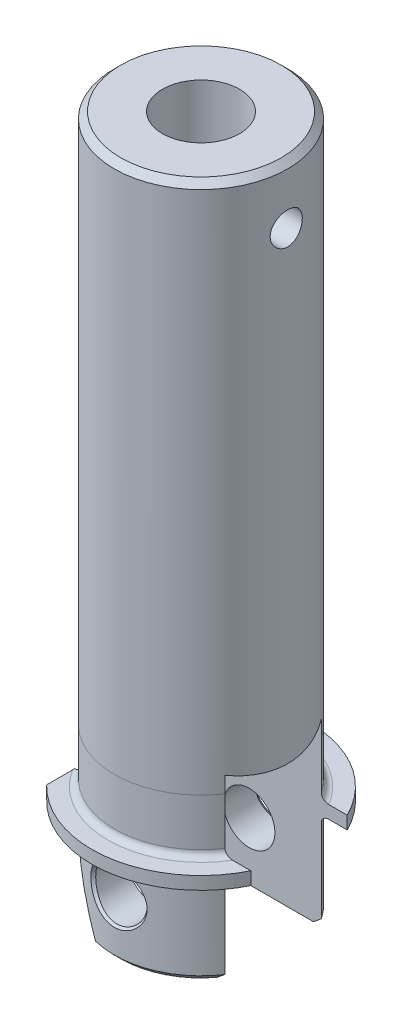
ISO-10303-21;
HEADER;
FILE_DESCRIPTION(('STEP AP214'),'2;1');
FILE_NAME('part.step','',(''),(''),'','','');
FILE_SCHEMA(('AUTOMOTIVE_DESIGN { 1 0 10303 214 1 1 1 1 }'));
ENDSEC;
DATA;
#1=APPLICATION_CONTEXT('core data for automotive mechanical design processes');
#2=APPLICATION_PROTOCOL_DEFINITION('international standard','automotive_design',2000,#1);
#3=PRODUCT_CONTEXT('',#1,'mechanical');
#4=PRODUCT('Part','Part','',(#3));
#5=PRODUCT_RELATED_PRODUCT_CATEGORY('part','',(#4));
#6=PRODUCT_DEFINITION_FORMATION('','',#4);
#7=PRODUCT_DEFINITION_CONTEXT('part definition',#1,'design');
#8=PRODUCT_DEFINITION('design','',#6,#7);
#9=PRODUCT_DEFINITION_SHAPE('','',#8);
#10=(LENGTH_UNIT() NAMED_UNIT(*) SI_UNIT(.MILLI.,.METRE.));
#11=(NAMED_UNIT(*) PLANE_ANGLE_UNIT() SI_UNIT($,.RADIAN.));
#12=(NAMED_UNIT(*) SI_UNIT($,.STERADIAN.) SOLID_ANGLE_UNIT());
#13=UNCERTAINTY_MEASURE_WITH_UNIT(LENGTH_MEASURE(1.E-05),#10,'distance_accuracy_value','');
#14=(GEOMETRIC_REPRESENTATION_CONTEXT(3) GLOBAL_UNCERTAINTY_ASSIGNED_CONTEXT((#13)) GLOBAL_UNIT_ASSIGNED_CONTEXT((#10,
#11,#12)) REPRESENTATION_CONTEXT('',''));
#15=CARTESIAN_POINT('',(0.,0.,0.));
#16=DIRECTION('',(0.,0.,1.));
#17=DIRECTION('',(1.,0.,0.));
#18=AXIS2_PLACEMENT_3D('',#15,#16,#17);
#19=CARTESIAN_POINT('',(0.,108.,0.));
#20=DIRECTION('',(0.,-1.,0.));
#21=DIRECTION('',(0.,0.,-1.));
#22=AXIS2_PLACEMENT_3D('',#19,#20,#21);
#23=CYLINDRICAL_SURFACE('',#22,13.5);
#24=CARTESIAN_POINT('',(13.2664991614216,99.,-2.5));
#25=CARTESIAN_POINT('',(13.2665018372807,98.8608718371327,-2.4999946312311));
#26=CARTESIAN_POINT('',(13.2687115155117,98.7216736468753,-2.48834661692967));
#27=CARTESIAN_POINT('',(13.2773008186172,98.4472000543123,-2.44209242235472));
#28=CARTESIAN_POINT('',(13.2836840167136,98.3119281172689,-2.40746656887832));
#29=CARTESIAN_POINT('',(13.2998731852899,98.0493182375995,-2.31635460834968));
#30=CARTESIAN_POINT('',(13.3096760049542,97.9219731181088,-2.25988861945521));
#31=CARTESIAN_POINT('',(13.3315961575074,97.6785722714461,-2.12675218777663));
#32=CARTESIAN_POINT('',(13.3437133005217,97.56251561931,-2.05008340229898));
#33=CARTESIAN_POINT('',(13.3690611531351,97.3435676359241,-1.87772532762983));
#34=CARTESIAN_POINT('',(13.3823025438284,97.240833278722,-1.78183817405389));
#35=CARTESIAN_POINT('',(13.4083125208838,97.0528133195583,-1.57419288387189));
#36=CARTESIAN_POINT('',(13.4210810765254,96.9675288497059,-1.46243371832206));
#37=CARTESIAN_POINT('',(13.4448209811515,96.8162294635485,-1.22518736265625));
#38=CARTESIAN_POINT('',(13.4557782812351,96.7503623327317,-1.09960439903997));
#39=CARTESIAN_POINT('',(13.4745416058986,96.6407192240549,-0.838918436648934));
#40=CARTESIAN_POINT('',(13.482347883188,96.5969414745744,-0.703816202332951));
#41=CARTESIAN_POINT('',(13.4938541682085,96.5332046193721,-0.429552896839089));
#42=CARTESIAN_POINT('',(13.4975997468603,96.5129809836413,-0.290455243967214));
#43=CARTESIAN_POINT('',(13.5007196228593,96.4961023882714,-0.0107941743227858));
#44=CARTESIAN_POINT('',(13.5000942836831,96.4994454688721,0.129769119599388));
#45=CARTESIAN_POINT('',(13.494578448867,96.5294021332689,0.406557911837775));
#46=CARTESIAN_POINT('',(13.489740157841,96.5557309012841,0.542815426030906));
#47=CARTESIAN_POINT('',(13.4764005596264,96.6304613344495,0.808944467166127));
#48=CARTESIAN_POINT('',(13.4678991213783,96.6788637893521,0.938815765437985));
#49=CARTESIAN_POINT('',(13.4481010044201,96.7966403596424,1.18931437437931));
#50=CARTESIAN_POINT('',(13.4367891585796,96.8661287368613,1.30988671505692));
#51=CARTESIAN_POINT('',(13.4126218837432,97.024020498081,1.53776612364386));
#52=CARTESIAN_POINT('',(13.3997663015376,97.1124257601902,1.64507187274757));
#53=CARTESIAN_POINT('',(13.3737091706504,97.3072124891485,1.84505906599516));
#54=CARTESIAN_POINT('',(13.3605053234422,97.4138431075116,1.93749770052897));
#55=CARTESIAN_POINT('',(13.3354239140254,97.6412226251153,2.10321537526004));
#56=CARTESIAN_POINT('',(13.3235463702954,97.7619717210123,2.17649414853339));
#57=CARTESIAN_POINT('',(13.3024592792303,98.0144777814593,2.30187868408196));
#58=CARTESIAN_POINT('',(13.2932540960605,98.1462523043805,2.35394986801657));
#59=CARTESIAN_POINT('',(13.2786213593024,98.4168882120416,2.43514553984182));
#60=CARTESIAN_POINT('',(13.2731933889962,98.5557488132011,2.46427255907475));
#61=CARTESIAN_POINT('',(13.2668118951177,98.834427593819,2.49840005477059));
#62=CARTESIAN_POINT('',(13.2657937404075,98.9742016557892,2.5037490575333));
#63=CARTESIAN_POINT('',(13.2681742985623,99.2526459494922,2.49110230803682));
#64=CARTESIAN_POINT('',(13.2715727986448,99.3913162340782,2.47310768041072));
#65=CARTESIAN_POINT('',(13.2823435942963,99.6624753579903,2.41458343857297));
#66=CARTESIAN_POINT('',(13.2896837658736,99.795004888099,2.37423591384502));
#67=CARTESIAN_POINT('',(13.3074832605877,100.051422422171,2.2723441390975));
#68=CARTESIAN_POINT('',(13.3179428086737,100.175309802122,2.21079836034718));
#69=CARTESIAN_POINT('',(13.3409500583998,100.412463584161,2.06745260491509));
#70=CARTESIAN_POINT('',(13.3535199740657,100.52559448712,1.9854320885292));
#71=CARTESIAN_POINT('',(13.3792688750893,100.736613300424,1.80376312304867));
#72=CARTESIAN_POINT('',(13.3924479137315,100.834499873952,1.70411312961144));
#73=CARTESIAN_POINT('',(13.4181374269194,101.013550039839,1.488458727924));
#74=CARTESIAN_POINT('',(13.430636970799,101.094479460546,1.3722583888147));
#75=CARTESIAN_POINT('',(13.4533762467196,101.235666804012,1.12770827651));
#76=CARTESIAN_POINT('',(13.4636160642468,101.295925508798,0.999358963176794));
#77=CARTESIAN_POINT('',(13.4806350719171,101.393708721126,0.734806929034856));
#78=CARTESIAN_POINT('',(13.4874318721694,101.431349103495,0.598648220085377));
#79=CARTESIAN_POINT('',(13.4968740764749,101.483197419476,0.321804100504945));
#80=CARTESIAN_POINT('',(13.4995199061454,101.497407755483,0.181119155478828));
#81=CARTESIAN_POINT('',(13.5003538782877,101.501910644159,-0.0985365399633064));
#82=CARTESIAN_POINT('',(13.4986079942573,101.492557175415,-0.237501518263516));
#83=CARTESIAN_POINT('',(13.4909915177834,101.450972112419,-0.511843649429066));
#84=CARTESIAN_POINT('',(13.4851209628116,101.418740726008,-0.647220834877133));
#85=CARTESIAN_POINT('',(13.4699143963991,101.332462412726,-0.910363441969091));
#86=CARTESIAN_POINT('',(13.4605842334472,101.278452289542,-1.0381412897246));
#87=CARTESIAN_POINT('',(13.4394694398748,101.150191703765,-1.28287408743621));
#88=CARTESIAN_POINT('',(13.4276846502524,101.075939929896,-1.39982833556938));
#89=CARTESIAN_POINT('',(13.4027537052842,100.908081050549,-1.62136026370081));
#90=CARTESIAN_POINT('',(13.3895908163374,100.814217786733,-1.72574198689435));
#91=CARTESIAN_POINT('',(13.3634939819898,100.61033272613,-1.91739591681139));
#92=CARTESIAN_POINT('',(13.3505600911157,100.500307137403,-2.00466409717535));
#93=CARTESIAN_POINT('',(13.3262587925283,100.266038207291,-2.16034911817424));
#94=CARTESIAN_POINT('',(13.3149065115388,100.141675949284,-2.22858944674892));
#95=CARTESIAN_POINT('',(13.2952353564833,99.8830833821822,-2.34310058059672));
#96=CARTESIAN_POINT('',(13.2869136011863,99.7488625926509,-2.38939226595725));
#97=CARTESIAN_POINT('',(13.2759939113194,99.5118583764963,-2.44920800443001));
#98=CARTESIAN_POINT('',(13.2724543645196,99.4104684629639,-2.46822260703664));
#99=CARTESIAN_POINT('',(13.2677060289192,99.2060651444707,-2.49362042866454));
#100=CARTESIAN_POINT('',(13.2664971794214,99.103051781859,-2.50000397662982));
#101=CARTESIAN_POINT('',(13.2664991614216,99.,-2.5));
#102=B_SPLINE_CURVE_WITH_KNOTS('',3,(#24,#25,#26,#27,#28,#29,#30,#31,#32,#33,#34,#35,#36,#37,
#38,#39,#40,#41,#42,#43,#44,#45,#46,#47,#48,#49,#50,#51,#52,#53,#54,#55,#56,#57,#58,#59,#60,#61,
#62,#63,#64,#65,#66,#67,#68,#69,#70,#71,#72,#73,#74,#75,#76,#77,#78,#79,#80,#81,#82,#83,#84,#85,
#86,#87,#88,#89,#90,#91,#92,#93,#94,#95,#96,#97,#98,#99,#100,#101),.UNSPECIFIED.,.T.,.F.,(4,2,2,
2,2,2,2,2,2,2,2,2,2,2,2,2,2,2,2,2,2,2,2,2,2,2,2,2,2,2,2,2,2,2,2,2,2,2,4),(0.,0.417007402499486,
0.834372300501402,1.25135365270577,1.66830080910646,2.08978427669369,2.51129508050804,
2.9359357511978,3.36054235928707,3.78033288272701,4.2000884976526,4.61471557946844,
5.02935749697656,5.44628769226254,5.86325930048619,6.28646915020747,6.7096848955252,
7.13358794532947,7.55744422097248,7.97506689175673,8.39266944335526,8.80691913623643,
9.22119870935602,9.64014923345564,10.0591364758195,10.4835755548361,10.9079985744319,
11.3302282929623,11.7524147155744,12.1682969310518,12.5841753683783,12.9993539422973,
13.4145594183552,13.8355714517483,14.256682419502,14.6815788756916,15.1060703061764,
15.4149543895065,15.7238304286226),.UNSPECIFIED.);
#103=CARTESIAN_POINT('',(13.2664991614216,99.,-2.5));
#104=VERTEX_POINT('',#103);
#105=EDGE_CURVE('E572',#104,#104,#102,.T.);
#106=ORIENTED_EDGE('',*,*,#105,.T.);
#107=EDGE_LOOP('',(#106));
#108=FACE_BOUND('',#107,.T.);
#109=CARTESIAN_POINT('',(0.,107.,0.));
#110=DIRECTION('',(0.,1.,0.));
#111=DIRECTION('',(0.,0.,1.));
#112=AXIS2_PLACEMENT_3D('',#109,#110,#111);
#113=CIRCLE('',#112,13.5);
#114=CARTESIAN_POINT('',(0.,107.,13.5));
#115=VERTEX_POINT('',#114);
#116=EDGE_CURVE('E247',#115,#115,#113,.F.);
#117=ORIENTED_EDGE('',*,*,#116,.T.);
#118=EDGE_LOOP('',(#117));
#119=FACE_BOUND('',#118,.T.);
#120=CARTESIAN_POINT('',(0.,25.3571245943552,0.));
#121=DIRECTION('',(0.,-1.,0.));
#122=DIRECTION('',(0.,0.,-1.));
#123=AXIS2_PLACEMENT_3D('',#120,#121,#122);
#124=CIRCLE('',#123,13.5);
#125=CARTESIAN_POINT('',(11.2249721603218,25.3571245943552,7.5));
#126=VERTEX_POINT('',#125);
#127=CARTESIAN_POINT('',(-11.2249721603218,25.3571245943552,7.5));
#128=VERTEX_POINT('',#127);
#129=EDGE_CURVE('E13',#126,#128,#124,.T.);
#130=ORIENTED_EDGE('',*,*,#129,.F.);
#131=DIRECTION('',(0.,-1.,0.));
#132=VECTOR('',#131,1.);
#133=CARTESIAN_POINT('',(11.2249721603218,108.,7.5));
#134=LINE('',#133,#132);
#135=CARTESIAN_POINT('',(11.2249721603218,27.86704708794,7.5));
#136=VERTEX_POINT('',#135);
#137=EDGE_CURVE('E421',#126,#136,#134,.F.);
#138=ORIENTED_EDGE('',*,*,#137,.T.);
#139=CARTESIAN_POINT('',(0.,33.1013375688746,0.));
#140=DIRECTION('',(-0.422618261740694,-0.906307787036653,0.));
#141=DIRECTION('',(0.906307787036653,-0.422618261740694,0.));
#142=AXIS2_PLACEMENT_3D('',#139,#140,#141);
#143=ELLIPSE('',#142,14.8956019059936,13.5);
#144=CARTESIAN_POINT('',(11.2249721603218,27.86704708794,-7.5));
#145=VERTEX_POINT('',#144);
#146=EDGE_CURVE('E452',#145,#136,#143,.T.);
#147=ORIENTED_EDGE('',*,*,#146,.F.);
#148=DIRECTION('',(0.,-1.,0.));
#149=VECTOR('',#148,1.);
#150=CARTESIAN_POINT('',(11.2249721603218,108.,-7.5));
#151=LINE('',#150,#149);
#152=CARTESIAN_POINT('',(11.2249721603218,25.3571245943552,-7.5));
#153=VERTEX_POINT('',#152);
#154=EDGE_CURVE('E316',#153,#145,#151,.F.);
#155=ORIENTED_EDGE('',*,*,#154,.F.);
#156=CARTESIAN_POINT('',(-11.2249721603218,25.3571245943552,-7.5));
#157=VERTEX_POINT('',#156);
#158=EDGE_CURVE('E53',#157,#153,#124,.T.);
#159=ORIENTED_EDGE('',*,*,#158,.F.);
#160=DIRECTION('',(0.,-1.,0.));
#161=VECTOR('',#160,1.);
#162=CARTESIAN_POINT('',(-11.2249721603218,108.,-7.5));
#163=LINE('',#162,#161);
#164=CARTESIAN_POINT('',(-11.2249721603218,38.3356280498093,-7.5));
#165=VERTEX_POINT('',#164);
#166=EDGE_CURVE('E691',#165,#157,#163,.T.);
#167=ORIENTED_EDGE('',*,*,#166,.F.);
#168=CARTESIAN_POINT('',(-11.2249721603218,38.3356280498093,7.5));
#169=VERTEX_POINT('',#168);
#170=EDGE_CURVE('E453',#169,#165,#143,.T.);
#171=ORIENTED_EDGE('',*,*,#170,.F.);
#172=DIRECTION('',(0.,-1.,0.));
#173=VECTOR('',#172,1.);
#174=CARTESIAN_POINT('',(-11.2249721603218,108.,7.5));
#175=LINE('',#174,#173);
#176=EDGE_CURVE('E432',#169,#128,#175,.T.);
#177=ORIENTED_EDGE('',*,*,#176,.T.);
#178=EDGE_LOOP('',(#130,#138,#147,#155,#159,#167,#171,#177));
#179=FACE_BOUND('',#178,.T.);
#180=ADVANCED_FACE('F46',(#108,#119,#179),#23,.T.);
#181=CARTESIAN_POINT('',(11.2249721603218,18.,7.5));
#182=VERTEX_POINT('',#181);
#183=EDGE_CURVE('E423',#182,#126,#134,.F.);
#184=ORIENTED_EDGE('',*,*,#183,.T.);
#185=ORIENTED_EDGE('',*,*,#129,.T.);
#186=CARTESIAN_POINT('',(-11.2249721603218,18.,7.5));
#187=VERTEX_POINT('',#186);
#188=EDGE_CURVE('E430',#128,#187,#175,.T.);
#189=ORIENTED_EDGE('',*,*,#188,.T.);
#190=CARTESIAN_POINT('',(0.,18.,0.));
#191=DIRECTION('',(0.,1.,0.));
#192=DIRECTION('',(0.,0.,1.));
#193=AXIS2_PLACEMENT_3D('',#190,#191,#192);
#194=CIRCLE('',#193,13.5);
#195=EDGE_CURVE('E260',#187,#182,#194,.T.);
#196=ORIENTED_EDGE('',*,*,#195,.T.);
#197=EDGE_LOOP('',(#184,#185,#189,#196));
#198=FACE_BOUND('',#197,.T.);
#199=ADVANCED_FACE('F609',(#198),#23,.T.);
#200=CARTESIAN_POINT('',(2.2861035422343,17.,0.));
#201=DIRECTION('',(0.,1.,0.));
#202=DIRECTION('',(0.,0.,1.));
#203=AXIS2_PLACEMENT_3D('',#200,#201,#202);
#204=PLANE('',#203);
#205=DIRECTION('',(0.,0.,-1.));
#206=VECTOR('',#205,1.);
#207=CARTESIAN_POINT('',(-12.2249721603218,17.,17.));
#208=LINE('',#207,#206);
#209=CARTESIAN_POINT('',(-12.2249721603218,17.,-7.79743904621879));
#210=VERTEX_POINT('',#209);
#211=CARTESIAN_POINT('',(-12.2249721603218,17.,-11.8131306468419));
#212=VERTEX_POINT('',#211);
#213=EDGE_CURVE('E230',#210,#212,#208,.T.);
#214=ORIENTED_EDGE('',*,*,#213,.F.);
#215=CARTESIAN_POINT('',(0.,17.,0.));
#216=DIRECTION('',(0.,1.,0.));
#217=DIRECTION('',(0.,0.,1.));
#218=AXIS2_PLACEMENT_3D('',#215,#216,#217);
#219=CIRCLE('',#218,14.5);
#220=CARTESIAN_POINT('',(12.4096736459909,17.,-7.5));
#221=VERTEX_POINT('',#220);
#222=EDGE_CURVE('E265',#210,#221,#219,.F.);
#223=ORIENTED_EDGE('',*,*,#222,.T.);
#224=DIRECTION('',(1.,0.,0.));
#225=VECTOR('',#224,1.);
#226=CARTESIAN_POINT('',(2.2861035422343,17.,-7.5));
#227=LINE('',#226,#225);
#228=CARTESIAN_POINT('',(15.2561463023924,17.,-7.5));
#229=VERTEX_POINT('',#228);
#230=EDGE_CURVE('E317',#221,#229,#227,.T.);
#231=ORIENTED_EDGE('',*,*,#230,.T.);
#232=CARTESIAN_POINT('',(0.,17.,0.));
#233=DIRECTION('',(0.,-1.,0.));
#234=DIRECTION('',(0.,0.,-1.));
#235=AXIS2_PLACEMENT_3D('',#232,#233,#234);
#236=CIRCLE('',#235,17.);
#237=EDGE_CURVE('E235',#212,#229,#236,.T.);
#238=ORIENTED_EDGE('',*,*,#237,.F.);
#239=EDGE_LOOP('',(#214,#223,#231,#238));
#240=FACE_BOUND('',#239,.T.);
#241=ADVANCED_FACE('F614',(#240),#204,.T.);
#242=CARTESIAN_POINT('',(2.2861035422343,15.,0.));
#243=DIRECTION('',(0.,-1.,0.));
#244=DIRECTION('',(0.,0.,-1.));
#245=AXIS2_PLACEMENT_3D('',#242,#243,#244);
#246=PLANE('',#245);
#247=DIRECTION('',(0.,0.,1.));
#248=VECTOR('',#247,1.);
#249=CARTESIAN_POINT('',(-11.113214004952,15.,0.));
#250=LINE('',#249,#248);
#251=CARTESIAN_POINT('',(-11.113214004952,15.,-12.8645433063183));
#252=VERTEX_POINT('',#251);
#253=CARTESIAN_POINT('',(-11.113214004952,15.,-9.31377874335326));
#254=VERTEX_POINT('',#253);
#255=EDGE_CURVE('E649',#252,#254,#250,.T.);
#256=ORIENTED_EDGE('',*,*,#255,.F.);
#257=CARTESIAN_POINT('',(0.,15.,0.));
#258=DIRECTION('',(0.,-1.,0.));
#259=DIRECTION('',(0.,0.,-1.));
#260=AXIS2_PLACEMENT_3D('',#257,#258,#259);
#261=CIRCLE('',#260,17.);
#262=CARTESIAN_POINT('',(15.2561463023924,15.,-7.5));
#263=VERTEX_POINT('',#262);
#264=EDGE_CURVE('E242',#252,#263,#261,.T.);
#265=ORIENTED_EDGE('',*,*,#264,.T.);
#266=DIRECTION('',(-1.,0.,0.));
#267=VECTOR('',#266,1.);
#268=CARTESIAN_POINT('',(2.2861035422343,15.,-7.5));
#269=LINE('',#268,#267);
#270=CARTESIAN_POINT('',(12.4096736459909,15.,-7.5));
#271=VERTEX_POINT('',#270);
#272=EDGE_CURVE('E667',#263,#271,#269,.T.);
#273=ORIENTED_EDGE('',*,*,#272,.T.);
#274=CARTESIAN_POINT('',(0.,15.,0.));
#275=DIRECTION('',(0.,-1.,0.));
#276=DIRECTION('',(0.,0.,-1.));
#277=AXIS2_PLACEMENT_3D('',#274,#275,#276);
#278=CIRCLE('',#277,14.5);
#279=EDGE_CURVE('E269',#271,#254,#278,.F.);
#280=ORIENTED_EDGE('',*,*,#279,.T.);
#281=EDGE_LOOP('',(#256,#265,#273,#280));
#282=FACE_BOUND('',#281,.T.);
#283=ADVANCED_FACE('F787',(#282),#246,.T.);
#284=CARTESIAN_POINT('',(0.,0.,0.));
#285=DIRECTION('',(0.,-1.,0.));
#286=DIRECTION('',(0.,0.,-1.));
#287=AXIS2_PLACEMENT_3D('',#284,#285,#286);
#288=CYLINDRICAL_SURFACE('',#287,17.);
#289=CARTESIAN_POINT('',(0.,-4.99214298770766,0.));
#290=DIRECTION('',(0.874037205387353,0.485858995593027,0.));
#291=DIRECTION('',(0.485858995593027,-0.874037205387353,0.));
#292=AXIS2_PLACEMENT_3D('',#289,#290,#291);
#293=ELLIPSE('',#292,34.9895754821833,17.);
#294=EDGE_CURVE('E464',#212,#252,#293,.F.);
#295=ORIENTED_EDGE('',*,*,#294,.F.);
#296=ORIENTED_EDGE('',*,*,#237,.T.);
#297=DIRECTION('',(0.,-1.,0.));
#298=VECTOR('',#297,1.);
#299=CARTESIAN_POINT('',(15.2561463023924,0.,-7.5));
#300=LINE('',#299,#298);
#301=EDGE_CURVE('E670',#229,#263,#300,.T.);
#302=ORIENTED_EDGE('',*,*,#301,.T.);
#303=ORIENTED_EDGE('',*,*,#264,.F.);
#304=EDGE_LOOP('',(#295,#296,#302,#303));
#305=FACE_BOUND('',#304,.T.);
#306=ADVANCED_FACE('F605',(#305),#288,.T.);
#307=CARTESIAN_POINT('',(0.,0.,0.));
#308=DIRECTION('',(0.,1.,0.));
#309=DIRECTION('',(0.,0.,1.));
#310=AXIS2_PLACEMENT_3D('',#307,#308,#309);
#311=PLANE('',#310);
#312=DIRECTION('',(1.,0.,0.));
#313=VECTOR('',#312,1.);
#314=CARTESIAN_POINT('',(0.,0.,-7.5));
#315=LINE('',#314,#313);
#316=CARTESIAN_POINT('',(-2.77502783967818,0.,-7.5));
#317=VERTEX_POINT('',#316);
#318=CARTESIAN_POINT('',(10.,0.,-7.5));
#319=VERTEX_POINT('',#318);
#320=EDGE_CURVE('E665',#317,#319,#315,.T.);
#321=ORIENTED_EDGE('',*,*,#320,.F.);
#322=DIRECTION('',(0.,0.,-1.));
#323=VECTOR('',#322,1.);
#324=CARTESIAN_POINT('',(-2.77502783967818,0.,17.));
#325=LINE('',#324,#323);
#326=CARTESIAN_POINT('',(-2.77502783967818,0.,-12.1880769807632));
#327=VERTEX_POINT('',#326);
#328=EDGE_CURVE('E227',#317,#327,#325,.T.);
#329=ORIENTED_EDGE('',*,*,#328,.T.);
#330=CARTESIAN_POINT('',(0.,0.,0.));
#331=DIRECTION('',(0.,1.,0.));
#332=DIRECTION('',(0.,0.,1.));
#333=AXIS2_PLACEMENT_3D('',#330,#331,#332);
#334=CIRCLE('',#333,12.5);
#335=EDGE_CURVE('E256',#327,#319,#334,.F.);
#336=ORIENTED_EDGE('',*,*,#335,.T.);
#337=EDGE_LOOP('',(#321,#329,#336));
#338=FACE_BOUND('',#337,.T.);
#339=ADVANCED_FACE('F600',(#338),#311,.F.);
#340=CARTESIAN_POINT('',(0.,1.,0.));
#341=DIRECTION('',(0.,1.,0.));
#342=DIRECTION('',(0.,0.,1.));
#343=AXIS2_PLACEMENT_3D('',#340,#341,#342);
#344=CONICAL_SURFACE('',#343,13.5,0.785398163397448);
#345=CARTESIAN_POINT('',(-7.0407223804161,7.673781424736,-18.9052819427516));
#346=CARTESIAN_POINT('',(-6.70364212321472,7.06739008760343,-18.3836769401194));
#347=CARTESIAN_POINT('',(-6.36686511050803,6.46154427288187,-17.8612364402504));
#348=CARTESIAN_POINT('',(-5.69419144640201,5.25143637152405,-16.8140265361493));
#349=CARTESIAN_POINT('',(-5.35829475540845,4.64717421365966,-16.2892572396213));
#350=CARTESIAN_POINT('',(-4.68779532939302,3.4409776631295,-15.2369519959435));
#351=CARTESIAN_POINT('',(-4.3531920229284,2.83904224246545,-14.7094175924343));
#352=CARTESIAN_POINT('',(-3.68549782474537,1.63789216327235,-13.6502214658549));
#353=CARTESIAN_POINT('',(-3.35240701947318,1.03867766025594,-13.1185595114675));
#354=CARTESIAN_POINT('',(-2.85429299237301,0.142594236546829,-12.3165711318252));
#355=CARTESIAN_POINT('',(-2.68845129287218,-0.155747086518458,-12.0483984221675));
#356=CARTESIAN_POINT('',(-2.35743630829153,-0.751227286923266,-11.5103133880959));
#357=CARTESIAN_POINT('',(-2.19226301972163,-1.04836617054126,-11.2404010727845));
#358=CARTESIAN_POINT('',(-1.86275848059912,-1.64112915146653,-10.6985008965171));
#359=CARTESIAN_POINT('',(-1.69842711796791,-1.93675345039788,-10.4265133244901));
#360=CARTESIAN_POINT('',(-1.37078491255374,-2.52616618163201,-9.87992918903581));
#361=CARTESIAN_POINT('',(-1.20747409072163,-2.81995457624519,-9.60533257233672));
#362=CARTESIAN_POINT('',(-0.882051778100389,-3.40537382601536,-9.05269988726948));
#363=CARTESIAN_POINT('',(-0.719941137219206,-3.69700315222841,-8.77466169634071));
#364=CARTESIAN_POINT('',(-0.397428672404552,-4.27718772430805,-8.21444249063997));
#365=CARTESIAN_POINT('',(-0.237026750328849,-4.56574314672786,-7.93226171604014));
#366=CARTESIAN_POINT('',(0.00189479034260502,-4.99555162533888,-7.50485316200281));
#367=CARTESIAN_POINT('',(0.0812736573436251,-5.13835042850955,-7.36165971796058));
#368=CARTESIAN_POINT('',(0.239353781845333,-5.4227290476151,-7.07370047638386));
#369=CARTESIAN_POINT('',(0.318055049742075,-5.564308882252,-6.92893470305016));
#370=CARTESIAN_POINT('',(0.474674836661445,-5.84606042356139,-6.6375549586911));
#371=CARTESIAN_POINT('',(0.552593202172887,-5.98623185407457,-6.49094063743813));
#372=CARTESIAN_POINT('',(0.707468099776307,-6.26484442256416,-6.19556012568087));
#373=CARTESIAN_POINT('',(0.784424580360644,-6.40328546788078,-6.0467938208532));
#374=CARTESIAN_POINT('',(0.860814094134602,-6.54070656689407,-5.89679381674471));
#375=B_SPLINE_CURVE_WITH_KNOTS('',3,(#345,#346,#347,#348,#349,#350,#351,#352,#353,#354,#355,
#356,#357,#358,#359,#360,#361,#362,#363,#364,#365,#366,#367,#368,#369,#370,#371,#372,#373,#374),
.UNSPECIFIED.,.F.,.F.,(4,2,2,2,2,2,2,2,2,2,2,2,2,2,4),(0.,2.60397205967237,5.20782491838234,
7.81035284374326,10.4130276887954,11.7152708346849,13.0175071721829,14.3195653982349,
15.62165026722,16.9245827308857,18.227439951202,18.8791769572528,19.5309039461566,
20.1827563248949,20.8346434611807),.UNSPECIFIED.);
#376=CARTESIAN_POINT('',(-3.3309069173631,1.,-13.0826243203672));
#377=VERTEX_POINT('',#376);
#378=EDGE_CURVE('E646',#377,#327,#375,.T.);
#379=ORIENTED_EDGE('',*,*,#378,.F.);
#380=CARTESIAN_POINT('',(0.,1.,0.));
#381=DIRECTION('',(0.,1.,0.));
#382=DIRECTION('',(0.,0.,1.));
#383=AXIS2_PLACEMENT_3D('',#380,#381,#382);
#384=CIRCLE('',#383,13.5);
#385=CARTESIAN_POINT('',(11.2249721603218,1.,-7.5));
#386=VERTEX_POINT('',#385);
#387=EDGE_CURVE('E252',#386,#377,#384,.T.);
#388=ORIENTED_EDGE('',*,*,#387,.F.);
#389=CARTESIAN_POINT('',(81.181232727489,69.0269436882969,-7.5));
#390=CARTESIAN_POINT('',(79.8057344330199,67.6572809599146,-7.5));
#391=CARTESIAN_POINT('',(78.4300918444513,66.2877631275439,-7.5));
#392=CARTESIAN_POINT('',(75.6784612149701,63.5490739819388,-7.5));
#393=CARTESIAN_POINT('',(74.3024731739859,62.1799026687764,-7.5));
#394=CARTESIAN_POINT('',(70.1736845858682,58.0727737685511,-7.5));
#395=CARTESIAN_POINT('',(67.4202812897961,55.3354220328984,-7.5));
#396=CARTESIAN_POINT('',(61.9062433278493,49.8580876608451,-7.5));
#397=CARTESIAN_POINT('',(59.1456045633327,47.1181091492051,-7.5));
#398=CARTESIAN_POINT('',(55.0021655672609,43.0108591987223,-7.5));
#399=CARTESIAN_POINT('',(53.6206596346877,41.6422821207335,-7.5));
#400=CARTESIAN_POINT('',(50.8565584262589,38.9062332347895,-7.5));
#401=CARTESIAN_POINT('',(49.4739631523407,37.5387614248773,-7.5));
#402=CARTESIAN_POINT('',(46.640610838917,34.7392485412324,-7.5));
#403=CARTESIAN_POINT('',(45.1897851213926,33.3072769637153,-7.5));
#404=CARTESIAN_POINT('',(42.2861085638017,30.4453679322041,-7.5));
#405=CARTESIAN_POINT('',(40.8332577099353,29.0154304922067,-7.5));
#406=CARTESIAN_POINT('',(37.9244604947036,26.1579951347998,-7.5));
#407=CARTESIAN_POINT('',(36.4685134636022,24.7304978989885,-7.5));
#408=CARTESIAN_POINT('',(33.552814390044,21.8794619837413,-7.5));
#409=CARTESIAN_POINT('',(32.0930624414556,20.4559232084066,-7.5));
#410=CARTESIAN_POINT('',(29.9000231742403,18.3258264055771,-7.5));
#411=CARTESIAN_POINT('',(29.1688679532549,17.617073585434,-7.5));
#412=CARTESIAN_POINT('',(27.7047873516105,16.2013985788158,-7.5));
#413=CARTESIAN_POINT('',(26.9718619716,15.4944763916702,-7.5));
#414=CARTESIAN_POINT('',(25.5037197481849,14.0828694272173,-7.5));
#415=CARTESIAN_POINT('',(24.7685026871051,13.3781848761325,-7.5));
#416=CARTESIAN_POINT('',(23.6635415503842,12.3234004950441,-7.5));
#417=CARTESIAN_POINT('',(23.2948665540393,11.9721806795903,-7.5));
#418=CARTESIAN_POINT('',(22.5566970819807,11.2706000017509,-7.5));
#419=CARTESIAN_POINT('',(22.1872026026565,10.9202391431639,-7.5));
#420=CARTESIAN_POINT('',(21.0776395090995,9.87093809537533,-7.5));
#421=CARTESIAN_POINT('',(20.3361725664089,9.17347483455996,-7.5));
#422=CARTESIAN_POINT('',(18.848258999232,7.78388062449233,-7.5));
#423=CARTESIAN_POINT('',(18.1018124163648,7.0917496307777,-7.5));
#424=CARTESIAN_POINT('',(16.9769958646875,6.0592690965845,-7.5));
#425=CARTESIAN_POINT('',(16.6012267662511,5.71608634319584,-7.5));
#426=CARTESIAN_POINT('',(15.8476066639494,5.03201557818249,-7.5));
#427=CARTESIAN_POINT('',(15.4697556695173,4.69112755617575,-7.5));
#428=CARTESIAN_POINT('',(14.7115625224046,4.01216557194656,-7.5));
#429=CARTESIAN_POINT('',(14.331220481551,3.67409148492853,-7.5));
#430=CARTESIAN_POINT('',(13.5674824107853,3.00141361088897,-7.5));
#431=CARTESIAN_POINT('',(13.1840864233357,2.66680977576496,-7.5));
#432=CARTESIAN_POINT('',(12.682881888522,2.23438424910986,-7.5));
#433=CARTESIAN_POINT('',(12.5667908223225,2.13456988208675,-7.5));
#434=CARTESIAN_POINT('',(12.3342406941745,1.93536941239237,-7.5));
#435=CARTESIAN_POINT('',(12.2177816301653,1.83598331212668,-7.5));
#436=CARTESIAN_POINT('',(11.8678130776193,1.53851374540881,-7.5));
#437=CARTESIAN_POINT('',(11.6337150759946,1.34112147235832,-7.5));
#438=CARTESIAN_POINT('',(11.1636909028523,0.948468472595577,-7.5));
#439=CARTESIAN_POINT('',(10.9277645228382,0.753207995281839,-7.5));
#440=CARTESIAN_POINT('',(10.4538313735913,0.365226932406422,-7.5));
#441=CARTESIAN_POINT('',(10.2158246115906,0.172506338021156,-7.5));
#442=CARTESIAN_POINT('',(9.73744064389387,-0.209878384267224,-7.5));
#443=CARTESIAN_POINT('',(9.49706390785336,-0.399543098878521,-7.5));
#444=CARTESIAN_POINT('',(9.01349334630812,-0.775244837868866,-7.5));
#445=CARTESIAN_POINT('',(8.77029956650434,-0.961281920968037,-7.5));
#446=CARTESIAN_POINT('',(8.28063732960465,-1.32893056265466,-7.5));
#447=CARTESIAN_POINT('',(8.03416936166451,-1.51054277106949,-7.5));
#448=CARTESIAN_POINT('',(7.53734484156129,-1.868355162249,-7.5));
#449=CARTESIAN_POINT('',(7.28698847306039,-2.04455559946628,-7.5));
#450=CARTESIAN_POINT('',(6.73503202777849,-2.42215743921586,-7.5));
#451=CARTESIAN_POINT('',(6.43250213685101,-2.62220813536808,-7.5));
#452=CARTESIAN_POINT('',(5.81952178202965,-3.00998119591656,-7.5));
#453=CARTESIAN_POINT('',(5.50907021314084,-3.19770182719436,-7.5));
#454=CARTESIAN_POINT('',(4.87871241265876,-3.55658558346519,-7.5));
#455=CARTESIAN_POINT('',(4.55880759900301,-3.72775117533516,-7.5));
#456=CARTESIAN_POINT('',(3.90790567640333,-4.04769560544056,-7.5));
#457=CARTESIAN_POINT('',(3.57691215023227,-4.19648159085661,-7.5));
#458=CARTESIAN_POINT('',(2.98136550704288,-4.43263758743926,-7.5));
#459=CARTESIAN_POINT('',(2.71930568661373,-4.52623966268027,-7.5));
#460=CARTESIAN_POINT('',(2.18823799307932,-4.69136555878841,-7.5));
#461=CARTESIAN_POINT('',(1.9192311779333,-4.76289272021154,-7.5));
#462=CARTESIAN_POINT('',(1.37678156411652,-4.8792526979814,-7.5));
#463=CARTESIAN_POINT('',(1.10336712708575,-4.92421521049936,-7.5));
#464=CARTESIAN_POINT('',(0.553287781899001,-4.98457856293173,-7.5));
#465=CARTESIAN_POINT('',(0.276623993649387,-4.99998930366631,-7.5));
#466=CARTESIAN_POINT('',(-0.228045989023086,-5.00000881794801,-7.5));
#467=CARTESIAN_POINT('',(-0.456064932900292,-4.98955148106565,-7.5));
#468=CARTESIAN_POINT('',(-0.910238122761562,-4.94835092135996,-7.5));
#469=CARTESIAN_POINT('',(-1.13639243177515,-4.91760838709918,-7.5));
#470=CARTESIAN_POINT('',(-1.58587976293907,-4.83736733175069,-7.5));
#471=CARTESIAN_POINT('',(-1.80920431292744,-4.78782208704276,-7.5));
#472=CARTESIAN_POINT('',(-2.25151062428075,-4.6722485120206,-7.5));
#473=CARTESIAN_POINT('',(-2.47049199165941,-4.60621869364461,-7.5));
#474=CARTESIAN_POINT('',(-2.9229740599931,-4.4536075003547,-7.5));
#475=CARTESIAN_POINT('',(-3.15603002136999,-4.36571919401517,-7.5));
#476=CARTESIAN_POINT('',(-3.61654195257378,-4.17622104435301,-7.5));
#477=CARTESIAN_POINT('',(-3.84399562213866,-4.07460567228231,-7.5));
#478=CARTESIAN_POINT('',(-4.29390136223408,-3.86006786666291,-7.5));
#479=CARTESIAN_POINT('',(-4.51634507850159,-3.74712804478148,-7.5));
#480=CARTESIAN_POINT('',(-4.95633440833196,-3.51219393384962,-7.5));
#481=CARTESIAN_POINT('',(-5.17388059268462,-3.39020070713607,-7.5));
#482=CARTESIAN_POINT('',(-5.6064675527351,-3.13776897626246,-7.5));
#483=CARTESIAN_POINT('',(-5.8214715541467,-3.00726774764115,-7.5));
#484=CARTESIAN_POINT('',(-6.24762044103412,-2.7401225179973,-7.5));
#485=CARTESIAN_POINT('',(-6.45876524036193,-2.60347838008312,-7.5));
#486=CARTESIAN_POINT('',(-6.8774824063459,-2.32526104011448,-7.5));
#487=CARTESIAN_POINT('',(-7.08505798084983,-2.18369265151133,-7.5));
#488=CARTESIAN_POINT('',(-7.49726624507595,-1.8963604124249,-7.5));
#489=CARTESIAN_POINT('',(-7.70189904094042,-1.75059671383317,-7.5));
#490=CARTESIAN_POINT('',(-8.12720205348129,-1.44205875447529,-7.5));
#491=CARTESIAN_POINT('',(-8.34762767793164,-1.27894784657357,-7.5));
#492=CARTESIAN_POINT('',(-8.78584938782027,-0.949226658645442,-7.5));
#493=CARTESIAN_POINT('',(-9.00364539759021,-0.782616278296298,-7.5));
#494=CARTESIAN_POINT('',(-9.65368062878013,-0.278360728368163,-7.5));
#495=CARTESIAN_POINT('',(-10.0825168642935,0.0636720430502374,-7.5));
#496=CARTESIAN_POINT('',(-10.9335080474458,0.756345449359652,-7.5));
#497=CARTESIAN_POINT('',(-11.3556594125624,1.1069904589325,-7.5));
#498=CARTESIAN_POINT('',(-12.1945913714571,1.81458385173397,-7.5));
#499=CARTESIAN_POINT('',(-12.6113722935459,2.17153184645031,-7.5));
#500=CARTESIAN_POINT('',(-13.441466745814,2.89091020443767,-7.5));
#501=CARTESIAN_POINT('',(-13.8547727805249,3.25334919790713,-7.5));
#502=CARTESIAN_POINT('',(-14.6780177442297,3.98203718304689,-7.5));
#503=CARTESIAN_POINT('',(-15.0879566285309,4.34828622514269,-7.5));
#504=CARTESIAN_POINT('',(-15.9049806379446,5.08370704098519,-7.5));
#505=CARTESIAN_POINT('',(-16.3120665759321,5.45287791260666,-7.5));
#506=CARTESIAN_POINT('',(-17.1239948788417,6.19367998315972,-7.5));
#507=CARTESIAN_POINT('',(-17.5288372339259,6.56531119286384,-7.5));
#508=CARTESIAN_POINT('',(-18.737602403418,7.68045561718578,-7.5));
#509=CARTESIAN_POINT('',(-19.5387781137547,8.42694612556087,-7.5));
#510=CARTESIAN_POINT('',(-21.1359801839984,9.92551588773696,-7.5));
#511=CARTESIAN_POINT('',(-21.9320061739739,10.6775955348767,-7.5));
#512=CARTESIAN_POINT('',(-23.5193861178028,12.1850105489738,-7.5));
#513=CARTESIAN_POINT('',(-24.3107440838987,12.9403416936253,-7.5));
#514=CARTESIAN_POINT('',(-25.8905372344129,14.4540153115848,-7.5));
#515=CARTESIAN_POINT('',(-26.6789724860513,15.2123577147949,-7.5));
#516=CARTESIAN_POINT('',(-28.5986420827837,17.0642188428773,-7.5));
#517=CARTESIAN_POINT('',(-29.7286786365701,18.158978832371,-7.5));
#518=CARTESIAN_POINT('',(-31.9854413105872,20.3519068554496,-7.5));
#519=CARTESIAN_POINT('',(-33.1121674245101,21.45007489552,-7.5));
#520=CARTESIAN_POINT('',(-35.3631742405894,23.6489437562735,-7.5));
#521=CARTESIAN_POINT('',(-36.4874549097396,24.7496446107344,-7.5));
#522=CARTESIAN_POINT('',(-38.7341438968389,26.9529559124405,-7.5));
#523=CARTESIAN_POINT('',(-39.8565522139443,28.0555663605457,-7.5));
#524=CARTESIAN_POINT('',(-42.1004373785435,30.2627878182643,-7.5));
#525=CARTESIAN_POINT('',(-43.2219135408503,31.3673995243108,-7.5));
#526=CARTESIAN_POINT('',(-45.46370515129,33.5778002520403,-7.5));
#527=CARTESIAN_POINT('',(-46.5840205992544,34.6835892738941,-7.5));
#528=CARTESIAN_POINT('',(-49.9435618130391,38.0023521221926,-7.5));
#529=CARTESIAN_POINT('',(-52.1813957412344,40.2167348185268,-7.5));
#530=CARTESIAN_POINT('',(-56.6522320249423,44.6457179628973,-7.5));
#531=CARTESIAN_POINT('',(-58.8852369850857,46.8603157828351,-7.5));
#532=CARTESIAN_POINT('',(-63.3494686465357,51.2913113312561,-7.5));
#533=CARTESIAN_POINT('',(-65.58069534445,53.5077090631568,-7.5));
#534=CARTESIAN_POINT('',(-70.0407044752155,57.9406844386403,-7.5));
#535=CARTESIAN_POINT('',(-72.2694875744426,60.15726141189,-7.5));
#536=CARTESIAN_POINT('',(-76.7260427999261,64.591421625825,-7.5));
#537=CARTESIAN_POINT('',(-78.9538149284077,66.8090048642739,-7.5));
#538=CARTESIAN_POINT('',(-81.181232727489,69.0269436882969,-7.5));
#539=B_SPLINE_CURVE_WITH_KNOTS('',3,(#389,#390,#391,#392,#393,#394,#395,#396,#397,#398,#399,
#400,#401,#402,#403,#404,#405,#406,#407,#408,#409,#410,#411,#412,#413,#414,#415,#416,#417,#418,
#419,#420,#421,#422,#423,#424,#425,#426,#427,#428,#429,#430,#431,#432,#433,#434,#435,#436,#437,
#438,#439,#440,#441,#442,#443,#444,#445,#446,#447,#448,#449,#450,#451,#452,#453,#454,#455,#456,
#457,#458,#459,#460,#461,#462,#463,#464,#465,#466,#467,#468,#469,#470,#471,#472,#473,#474,#475,
#476,#477,#478,#479,#480,#481,#482,#483,#484,#485,#486,#487,#488,#489,#490,#491,#492,#493,#494,
#495,#496,#497,#498,#499,#500,#501,#502,#503,#504,#505,#506,#507,#508,#509,#510,#511,#512,#513,
#514,#515,#516,#517,#518,#519,#520,#521,#522,#523,#524,#525,#526,#527,#528,#529,#530,#531,#532,
#533,#534,#535,#536,#537,#538),.UNSPECIFIED.,.F.,.F.,(4,2,2,2,2,2,2,2,2,2,2,2,2,2,2,2,2,2,2,2,2,
2,2,2,2,2,2,2,2,2,2,2,2,2,2,2,2,2,2,2,2,2,2,2,2,2,2,2,2,2,2,2,2,2,2,2,2,2,2,2,2,2,2,2,2,2,2,2,2,
2,2,2,2,2,4),(0.,5.82337907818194,11.6467593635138,23.294458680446,34.963109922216,
40.7969809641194,46.6308416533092,52.7463075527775,58.8618153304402,64.9788176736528,
71.0956705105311,74.1505439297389,77.2054162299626,80.2605881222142,81.7881632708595,
83.3157451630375,86.3695864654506,89.4234022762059,90.9500880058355,92.4767668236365,
94.0033775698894,95.5299671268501,95.9892705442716,96.4485765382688,97.3671998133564,
98.2859294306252,99.2046558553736,100.123203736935,101.041736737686,101.960134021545,
102.878488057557,103.966333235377,105.054330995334,106.142166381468,107.229653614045,
108.063699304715,108.897618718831,109.72743231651,110.556967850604,111.24082845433,
111.924665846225,112.610213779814,113.295823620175,114.042520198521,114.789518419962,
115.537681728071,116.285757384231,117.040162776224,117.794584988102,118.548289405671,
119.30196656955,120.124562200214,120.94718144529,122.592606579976,124.23888555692,
125.885063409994,127.534172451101,129.183303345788,130.831943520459,132.480590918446,
135.765691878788,139.051026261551,142.332928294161,145.614754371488,150.334842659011,
155.054939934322,159.775100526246,164.495263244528,169.217643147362,173.94002373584,
183.384728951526,192.81959883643,202.254486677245,211.684554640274,221.114601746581),.UNSPECIFIED.);
#540=EDGE_CURVE('E303',#386,#319,#539,.T.);
#541=ORIENTED_EDGE('',*,*,#540,.T.);
#542=ORIENTED_EDGE('',*,*,#335,.F.);
#543=EDGE_LOOP('',(#379,#388,#541,#542));
#544=FACE_BOUND('',#543,.T.);
#545=ADVANCED_FACE('F397',(#544),#344,.T.);
#546=CARTESIAN_POINT('',(4.3769596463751,8.99999999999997,-12.7707566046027));
#547=CARTESIAN_POINT('',(4.37695435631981,8.92986507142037,-12.7707567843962));
#548=CARTESIAN_POINT('',(4.37508399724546,8.85973473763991,-12.7714466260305));
#549=CARTESIAN_POINT('',(4.3676818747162,8.71981850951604,-12.7741290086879));
#550=CARTESIAN_POINT('',(4.36215670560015,8.65003222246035,-12.7761192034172));
#551=CARTESIAN_POINT('',(4.34751985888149,8.51094852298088,-12.7813238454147));
#552=CARTESIAN_POINT('',(4.33841143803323,8.4416507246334,-12.7845371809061));
#553=CARTESIAN_POINT('',(4.31668603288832,8.30368484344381,-12.7921085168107));
#554=CARTESIAN_POINT('',(4.30406970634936,8.2350166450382,-12.7964663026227));
#555=CARTESIAN_POINT('',(4.27540465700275,8.09845145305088,-12.8062476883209));
#556=CARTESIAN_POINT('',(4.25935465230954,8.03055475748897,-12.8116716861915));
#557=CARTESIAN_POINT('',(4.22389803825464,7.89567372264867,-12.823506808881));
#558=CARTESIAN_POINT('',(4.20448877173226,7.8286901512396,-12.8299187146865));
#559=CARTESIAN_POINT('',(4.16238879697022,7.69577655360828,-12.8436512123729));
#560=CARTESIAN_POINT('',(4.13969452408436,7.6298477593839,-12.8509727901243));
#561=CARTESIAN_POINT('',(4.09109926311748,7.49918492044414,-12.8664463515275));
#562=CARTESIAN_POINT('',(4.06519417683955,7.4344525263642,-12.8745993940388));
#563=CARTESIAN_POINT('',(4.01025164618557,7.30632376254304,-12.8916577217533));
#564=CARTESIAN_POINT('',(3.98120985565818,7.24292939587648,-12.9005640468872));
#565=CARTESIAN_POINT('',(3.92006800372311,7.11761804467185,-12.9190508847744));
#566=CARTESIAN_POINT('',(3.88796355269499,7.05570334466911,-12.9286323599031));
#567=CARTESIAN_POINT('',(3.82077025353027,6.93349276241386,-12.9483913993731));
#568=CARTESIAN_POINT('',(3.78567710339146,6.87319938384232,-12.9585698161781));
#569=CARTESIAN_POINT('',(3.71258021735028,6.7543729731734,-12.9794450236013));
#570=CARTESIAN_POINT('',(3.67457233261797,6.69584262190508,-12.9901425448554));
#571=CARTESIAN_POINT('',(3.59571949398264,6.58068376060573,-13.0119769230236));
#572=CARTESIAN_POINT('',(3.55487055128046,6.52405809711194,-13.0231143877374));
#573=CARTESIAN_POINT('',(3.47040998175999,6.41285042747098,-13.0457545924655));
#574=CARTESIAN_POINT('',(3.42679448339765,6.35827146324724,-13.0572578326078));
#575=CARTESIAN_POINT('',(3.33687196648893,6.2512978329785,-13.0805368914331));
#576=CARTESIAN_POINT('',(3.29056110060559,6.1989064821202,-13.0923130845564));
#577=CARTESIAN_POINT('',(3.1953313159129,6.09645292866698,-13.1161150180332));
#578=CARTESIAN_POINT('',(3.14640846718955,6.0463944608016,-13.1281411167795));
#579=CARTESIAN_POINT('',(3.04600307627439,5.94874550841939,-13.1521566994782));
#580=CARTESIAN_POINT('',(2.99451681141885,5.90115883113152,-13.1641461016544));
#581=CARTESIAN_POINT('',(2.88910780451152,5.80852405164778,-13.1878114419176));
#582=CARTESIAN_POINT('',(2.83518170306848,5.76347965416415,-13.1994869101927));
#583=CARTESIAN_POINT('',(2.72505223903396,5.67600512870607,-13.222510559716));
#584=CARTESIAN_POINT('',(2.66884569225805,5.63357888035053,-13.2338582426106));
#585=CARTESIAN_POINT('',(2.55430218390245,5.55141245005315,-13.2561424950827));
#586=CARTESIAN_POINT('',(2.49596235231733,5.5116761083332,-13.2670784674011));
#587=CARTESIAN_POINT('',(2.37730224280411,5.43496261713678,-13.2884742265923));
#588=CARTESIAN_POINT('',(2.31697949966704,5.39798910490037,-13.2989333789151));
#589=CARTESIAN_POINT('',(2.19450258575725,5.32687426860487,-13.3193053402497));
#590=CARTESIAN_POINT('',(2.13234638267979,5.29273626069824,-13.3292175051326));
#591=CARTESIAN_POINT('',(2.00635178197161,5.22736563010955,-13.3484266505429));
#592=CARTESIAN_POINT('',(1.94251177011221,5.19613593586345,-13.3577230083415));
#593=CARTESIAN_POINT('',(1.8132987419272,5.13665517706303,-13.3756313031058));
#594=CARTESIAN_POINT('',(1.74792448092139,5.10840664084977,-13.3842426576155));
#595=CARTESIAN_POINT('',(1.61579221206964,5.05496146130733,-13.4007117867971));
#596=CARTESIAN_POINT('',(1.54903325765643,5.02976699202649,-13.4085690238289));
#597=CARTESIAN_POINT('',(1.41428092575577,4.98250316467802,-13.4234607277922));
#598=CARTESIAN_POINT('',(1.34628681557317,4.96043573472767,-13.4304946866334));
#599=CARTESIAN_POINT('',(1.20921357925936,4.91949908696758,-13.4436706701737));
#600=CARTESIAN_POINT('',(1.14013384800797,4.90063172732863,-13.4498121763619));
#601=CARTESIAN_POINT('',(1.00103885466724,4.86616817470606,-13.461134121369));
#602=CARTESIAN_POINT('',(0.931023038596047,4.85057401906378,-13.4663139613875));
#603=CARTESIAN_POINT('',(0.79020544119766,4.82272945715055,-13.4756435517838));
#604=CARTESIAN_POINT('',(0.719403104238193,4.81048159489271,-13.479792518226));
#605=CARTESIAN_POINT('',(0.577162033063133,4.78940231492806,-13.4869913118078));
#606=CARTESIAN_POINT('',(0.505722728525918,4.78057435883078,-13.490040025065));
#607=CARTESIAN_POINT('',(0.362357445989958,4.76640550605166,-13.4949699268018));
#608=CARTESIAN_POINT('',(0.290430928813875,4.76106948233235,-13.4968494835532));
#609=CARTESIAN_POINT('',(0.146240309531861,4.75396082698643,-13.4993709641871));
#610=CARTESIAN_POINT('',(0.0739758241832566,4.75219507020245,-13.5000105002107));
#611=CARTESIAN_POINT('',(-0.0705506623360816,4.75227930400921,-13.4999892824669));
#612=CARTESIAN_POINT('',(-0.142812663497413,4.75412930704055,-13.4993285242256));
#613=CARTESIAN_POINT('',(-0.286995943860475,4.7613721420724,-13.4967749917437));
#614=CARTESIAN_POINT('',(-0.358917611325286,4.7667581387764,-13.4948845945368));
#615=CARTESIAN_POINT('',(-0.502272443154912,4.78100510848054,-13.4899394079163));
#616=CARTESIAN_POINT('',(-0.573706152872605,4.78986117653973,-13.4868862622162));
#617=CARTESIAN_POINT('',(-0.715937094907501,4.81097487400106,-13.4796848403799));
#618=CARTESIAN_POINT('',(-0.786734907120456,4.82322898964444,-13.4755376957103));
#619=CARTESIAN_POINT('',(-0.927546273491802,4.8510675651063,-13.4662168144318));
#620=CARTESIAN_POINT('',(-0.997560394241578,4.86664943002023,-13.4610438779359));
#621=CARTESIAN_POINT('',(-1.1366565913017,4.90107230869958,-13.4497399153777));
#622=CARTESIAN_POINT('',(-1.2057392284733,4.91991125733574,-13.4436094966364));
#623=CARTESIAN_POINT('',(-1.34282464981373,4.96077760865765,-13.4304589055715));
#624=CARTESIAN_POINT('',(-1.4108280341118,4.98280316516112,-13.4234392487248));
#625=CARTESIAN_POINT('',(-1.54560707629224,5.0299723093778,-13.4085784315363));
#626=CARTESIAN_POINT('',(-1.61238344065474,5.05511403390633,-13.4007377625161));
#627=CARTESIAN_POINT('',(-1.74456048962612,5.10844533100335,-13.3843031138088));
#628=CARTESIAN_POINT('',(-1.80996206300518,5.13663285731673,-13.3757096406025));
#629=CARTESIAN_POINT('',(-1.93924148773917,5.19598573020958,-13.3578375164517));
#630=CARTESIAN_POINT('',(-2.0031204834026,5.22714874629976,-13.3485594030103));
#631=CARTESIAN_POINT('',(-2.12920663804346,5.29238268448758,-13.329386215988));
#632=CARTESIAN_POINT('',(-2.19141525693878,5.32645095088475,-13.3194917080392));
#633=CARTESIAN_POINT('',(-2.31401244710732,5.39742545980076,-13.2991535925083));
#634=CARTESIAN_POINT('',(-2.37440283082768,5.43432873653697,-13.2887105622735));
#635=CARTESIAN_POINT('',(-2.49321541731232,5.51090352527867,-13.2673446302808));
#636=CARTESIAN_POINT('',(-2.55163978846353,5.55057182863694,-13.2564222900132));
#637=CARTESIAN_POINT('',(-2.66637177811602,5.63260610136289,-13.2341619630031));
#638=CARTESIAN_POINT('',(-2.72268188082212,5.67496873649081,-13.222824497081));
#639=CARTESIAN_POINT('',(-2.83303842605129,5.76232382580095,-13.1998169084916));
#640=CARTESIAN_POINT('',(-2.88708756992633,5.80731297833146,-13.1881472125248));
#641=CARTESIAN_POINT('',(-2.99276935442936,5.89984252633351,-13.1644883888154));
#642=CARTESIAN_POINT('',(-3.04440475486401,5.9473798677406,-13.1524996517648));
#643=CARTESIAN_POINT('',(-3.14510799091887,6.04494615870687,-13.1284809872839));
#644=CARTESIAN_POINT('',(-3.19417940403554,6.09497143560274,-13.1164511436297));
#645=CARTESIAN_POINT('',(-3.28967734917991,6.19738112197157,-13.0926394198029));
#646=CARTESIAN_POINT('',(-3.33610814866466,6.24976146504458,-13.08085716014));
#647=CARTESIAN_POINT('',(-3.42624860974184,6.35672832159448,-13.0575642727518));
#648=CARTESIAN_POINT('',(-3.46996237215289,6.41131129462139,-13.046053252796));
#649=CARTESIAN_POINT('',(-3.55459828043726,6.52254119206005,-13.0233960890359));
#650=CARTESIAN_POINT('',(-3.59552448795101,6.57918492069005,-13.0122494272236));
#651=CARTESIAN_POINT('',(-3.67451307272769,6.69439145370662,-12.9903956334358));
#652=CARTESIAN_POINT('',(-3.71257957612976,6.75295131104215,-12.9796878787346));
#653=CARTESIAN_POINT('',(-3.78577685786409,6.87184607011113,-12.9587915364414));
#654=CARTESIAN_POINT('',(-3.82091188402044,6.9321782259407,-12.9486022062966));
#655=CARTESIAN_POINT('',(-3.88817414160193,7.05447339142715,-12.928821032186));
#656=CARTESIAN_POINT('',(-3.92030575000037,7.11643385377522,-12.9192283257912));
#657=CARTESIAN_POINT('',(-3.98148912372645,7.24184149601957,-12.9007190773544));
#658=CARTESIAN_POINT('',(-4.01054534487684,7.30528635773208,-12.8918015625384));
#659=CARTESIAN_POINT('',(-4.06550593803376,7.43351861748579,-12.8747212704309));
#660=CARTESIAN_POINT('',(-4.09141472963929,7.49830397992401,-12.8665574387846));
#661=CARTESIAN_POINT('',(-4.14000857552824,7.6290730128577,-12.8510630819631));
#662=CARTESIAN_POINT('',(-4.16269782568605,7.69505499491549,-12.8437314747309));
#663=CARTESIAN_POINT('',(-4.20478089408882,7.8280729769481,-12.829980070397));
#664=CARTESIAN_POINT('',(-4.22417841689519,7.89510769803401,-12.8235592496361));
#665=CARTESIAN_POINT('',(-4.25960659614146,8.03008681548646,-12.8117078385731));
#666=CARTESIAN_POINT('',(-4.27564011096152,8.09803038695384,-12.8062764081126));
#667=CARTESIAN_POINT('',(-4.30426924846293,8.23468281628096,-12.7964820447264));
#668=CARTESIAN_POINT('',(-4.3168664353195,8.30339131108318,-12.792118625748));
#669=CARTESIAN_POINT('',(-4.33855217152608,8.44142924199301,-12.78453845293));
#670=CARTESIAN_POINT('',(-4.34764044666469,8.51075872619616,-12.7813217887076));
#671=CARTESIAN_POINT('',(-4.36223882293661,8.64989420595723,-12.7761127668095));
#672=CARTESIAN_POINT('',(-4.3677461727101,8.7197005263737,-12.7741213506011));
#673=CARTESIAN_POINT('',(-4.37511135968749,8.85964595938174,-12.7714412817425));
#674=CARTESIAN_POINT('',(-4.37696323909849,8.92978542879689,-12.7707547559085));
#675=CARTESIAN_POINT('',(-4.37695605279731,9.07005381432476,-12.7707584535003));
#676=CARTESIAN_POINT('',(-4.37509752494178,9.14018273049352,-12.7714484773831));
#677=CARTESIAN_POINT('',(-4.36773147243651,9.28008858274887,-12.7741300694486));
#678=CARTESIAN_POINT('',(-4.36223088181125,9.34986593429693,-12.7761191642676));
#679=CARTESIAN_POINT('',(-4.34765388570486,9.48892801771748,-12.781320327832));
#680=CARTESIAN_POINT('',(-4.33858108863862,9.55821317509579,-12.7845311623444));
#681=CARTESIAN_POINT('',(-4.31693446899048,9.69615011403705,-12.7920965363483));
#682=CARTESIAN_POINT('',(-4.30436163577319,9.76480206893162,-12.7964507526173));
#683=CARTESIAN_POINT('',(-4.27578838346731,9.90133219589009,-12.8062242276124));
#684=CARTESIAN_POINT('',(-4.25978696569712,9.96921013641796,-12.8116437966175));
#685=CARTESIAN_POINT('',(-4.22442952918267,10.1040519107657,-12.8234695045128));
#686=CARTESIAN_POINT('',(-4.20507106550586,10.171015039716,-12.8298763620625));
#687=CARTESIAN_POINT('',(-4.16307194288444,10.3038869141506,-12.8435984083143));
#688=CARTESIAN_POINT('',(-4.14042784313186,10.3697944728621,-12.850914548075));
#689=CARTESIAN_POINT('',(-4.09192942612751,10.5004149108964,-12.8663770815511));
#690=CARTESIAN_POINT('',(-4.06607103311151,10.5651261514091,-12.8745245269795));
#691=CARTESIAN_POINT('',(-4.01121565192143,10.6932136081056,-12.8915717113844));
#692=CARTESIAN_POINT('',(-3.98221422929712,10.7565877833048,-12.9004725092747));
#693=CARTESIAN_POINT('',(-3.92114414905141,10.8818606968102,-12.9189485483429));
#694=CARTESIAN_POINT('',(-3.88907089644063,10.9437570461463,-12.9285247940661));
#695=CARTESIAN_POINT('',(-3.82192830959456,11.0659338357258,-12.9482738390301));
#696=CARTESIAN_POINT('',(-3.78685434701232,11.1262115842,-12.9584475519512));
#697=CARTESIAN_POINT('',(-3.71378143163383,11.245010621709,-12.9793140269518));
#698=CARTESIAN_POINT('',(-3.67577788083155,11.3035289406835,-12.9900075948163));
#699=CARTESIAN_POINT('',(-3.59691659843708,11.418668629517,-13.011834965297));
#700=CARTESIAN_POINT('',(-3.55605430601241,11.4752867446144,-13.022969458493));
#701=CARTESIAN_POINT('',(-3.47154717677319,11.5864851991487,-13.0456048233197));
#702=CARTESIAN_POINT('',(-3.42789777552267,11.6410619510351,-13.0571062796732));
#703=CARTESIAN_POINT('',(-3.33788499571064,11.7480381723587,-13.080383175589));
#704=CARTESIAN_POINT('',(-3.29151695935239,11.8004336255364,-13.0921590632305));
#705=CARTESIAN_POINT('',(-3.19614720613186,11.9029030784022,-13.1159617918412));
#706=CARTESIAN_POINT('',(-3.14714064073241,11.9529724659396,-13.1279890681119));
#707=CARTESIAN_POINT('',(-3.04655093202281,12.0506439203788,-13.1520071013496));
#708=CARTESIAN_POINT('',(-2.99496352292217,12.0982416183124,-13.1639977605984));
#709=CARTESIAN_POINT('',(-2.88934693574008,12.1908923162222,-13.1876646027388));
#710=CARTESIAN_POINT('',(-2.83531429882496,12.2359414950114,-13.1993403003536));
#711=CARTESIAN_POINT('',(-2.72496784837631,12.3234205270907,-13.2223634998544));
#712=CARTESIAN_POINT('',(-2.66865075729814,12.365846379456,-13.2337104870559));
#713=CARTESIAN_POINT('',(-2.55388415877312,12.4480085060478,-13.255992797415));
#714=CARTESIAN_POINT('',(-2.49543170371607,12.4877408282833,-13.2669275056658));
#715=CARTESIAN_POINT('',(-2.37654610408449,12.5644441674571,-13.288320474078));
#716=CARTESIAN_POINT('',(-2.31611043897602,12.6014114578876,-13.298778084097));
#717=CARTESIAN_POINT('',(-2.19340923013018,12.6725131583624,-13.3191470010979));
#718=CARTESIAN_POINT('',(-2.13114162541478,12.7066441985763,-13.3290576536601));
#719=CARTESIAN_POINT('',(-2.00492754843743,12.7720015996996,-13.3482641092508));
#720=CARTESIAN_POINT('',(-1.94097946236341,12.8032250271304,-13.3575592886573));
#721=CARTESIAN_POINT('',(-1.81155539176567,12.8626953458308,-13.375465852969));
#722=CARTESIAN_POINT('',(-1.74607819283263,12.8909397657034,-13.3840766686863));
#723=CARTESIAN_POINT('',(-1.61374693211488,12.9443801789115,-13.4005456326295));
#724=CARTESIAN_POINT('',(-1.54689198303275,12.9695741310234,-13.408403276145));
#725=CARTESIAN_POINT('',(-1.41195632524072,13.0168417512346,-13.4232969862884));
#726=CARTESIAN_POINT('',(-1.34387496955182,13.0389137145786,-13.4303326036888));
#727=CARTESIAN_POINT('',(-1.20663768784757,13.0798655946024,-13.443513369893));
#728=CARTESIAN_POINT('',(-1.13748126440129,13.0987439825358,-13.4496580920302));
#729=CARTESIAN_POINT('',(-0.998245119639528,13.133237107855,-13.46098820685));
#730=CARTESIAN_POINT('',(-0.92816496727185,13.1488502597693,-13.4661731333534));
#731=CARTESIAN_POINT('',(-0.787232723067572,13.1767415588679,-13.4755148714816));
#732=CARTESIAN_POINT('',(-0.71638020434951,13.1890177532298,-13.4796710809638));
#733=CARTESIAN_POINT('',(-0.574054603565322,13.2101640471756,-13.48688666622));
#734=CARTESIAN_POINT('',(-0.502581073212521,13.2190314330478,-13.489945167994));
#735=CARTESIAN_POINT('',(-0.359164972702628,13.2332896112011,-13.4948968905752));
#736=CARTESIAN_POINT('',(-0.287221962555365,13.2386764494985,-13.4967887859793));
#737=CARTESIAN_POINT('',(-0.143017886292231,13.2459028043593,-13.4993385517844));
#738=CARTESIAN_POINT('',(-0.0707564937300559,13.2477365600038,-13.4999944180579));
#739=CARTESIAN_POINT('',(0.0737466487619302,13.2477892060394,-13.500005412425));
#740=CARTESIAN_POINT('',(0.145988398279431,13.2460091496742,-13.499360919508));
#741=CARTESIAN_POINT('',(0.29011704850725,13.2388917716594,-13.4968356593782));
#742=CARTESIAN_POINT('',(0.362004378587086,13.2335621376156,-13.4949575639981));
#743=CARTESIAN_POINT('',(0.505277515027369,13.2194187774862,-13.4900342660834));
#744=CARTESIAN_POINT('',(0.576663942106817,13.210610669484,-13.4869909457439));
#745=CARTESIAN_POINT('',(0.718788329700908,13.1895835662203,-13.479806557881));
#746=CARTESIAN_POINT('',(0.789526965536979,13.1773686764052,-13.4756668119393));
#747=CARTESIAN_POINT('',(0.930209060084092,13.1496004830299,-13.4663585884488));
#748=CARTESIAN_POINT('',(1.00015318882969,13.1340502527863,-13.4611910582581));
#749=CARTESIAN_POINT('',(1.139099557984,13.0996834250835,-13.4498961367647));
#750=CARTESIAN_POINT('',(1.2081024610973,13.0808692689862,-13.4437694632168));
#751=CARTESIAN_POINT('',(1.34501965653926,13.0400462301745,-13.4306249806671));
#752=CARTESIAN_POINT('',(1.41293464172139,13.0180394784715,-13.4236077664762));
#753=CARTESIAN_POINT('',(1.54752922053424,12.9709025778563,-13.408750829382));
#754=CARTESIAN_POINT('',(1.6142095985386,12.9457744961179,-13.4009116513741));
#755=CARTESIAN_POINT('',(1.74618810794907,12.8924660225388,-13.3844793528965));
#756=CARTESIAN_POINT('',(1.81148718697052,12.8642878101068,-13.3758867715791));
#757=CARTESIAN_POINT('',(1.94055615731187,12.8049499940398,-13.3580161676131));
#758=CARTESIAN_POINT('',(2.00432722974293,12.7737927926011,-13.3487386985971));
#759=CARTESIAN_POINT('',(2.1301931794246,12.7085677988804,-13.32956690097));
#760=CARTESIAN_POINT('',(2.19228952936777,12.6745026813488,-13.3196731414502));
#761=CARTESIAN_POINT('',(2.31465891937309,12.6035326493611,-13.2993369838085));
#762=CARTESIAN_POINT('',(2.37493375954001,12.5666306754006,-13.2888951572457));
#763=CARTESIAN_POINT('',(2.49351314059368,12.490057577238,-13.267532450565));
#764=CARTESIAN_POINT('',(2.55181981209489,12.4503895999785,-13.2566121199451));
#765=CARTESIAN_POINT('',(2.66631525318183,12.3683557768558,-13.2343569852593));
#766=CARTESIAN_POINT('',(2.72250644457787,12.3259931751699,-13.2230226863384));
#767=CARTESIAN_POINT('',(2.83262563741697,12.238639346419,-13.2000229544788));
#768=CARTESIAN_POINT('',(2.88655625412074,12.193651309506,-13.1883579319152));
#769=CARTESIAN_POINT('',(2.9920006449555,12.1011239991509,-13.1647103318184));
#770=CARTESIAN_POINT('',(3.04351707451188,12.0535876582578,-13.152728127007));
#771=CARTESIAN_POINT('',(3.14400159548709,11.9560208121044,-13.1287220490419));
#772=CARTESIAN_POINT('',(3.1929725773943,11.9059932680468,-13.1166982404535));
#773=CARTESIAN_POINT('',(3.28830606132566,11.8035738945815,-13.0928952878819));
#774=CARTESIAN_POINT('',(3.33467166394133,11.751185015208,-13.081115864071));
#775=CARTESIAN_POINT('',(3.42471224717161,11.6441948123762,-13.0578257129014));
#776=CARTESIAN_POINT('',(3.46839031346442,11.5895961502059,-13.0463146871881));
#777=CARTESIAN_POINT('',(3.55298194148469,11.4783300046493,-13.0236549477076));
#778=CARTESIAN_POINT('',(3.59389870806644,11.421665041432,-13.0125058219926));
#779=CARTESIAN_POINT('',(3.67289144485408,11.3064119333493,-12.9906449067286));
#780=CARTESIAN_POINT('',(3.71097084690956,11.2478262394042,-12.9799325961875));
#781=CARTESIAN_POINT('',(3.78421305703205,11.128876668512,-12.959025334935));
#782=CARTESIAN_POINT('',(3.81937958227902,11.0685151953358,-12.9488297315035));
#783=CARTESIAN_POINT('',(3.88672001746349,10.9461592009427,-12.9290345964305));
#784=CARTESIAN_POINT('',(3.91889793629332,10.8841670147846,-12.9194342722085));
#785=CARTESIAN_POINT('',(3.98018517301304,10.7586947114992,-12.9009087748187));
#786=CARTESIAN_POINT('',(4.00929873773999,10.6952168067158,-12.8919826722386));
#787=CARTESIAN_POINT('',(4.06438132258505,10.5669182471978,-12.8748845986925));
#788=CARTESIAN_POINT('',(4.09035470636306,10.5020996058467,-12.8667115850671));
#789=CARTESIAN_POINT('',(4.13908111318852,10.3712648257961,-12.851198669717));
#790=CARTESIAN_POINT('',(4.16183842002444,10.3052504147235,-12.8438576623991));
#791=CARTESIAN_POINT('',(4.20405705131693,10.1721694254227,-12.830087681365));
#792=CARTESIAN_POINT('',(4.2235222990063,10.1051042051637,-12.8236576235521));
#793=CARTESIAN_POINT('',(4.25908149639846,9.9700670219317,-12.8117883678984));
#794=CARTESIAN_POINT('',(4.27517863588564,9.90209598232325,-12.8063482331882));
#795=CARTESIAN_POINT('',(4.30392660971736,9.76539257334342,-12.7965375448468));
#796=CARTESIAN_POINT('',(4.31657942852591,9.69666066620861,-12.7921663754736));
#797=CARTESIAN_POINT('',(4.33836450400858,9.55858119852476,-12.7845720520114));
#798=CARTESIAN_POINT('',(4.34749696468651,9.48923367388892,-12.7813488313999));
#799=CARTESIAN_POINT('',(4.36216664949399,9.35006766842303,-12.7761289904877));
#800=CARTESIAN_POINT('',(4.36770161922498,9.28024891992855,-12.7741331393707));
#801=CARTESIAN_POINT('',(4.37510608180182,9.14028849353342,-12.7714448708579));
#802=CARTESIAN_POINT('',(4.37697009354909,9.07014648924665,-12.7707544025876));
#803=CARTESIAN_POINT('',(4.3769596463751,8.99999999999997,-12.7707566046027));
#804=B_SPLINE_CURVE_WITH_KNOTS('',3,(#546,#547,#548,#549,#550,#551,#552,#553,#554,#555,#556,
#557,#558,#559,#560,#561,#562,#563,#564,#565,#566,#567,#568,#569,#570,#571,#572,#573,#574,#575,
#576,#577,#578,#579,#580,#581,#582,#583,#584,#585,#586,#587,#588,#589,#590,#591,#592,#593,#594,
#595,#596,#597,#598,#599,#600,#601,#602,#603,#604,#605,#606,#607,#608,#609,#610,#611,#612,#613,
#614,#615,#616,#617,#618,#619,#620,#621,#622,#623,#624,#625,#626,#627,#628,#629,#630,#631,#632,
#633,#634,#635,#636,#637,#638,#639,#640,#641,#642,#643,#644,#645,#646,#647,#648,#649,#650,#651,
#652,#653,#654,#655,#656,#657,#658,#659,#660,#661,#662,#663,#664,#665,#666,#667,#668,#669,#670,
#671,#672,#673,#674,#675,#676,#677,#678,#679,#680,#681,#682,#683,#684,#685,#686,#687,#688,#689,
#690,#691,#692,#693,#694,#695,#696,#697,#698,#699,#700,#701,#702,#703,#704,#705,#706,#707,#708,
#709,#710,#711,#712,#713,#714,#715,#716,#717,#718,#719,#720,#721,#722,#723,#724,#725,#726,#727,
#728,#729,#730,#731,#732,#733,#734,#735,#736,#737,#738,#739,#740,#741,#742,#743,#744,#745,#746,
#747,#748,#749,#750,#751,#752,#753,#754,#755,#756,#757,#758,#759,#760,#761,#762,#763,#764,#765,
#766,#767,#768,#769,#770,#771,#772,#773,#774,#775,#776,#777,#778,#779,#780,#781,#782,#783,#784,
#785,#786,#787,#788,#789,#790,#791,#792,#793,#794,#795,#796,#797,#798,#799,#800,#801,#802,#803),
.UNSPECIFIED.,.F.,.F.,(4,2,2,2,2,2,2,2,2,2,2,2,2,2,2,2,2,2,2,2,2,2,2,2,2,2,2,2,2,2,2,2,2,2,2,2,
2,2,2,2,2,2,2,2,2,2,2,2,2,2,2,2,2,2,2,2,2,2,2,2,2,2,2,2,2,2,2,2,2,2,2,2,2,2,2,2,2,2,2,2,2,2,2,2,
2,2,2,2,2,2,2,2,2,2,2,2,2,2,2,2,2,2,2,2,2,2,2,2,2,2,2,2,2,2,2,2,2,2,2,2,2,2,2,2,2,2,2,2,4),(0.,
0.210370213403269,0.420361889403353,0.630163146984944,0.839925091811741,1.04976548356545,
1.25977262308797,1.47000937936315,1.68051729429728,1.89132072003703,2.10243095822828,
2.31385038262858,2.52557653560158,2.73760619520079,2.94993941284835,3.16258352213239,
3.37555711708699,3.588849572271,3.80244522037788,4.01635013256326,4.23055425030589,
4.44503557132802,4.65976429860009,4.8747069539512,5.0898304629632,5.30510622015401,
5.52051414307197,5.73604672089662,5.95171305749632,6.167542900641,6.38359063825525,
6.59993922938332,6.8167040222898,7.03346956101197,7.24981730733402,7.46586034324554,
7.68168080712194,7.89733358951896,8.11285013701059,8.32824231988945,8.54350633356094,
8.75862661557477,8.9735797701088,9.1883384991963,9.40287554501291,9.61716765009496,
9.83119954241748,10.0449679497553,10.2584856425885,10.4716969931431,10.684553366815,
10.897080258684,11.1092905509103,11.3211885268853,11.5327739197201,11.7440459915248,
11.9550076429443,12.1656695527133,12.376054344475,12.5862007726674,12.7961679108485,
13.0060393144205,13.2159271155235,13.4259759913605,13.6363669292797,13.8467273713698,
14.0566884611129,14.2664380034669,14.4761283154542,14.6858797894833,14.8957846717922,
15.1059109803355,15.3163065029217,15.5270028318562,15.7380194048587,15.9493675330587,
16.1610544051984,16.373087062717,16.5854763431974,16.7982407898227,17.0114105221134,
17.2249450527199,17.4387916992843,17.6529568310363,17.8674296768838,18.0821865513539,
18.297195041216,18.5124181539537,18.7278184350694,18.9433620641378,19.159022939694,
19.37478676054,19.5906551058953,19.806649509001,20.0228155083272,20.2392266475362,
20.455988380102,20.6726869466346,20.8889177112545,21.1048006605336,21.3204245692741,
21.5358506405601,21.7511162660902,21.9662388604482,22.1812197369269,22.396048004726,
22.6107044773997,22.8251655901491,23.0394073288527,23.2534091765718,23.4671580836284,
23.6806524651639,23.8939062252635,24.1069122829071,24.3196592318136,24.532157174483,
24.744404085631,24.9563899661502,25.1681010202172,25.379523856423,25.5906497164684,
25.801478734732,26.0120242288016,26.2223170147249,26.4324097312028,26.6423811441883,
26.8523403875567,27.0624310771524,27.272835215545),.UNSPECIFIED.);
#805=CARTESIAN_POINT('',(4.3769596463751,8.99999999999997,-12.7707566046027));
#806=VERTEX_POINT('',#805);
#807=EDGE_CURVE('E458',#806,#806,#804,.F.);
#808=ORIENTED_EDGE('',*,*,#807,.T.);
#809=EDGE_LOOP('',(#808));
#810=FACE_BOUND('',#809,.T.);
#811=ORIENTED_EDGE('',*,*,#387,.T.);
#812=CARTESIAN_POINT('',(0.,-4.99214298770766,0.));
#813=DIRECTION('',(0.874037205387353,0.485858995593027,0.));
#814=DIRECTION('',(0.485858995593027,-0.874037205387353,0.));
#815=AXIS2_PLACEMENT_3D('',#812,#813,#814);
#816=ELLIPSE('',#815,27.7858393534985,13.5);
#817=CARTESIAN_POINT('',(-10.557334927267,13.9999999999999,-8.41383855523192));
#818=VERTEX_POINT('',#817);
#819=EDGE_CURVE('E639',#377,#818,#816,.T.);
#820=ORIENTED_EDGE('',*,*,#819,.T.);
#821=CARTESIAN_POINT('',(0.,14.,0.));
#822=DIRECTION('',(0.,-1.,0.));
#823=DIRECTION('',(0.,0.,-1.));
#824=AXIS2_PLACEMENT_3D('',#821,#822,#823);
#825=CIRCLE('',#824,13.5);
#826=CARTESIAN_POINT('',(11.2249721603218,14.,-7.5));
#827=VERTEX_POINT('',#826);
#828=EDGE_CURVE('E266',#818,#827,#825,.T.);
#829=ORIENTED_EDGE('',*,*,#828,.T.);
#830=DIRECTION('',(0.,-1.,0.));
#831=VECTOR('',#830,1.);
#832=CARTESIAN_POINT('',(11.2249721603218,108.,-7.5));
#833=LINE('',#832,#831);
#834=EDGE_CURVE('E642',#386,#827,#833,.F.);
#835=ORIENTED_EDGE('',*,*,#834,.F.);
#836=EDGE_LOOP('',(#811,#820,#829,#835));
#837=FACE_BOUND('',#836,.T.);
#838=ADVANCED_FACE('F615',(#810,#837),#23,.T.);
#839=CARTESIAN_POINT('',(0.,18.,0.));
#840=DIRECTION('',(0.,1.,0.));
#841=DIRECTION('',(0.,0.,1.));
#842=AXIS2_PLACEMENT_3D('',#839,#840,#841);
#843=TOROIDAL_SURFACE('',#842,14.5,1.);
#844=ORIENTED_EDGE('',*,*,#222,.F.);
#845=CARTESIAN_POINT('',(-12.5060793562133,17.240548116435,-5.95019925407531));
#846=CARTESIAN_POINT('',(-12.4890655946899,17.2259891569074,-6.02555251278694));
#847=CARTESIAN_POINT('',(-12.4722982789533,17.2116410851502,-6.10100590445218));
#848=CARTESIAN_POINT('',(-12.4394676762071,17.1835473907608,-6.25221838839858));
#849=CARTESIAN_POINT('',(-12.4234047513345,17.1698020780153,-6.32797761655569));
#850=CARTESIAN_POINT('',(-12.3918776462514,17.1428238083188,-6.48145751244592));
#851=CARTESIAN_POINT('',(-12.3764336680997,17.1296081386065,-6.55918542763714));
#852=CARTESIAN_POINT('',(-12.3468397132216,17.1042840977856,-6.71504186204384));
#853=CARTESIAN_POINT('',(-12.3326893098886,17.0921753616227,-6.793170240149));
#854=CARTESIAN_POINT('',(-12.3045998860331,17.0681387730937,-6.95870004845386));
#855=CARTESIAN_POINT('',(-12.2908613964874,17.0563825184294,-7.04616158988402));
#856=CARTESIAN_POINT('',(-12.2662802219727,17.0353479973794,-7.22189755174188));
#857=CARTESIAN_POINT('',(-12.2554407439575,17.0260724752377,-7.3101727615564));
#858=CARTESIAN_POINT('',(-12.2379960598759,17.011144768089,-7.4866154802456));
#859=CARTESIAN_POINT('',(-12.2313496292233,17.0054573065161,-7.57477525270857));
#860=CARTESIAN_POINT('',(-12.2260109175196,17.0008888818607,-7.70726260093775));
#861=CARTESIAN_POINT('',(-12.2250019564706,17.0000254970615,-7.75142494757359));
#862=CARTESIAN_POINT('',(-12.2249435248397,16.9999754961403,-7.83974480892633));
#863=CARTESIAN_POINT('',(-12.2258928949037,17.0007878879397,-7.88390231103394));
#864=CARTESIAN_POINT('',(-12.2292297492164,17.0036432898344,-7.95019999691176));
#865=CARTESIAN_POINT('',(-12.2306730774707,17.0048783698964,-7.97242207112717));
#866=CARTESIAN_POINT('',(-12.23431071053,17.0079911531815,-8.01676767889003));
#867=CARTESIAN_POINT('',(-12.2365053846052,17.0098691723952,-8.03889115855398));
#868=CARTESIAN_POINT('',(-12.244371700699,17.016600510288,-8.10487932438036));
#869=CARTESIAN_POINT('',(-12.2513317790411,17.0225563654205,-8.14851475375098));
#870=CARTESIAN_POINT('',(-12.2680197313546,17.0368365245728,-8.22517104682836));
#871=CARTESIAN_POINT('',(-12.2768726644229,17.0444121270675,-8.25851439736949));
#872=CARTESIAN_POINT('',(-12.2983834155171,17.0628192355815,-8.32301732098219));
#873=CARTESIAN_POINT('',(-12.3110296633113,17.0736408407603,-8.35418318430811));
#874=CARTESIAN_POINT('',(-12.3357392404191,17.094785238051,-8.40229951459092));
#875=CARTESIAN_POINT('',(-12.346473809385,17.1039709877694,-8.42042253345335));
#876=CARTESIAN_POINT('',(-12.3699989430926,17.1241018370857,-8.4541680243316));
#877=CARTESIAN_POINT('',(-12.3827851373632,17.1350431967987,-8.46979567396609));
#878=CARTESIAN_POINT('',(-12.4103453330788,17.1586269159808,-8.49780587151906));
#879=CARTESIAN_POINT('',(-12.4251253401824,17.1712744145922,-8.51017826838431));
#880=CARTESIAN_POINT('',(-12.4563143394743,17.1979633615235,-8.53123698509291));
#881=CARTESIAN_POINT('',(-12.4727381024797,17.212017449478,-8.53988532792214));
#882=CARTESIAN_POINT('',(-12.4896649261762,17.2265020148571,-8.54635214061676));
#883=B_SPLINE_CURVE_WITH_KNOTS('',3,(#845,#846,#847,#848,#849,#850,#851,#852,#853,#854,#855,
#856,#857,#858,#859,#860,#861,#862,#863,#864,#865,#866,#867,#868,#869,#870,#871,#872,#873,#874,
#875,#876,#877,#878,#879,#880,#881,#882),.UNSPECIFIED.,.F.,.F.,(4,2,2,2,2,2,2,2,2,2,2,2,2,2,2,2,
2,2,4),(0.,0.235834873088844,0.471789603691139,0.712799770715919,0.953730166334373,
1.22159865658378,1.48976225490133,1.75524649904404,1.88774122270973,2.02015753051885,
2.08704613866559,2.15396766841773,2.28735264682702,2.3930378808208,2.49840398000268,
2.56710133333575,2.63565424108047,2.70441845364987,2.77386819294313),.UNSPECIFIED.);
#884=CARTESIAN_POINT('',(-12.237657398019,17.0108549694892,-7.5));
#885=VERTEX_POINT('',#884);
#886=EDGE_CURVE('E349',#210,#885,#883,.F.);
#887=ORIENTED_EDGE('',*,*,#886,.T.);
#888=CARTESIAN_POINT('',(-13.5512858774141,17.8474591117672,-7.5));
#889=CARTESIAN_POINT('',(-13.5599545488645,17.896604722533,-7.5));
#890=CARTESIAN_POINT('',(-13.5644475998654,17.9465011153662,-7.5));
#891=CARTESIAN_POINT('',(-13.5648576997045,18.0463417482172,-7.5));
#892=CARTESIAN_POINT('',(-13.5607717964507,18.0962859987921,-7.5));
#893=CARTESIAN_POINT('',(-13.5442278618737,18.1946997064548,-7.5));
#894=CARTESIAN_POINT('',(-13.5317796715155,18.2431708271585,-7.5));
#895=CARTESIAN_POINT('',(-13.4990925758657,18.3373965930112,-7.5));
#896=CARTESIAN_POINT('',(-13.4788529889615,18.3831510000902,-7.5));
#897=CARTESIAN_POINT('',(-13.4309027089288,18.4718429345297,-7.5));
#898=CARTESIAN_POINT('',(-13.4030382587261,18.5146969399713,-7.5));
#899=CARTESIAN_POINT('',(-13.3410997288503,18.5956359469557,-7.5));
#900=CARTESIAN_POINT('',(-13.3070239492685,18.6337196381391,-7.5));
#901=CARTESIAN_POINT('',(-13.2302502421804,18.7079466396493,-7.5));
#902=CARTESIAN_POINT('',(-13.1870400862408,18.7435590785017,-7.5));
#903=CARTESIAN_POINT('',(-13.0958352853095,18.8079945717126,-7.5));
#904=CARTESIAN_POINT('',(-13.0478383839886,18.8368144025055,-7.5));
#905=CARTESIAN_POINT('',(-12.9419303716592,18.8907212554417,-7.5));
#906=CARTESIAN_POINT('',(-12.8835363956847,18.9148593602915,-7.5));
#907=CARTESIAN_POINT('',(-12.7638222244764,18.954214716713,-7.5));
#908=CARTESIAN_POINT('',(-12.7025005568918,18.9694274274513,-7.5));
#909=CARTESIAN_POINT('',(-12.5705519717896,18.9923425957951,-7.5));
#910=CARTESIAN_POINT('',(-12.4997196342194,18.9988693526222,-7.5));
#911=CARTESIAN_POINT('',(-12.3578896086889,19.0008624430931,-7.5));
#912=CARTESIAN_POINT('',(-12.2868918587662,18.996323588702,-7.5));
#913=CARTESIAN_POINT('',(-12.141084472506,18.9755555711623,-7.5));
#914=CARTESIAN_POINT('',(-12.0663955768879,18.9584635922,-7.5));
#915=CARTESIAN_POINT('',(-11.9209683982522,18.9117351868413,-7.5));
#916=CARTESIAN_POINT('',(-11.8502323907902,18.8820916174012,-7.5));
#917=CARTESIAN_POINT('',(-11.7166677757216,18.8111578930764,-7.5));
#918=CARTESIAN_POINT('',(-11.6537066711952,18.7701192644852,-7.5));
#919=CARTESIAN_POINT('',(-11.5370192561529,18.6765560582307,-7.5));
#920=CARTESIAN_POINT('',(-11.4832725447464,18.6240574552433,-7.5));
#921=CARTESIAN_POINT('',(-11.4025715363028,18.5258720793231,-7.5));
#922=CARTESIAN_POINT('',(-11.3724045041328,18.4828103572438,-7.5));
#923=CARTESIAN_POINT('',(-11.3196063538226,18.3922771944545,-7.5));
#924=CARTESIAN_POINT('',(-11.2969696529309,18.3448090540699,-7.5));
#925=CARTESIAN_POINT('',(-11.2603586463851,18.2463162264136,-7.5));
#926=CARTESIAN_POINT('',(-11.2464321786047,18.1952735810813,-7.5));
#927=CARTESIAN_POINT('',(-11.2283595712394,18.0914800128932,-7.5));
#928=CARTESIAN_POINT('',(-11.2242093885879,18.0387298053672,-7.5));
#929=CARTESIAN_POINT('',(-11.2258857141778,17.9383561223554,-7.5));
#930=CARTESIAN_POINT('',(-11.2308141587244,17.8907152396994,-7.5));
#931=CARTESIAN_POINT('',(-11.2486346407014,17.7969591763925,-7.5));
#932=CARTESIAN_POINT('',(-11.2615263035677,17.7508439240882,-7.5));
#933=CARTESIAN_POINT('',(-11.2945457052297,17.6614227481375,-7.5));
#934=CARTESIAN_POINT('',(-11.3146574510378,17.6181108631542,-7.5));
#935=CARTESIAN_POINT('',(-11.3612032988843,17.5350458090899,-7.5));
#936=CARTESIAN_POINT('',(-11.3876392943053,17.4952937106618,-7.5));
#937=CARTESIAN_POINT('',(-11.4488814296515,17.4160105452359,-7.5));
#938=CARTESIAN_POINT('',(-11.4842721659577,17.3769325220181,-7.5));
#939=CARTESIAN_POINT('',(-11.5602981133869,17.3042807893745,-7.5));
#940=CARTESIAN_POINT('',(-11.6009360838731,17.2707099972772,-7.5));
#941=CARTESIAN_POINT('',(-11.6930836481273,17.2044617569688,-7.5));
#942=CARTESIAN_POINT('',(-11.7452965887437,17.1727628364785,-7.5));
#943=CARTESIAN_POINT('',(-11.8537474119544,17.117239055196,-7.5));
#944=CARTESIAN_POINT('',(-11.909987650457,17.0934188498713,-7.5));
#945=CARTESIAN_POINT('',(-12.0339851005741,17.0507214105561,-7.5));
#946=CARTESIAN_POINT('',(-12.1021929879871,17.0331470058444,-7.5));
#947=CARTESIAN_POINT('',(-12.2405097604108,17.0086757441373,-7.5));
#948=CARTESIAN_POINT('',(-12.3106196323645,17.0017845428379,-7.5));
#949=CARTESIAN_POINT('',(-12.4571455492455,16.9986958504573,-7.5));
#950=CARTESIAN_POINT('',(-12.5335847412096,17.003470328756,-7.5));
#951=CARTESIAN_POINT('',(-12.6845675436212,17.0259942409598,-7.5));
#952=CARTESIAN_POINT('',(-12.759110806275,17.043746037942,-7.5));
#953=CARTESIAN_POINT('',(-12.9025504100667,17.0919279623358,-7.5));
#954=CARTESIAN_POINT('',(-12.9715236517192,17.1221267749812,-7.5));
#955=CARTESIAN_POINT('',(-13.1025373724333,17.19507946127,-7.5));
#956=CARTESIAN_POINT('',(-13.1645816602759,17.2378263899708,-7.5));
#957=CARTESIAN_POINT('',(-13.2722414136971,17.3297779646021,-7.5));
#958=CARTESIAN_POINT('',(-13.3189160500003,17.3777390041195,-7.5));
#959=CARTESIAN_POINT('',(-13.401808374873,17.481930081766,-7.5));
#960=CARTESIAN_POINT('',(-13.4380500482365,17.5381406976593,-7.5));
#961=CARTESIAN_POINT('',(-13.4877564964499,17.6368829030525,-7.5));
#962=CARTESIAN_POINT('',(-13.5047819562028,17.6776524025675,-7.5));
#963=CARTESIAN_POINT('',(-13.5327178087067,17.7612395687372,-7.5));
#964=CARTESIAN_POINT('',(-13.5436302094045,17.8040565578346,-7.5));
#965=CARTESIAN_POINT('',(-13.5512858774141,17.8474591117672,-7.5));
#966=B_SPLINE_CURVE_WITH_KNOTS('',3,(#888,#889,#890,#891,#892,#893,#894,#895,#896,#897,#898,
#899,#900,#901,#902,#903,#904,#905,#906,#907,#908,#909,#910,#911,#912,#913,#914,#915,#916,#917,
#918,#919,#920,#921,#922,#923,#924,#925,#926,#927,#928,#929,#930,#931,#932,#933,#934,#935,#936,
#937,#938,#939,#940,#941,#942,#943,#944,#945,#946,#947,#948,#949,#950,#951,#952,#953,#954,#955,
#956,#957,#958,#959,#960,#961,#962,#963,#964,#965),.UNSPECIFIED.,.T.,.F.,(4,2,2,2,2,2,2,2,2,2,2,
2,2,2,2,2,2,2,2,2,2,2,2,2,2,2,2,2,2,2,2,2,2,2,2,2,2,2,4),(0.,0.149552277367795,
0.299156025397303,0.448584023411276,0.598025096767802,0.750735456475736,0.903487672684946,
1.07079839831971,1.23818836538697,1.42698817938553,1.61588396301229,1.82837870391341,
2.04097309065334,2.2697356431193,2.4986285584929,2.72282358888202,2.94651564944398,
3.10361249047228,3.26059260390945,3.41842747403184,3.57619705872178,3.71918903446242,
3.86217428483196,4.00484474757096,4.14755797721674,4.30511502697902,4.46275527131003,
4.64529332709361,4.82793905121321,5.03836424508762,5.24890080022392,5.47756729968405,
5.70627544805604,5.930912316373,6.15542508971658,6.35501532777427,6.55414298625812,
6.68626230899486,6.81833820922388),.UNSPECIFIED.);
#967=CARTESIAN_POINT('',(-11.2249721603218,18.,-7.5));
#968=VERTEX_POINT('',#967);
#969=EDGE_CURVE('E333',#968,#885,#966,.T.);
#970=ORIENTED_EDGE('',*,*,#969,.F.);
#971=CARTESIAN_POINT('',(11.2249721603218,18.,-7.5));
#972=VERTEX_POINT('',#971);
#973=EDGE_CURVE('E263',#972,#968,#194,.T.);
#974=ORIENTED_EDGE('',*,*,#973,.F.);
#975=CARTESIAN_POINT('',(11.4724572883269,17.3914709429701,-7.5));
#976=CARTESIAN_POINT('',(11.4371629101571,17.429993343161,-7.5));
#977=CARTESIAN_POINT('',(11.4047360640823,17.4711489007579,-7.5));
#978=CARTESIAN_POINT('',(11.3468917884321,17.5581529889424,-7.5));
#979=CARTESIAN_POINT('',(11.321472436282,17.6040002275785,-7.5));
#980=CARTESIAN_POINT('',(11.2788039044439,17.6996883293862,-7.5));
#981=CARTESIAN_POINT('',(11.2616001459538,17.7495496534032,-7.5));
#982=CARTESIAN_POINT('',(11.2366471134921,17.8515885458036,-7.5));
#983=CARTESIAN_POINT('',(11.2288928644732,17.9037648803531,-7.5));
#984=CARTESIAN_POINT('',(11.2235768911,18.0045202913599,-7.5));
#985=CARTESIAN_POINT('',(11.2252640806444,18.053060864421,-7.5));
#986=CARTESIAN_POINT('',(11.2370001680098,18.1491112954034,-7.5));
#987=CARTESIAN_POINT('',(11.2470484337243,18.1966212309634,-7.5));
#988=CARTESIAN_POINT('',(11.274582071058,18.288130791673,-7.5));
#989=CARTESIAN_POINT('',(11.2918780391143,18.3321880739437,-7.5));
#990=CARTESIAN_POINT('',(11.3330421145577,18.4171007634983,-7.5));
#991=CARTESIAN_POINT('',(11.3569117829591,18.4579554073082,-7.5));
#992=CARTESIAN_POINT('',(11.4126061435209,18.5391848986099,-7.5));
#993=CARTESIAN_POINT('',(11.4449430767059,18.5792071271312,-7.5));
#994=CARTESIAN_POINT('',(11.5150579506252,18.654144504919,-7.5));
#995=CARTESIAN_POINT('',(11.5528385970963,18.689057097,-7.5));
#996=CARTESIAN_POINT('',(11.6388229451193,18.7583847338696,-7.5));
#997=CARTESIAN_POINT('',(11.6877379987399,18.7919168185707,-7.5));
#998=CARTESIAN_POINT('',(11.7898710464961,18.8516031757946,-7.5));
#999=CARTESIAN_POINT('',(11.8430915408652,18.8777531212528,-7.5));
#1000=CARTESIAN_POINT('',(11.9612576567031,18.9261188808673,-7.5));
#1001=CARTESIAN_POINT('',(12.0267269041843,18.947059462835,-7.5));
#1002=CARTESIAN_POINT('',(12.160084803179,18.9788101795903,-7.5));
#1003=CARTESIAN_POINT('',(12.2279747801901,18.9896146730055,-7.5));
#1004=CARTESIAN_POINT('',(12.3716577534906,19.0015560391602,-7.5));
#1005=CARTESIAN_POINT('',(12.4475456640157,19.0015847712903,-7.5));
#1006=CARTESIAN_POINT('',(12.5982980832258,18.9889762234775,-7.5));
#1007=CARTESIAN_POINT('',(12.6731622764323,18.9763351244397,-7.5));
#1008=CARTESIAN_POINT('',(12.8198174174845,18.9381498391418,-7.5));
#1009=CARTESIAN_POINT('',(12.8915980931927,18.9125656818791,-7.5));
#1010=CARTESIAN_POINT('',(13.0291718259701,18.8484515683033,-7.5));
#1011=CARTESIAN_POINT('',(13.0949679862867,18.8099283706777,-7.5));
#1012=CARTESIAN_POINT('',(13.2115396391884,18.7247154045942,-7.5));
#1013=CARTESIAN_POINT('',(13.2631525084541,18.6791764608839,-7.5));
#1014=CARTESIAN_POINT('',(13.35636034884,18.578782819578,-7.5));
#1015=CARTESIAN_POINT('',(13.3979682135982,18.5239402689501,-7.5));
#1016=CARTESIAN_POINT('',(13.4634512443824,18.4151874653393,-7.5));
#1017=CARTESIAN_POINT('',(13.4890241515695,18.362298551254,-7.5));
#1018=CARTESIAN_POINT('',(13.5295503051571,18.2526006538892,-7.5));
#1019=CARTESIAN_POINT('',(13.5445136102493,18.195795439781,-7.5));
#1020=CARTESIAN_POINT('',(13.561821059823,18.0872153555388,-7.5));
#1021=CARTESIAN_POINT('',(13.5654506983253,18.0356422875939,-7.5));
#1022=CARTESIAN_POINT('',(13.5635823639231,17.9326694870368,-7.5));
#1023=CARTESIAN_POINT('',(13.5580872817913,17.8812697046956,-7.5));
#1024=CARTESIAN_POINT('',(13.538673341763,17.7823488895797,-7.5));
#1025=CARTESIAN_POINT('',(13.5251178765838,17.7347556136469,-7.5));
#1026=CARTESIAN_POINT('',(13.4904976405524,17.6423953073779,-7.5));
#1027=CARTESIAN_POINT('',(13.4694321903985,17.597628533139,-7.5));
#1028=CARTESIAN_POINT('',(13.4196883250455,17.5102601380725,-7.5));
#1029=CARTESIAN_POINT('',(13.390748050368,17.4678082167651,-7.5));
#1030=CARTESIAN_POINT('',(13.3267478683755,17.3878152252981,-7.5));
#1031=CARTESIAN_POINT('',(13.2916859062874,17.3502758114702,-7.5));
#1032=CARTESIAN_POINT('',(13.2128457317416,17.2772079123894,-7.5));
#1033=CARTESIAN_POINT('',(13.168549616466,17.2422393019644,-7.5));
#1034=CARTESIAN_POINT('',(13.0752850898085,17.1792371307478,-7.5));
#1035=CARTESIAN_POINT('',(13.0263144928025,17.1512068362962,-7.5));
#1036=CARTESIAN_POINT('',(12.9184064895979,17.0990839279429,-7.5));
#1037=CARTESIAN_POINT('',(12.8589983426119,17.0759659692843,-7.5));
#1038=CARTESIAN_POINT('',(12.7374164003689,17.0388056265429,-7.5));
#1039=CARTESIAN_POINT('',(12.6752413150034,17.0247675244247,-7.5));
#1040=CARTESIAN_POINT('',(12.5417841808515,17.0045176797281,-7.5));
#1041=CARTESIAN_POINT('',(12.4703225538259,16.9994808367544,-7.5));
#1042=CARTESIAN_POINT('',(12.3274560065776,17.0006043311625,-7.5));
#1043=CARTESIAN_POINT('',(12.2560511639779,17.0067727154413,-7.5));
#1044=CARTESIAN_POINT('',(12.1100318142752,17.0310142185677,-7.5));
#1045=CARTESIAN_POINT('',(12.0355511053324,17.0499042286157,-7.5));
#1046=CARTESIAN_POINT('',(11.8909675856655,17.1002632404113,-7.5));
#1047=CARTESIAN_POINT('',(11.8208616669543,17.1317231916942,-7.5));
#1048=CARTESIAN_POINT('',(11.7019504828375,17.1989170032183,-7.5));
#1049=CARTESIAN_POINT('',(11.6518026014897,17.2322850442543,-7.5));
#1050=CARTESIAN_POINT('',(11.5573315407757,17.3064392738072,-7.5));
#1051=CARTESIAN_POINT('',(11.5130023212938,17.3472176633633,-7.5));
#1052=CARTESIAN_POINT('',(11.4724572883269,17.3914709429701,-7.5));
#1053=B_SPLINE_CURVE_WITH_KNOTS('',3,(#975,#976,#977,#978,#979,#980,#981,#982,#983,#984,#985,
#986,#987,#988,#989,#990,#991,#992,#993,#994,#995,#996,#997,#998,#999,#1000,#1001,#1002,#1003,
#1004,#1005,#1006,#1007,#1008,#1009,#1010,#1011,#1012,#1013,#1014,#1015,#1016,#1017,#1018,#1019,
#1020,#1021,#1022,#1023,#1024,#1025,#1026,#1027,#1028,#1029,#1030,#1031,#1032,#1033,#1034,#1035,
#1036,#1037,#1038,#1039,#1040,#1041,#1042,#1043,#1044,#1045,#1046,#1047,#1048,#1049,#1050,#1051,
#1052),.UNSPECIFIED.,.T.,.F.,(4,2,2,2,2,2,2,2,2,2,2,2,2,2,2,2,2,2,2,2,2,2,2,2,2,2,2,2,2,2,2,2,2,
2,2,2,2,2,4),(0.,0.156574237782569,0.313105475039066,0.470492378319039,0.627796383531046,
0.772773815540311,0.917740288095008,1.0591338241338,1.20056096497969,1.35432294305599,
1.50816161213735,1.68539362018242,1.86272929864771,2.06809611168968,2.27357715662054,
2.50018388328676,2.72685893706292,2.95423832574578,3.18149912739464,3.38677084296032,
3.59177658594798,3.76700919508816,3.9420754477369,4.09639168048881,4.25065903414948,
4.39844888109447,4.54625209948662,4.69974536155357,4.85329024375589,5.02191977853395,
5.19062854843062,5.38110440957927,5.57167003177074,5.78567311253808,5.99982993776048,
6.22924530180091,6.45849578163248,6.63855158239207,6.8184189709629),.UNSPECIFIED.);
#1054=EDGE_CURVE('E311',#221,#972,#1053,.T.);
#1055=ORIENTED_EDGE('',*,*,#1054,.F.);
#1056=EDGE_LOOP('',(#844,#887,#970,#974,#1055));
#1057=FACE_BOUND('',#1056,.T.);
#1058=ADVANCED_FACE('F326',(#1057),#843,.F.);
#1059=CARTESIAN_POINT('',(0.,14.,0.));
#1060=DIRECTION('',(0.,-1.,0.));
#1061=DIRECTION('',(0.,0.,-1.));
#1062=AXIS2_PLACEMENT_3D('',#1059,#1060,#1061);
#1063=TOROIDAL_SURFACE('',#1062,14.5,1.);
#1064=ORIENTED_EDGE('',*,*,#828,.F.);
#1065=CARTESIAN_POINT('',(-10.4755519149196,13.8528762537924,-11.4094518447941));
#1066=CARTESIAN_POINT('',(-10.4906537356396,13.8800437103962,-11.4010668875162));
#1067=CARTESIAN_POINT('',(-10.505546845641,13.9068357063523,-11.391218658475));
#1068=CARTESIAN_POINT('',(-10.534844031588,13.9595399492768,-11.3689417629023));
#1069=CARTESIAN_POINT('',(-10.5492488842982,13.9854535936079,-11.3565174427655));
#1070=CARTESIAN_POINT('',(-10.5914633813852,14.0613954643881,-11.3160731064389));
#1071=CARTESIAN_POINT('',(-10.6185252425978,14.1100784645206,-11.2847312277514));
#1072=CARTESIAN_POINT('',(-10.6788608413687,14.2186193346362,-11.2039302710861));
#1073=CARTESIAN_POINT('',(-10.711307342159,14.2769890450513,-11.1518911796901));
#1074=CARTESIAN_POINT('',(-10.7724481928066,14.3869785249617,-11.0388381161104));
#1075=CARTESIAN_POINT('',(-10.8011247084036,14.4385662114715,-10.9777841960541));
#1076=CARTESIAN_POINT('',(-10.8696284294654,14.5618011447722,-10.8130984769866));
#1077=CARTESIAN_POINT('',(-10.9067617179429,14.6286021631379,-10.7047024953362));
#1078=CARTESIAN_POINT('',(-10.9721236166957,14.7461851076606,-10.4772096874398));
#1079=CARTESIAN_POINT('',(-11.0003437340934,14.7969517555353,-10.3581027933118));
#1080=CARTESIAN_POINT('',(-11.0484162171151,14.8834318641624,-10.1097780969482));
#1081=CARTESIAN_POINT('',(-11.0680681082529,14.9187846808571,-9.98039413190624));
#1082=CARTESIAN_POINT('',(-11.0900851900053,14.9583923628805,-9.78297350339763));
#1083=CARTESIAN_POINT('',(-11.0961804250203,14.9693574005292,-9.7166187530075));
#1084=CARTESIAN_POINT('',(-11.1057241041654,14.9865260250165,-9.58311699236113));
#1085=CARTESIAN_POINT('',(-11.1091736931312,14.9927316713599,-9.51597033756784));
#1086=CARTESIAN_POINT('',(-11.1137338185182,15.0009351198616,-9.3630263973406));
#1087=CARTESIAN_POINT('',(-11.1139568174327,15.0013362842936,-9.27710742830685));
#1088=CARTESIAN_POINT('',(-11.108944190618,14.9923188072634,-9.10591113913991));
#1089=CARTESIAN_POINT('',(-11.1037153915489,14.9829124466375,-9.02063315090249));
#1090=CARTESIAN_POINT('',(-11.0892431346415,14.9568775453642,-8.88015203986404));
#1091=CARTESIAN_POINT('',(-11.0818476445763,14.9435734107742,-8.82415109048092));
#1092=CARTESIAN_POINT('',(-11.0632898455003,14.9101888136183,-8.71481315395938));
#1093=CARTESIAN_POINT('',(-11.0521338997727,14.8901197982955,-8.66147184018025));
#1094=CARTESIAN_POINT('',(-11.0295688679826,14.8495263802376,-8.576134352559));
#1095=CARTESIAN_POINT('',(-11.0193861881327,14.8312082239,-8.54277513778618));
#1096=CARTESIAN_POINT('',(-10.9966664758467,14.7903365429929,-8.47962415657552));
#1097=CARTESIAN_POINT('',(-10.9841331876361,14.7677897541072,-8.44982683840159));
#1098=CARTESIAN_POINT('',(-10.959247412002,14.7230214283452,-8.40062113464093));
#1099=CARTESIAN_POINT('',(-10.9473168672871,14.7015589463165,-8.38031533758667));
#1100=CARTESIAN_POINT('',(-10.9219729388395,14.6559664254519,-8.34409186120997));
#1101=CARTESIAN_POINT('',(-10.9085609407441,14.6318388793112,-8.3281701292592));
#1102=CARTESIAN_POINT('',(-10.8805146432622,14.5813849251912,-8.30145680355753));
#1103=CARTESIAN_POINT('',(-10.8658759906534,14.5550506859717,-8.29068447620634));
#1104=CARTESIAN_POINT('',(-10.8358992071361,14.501123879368,-8.27468292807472));
#1105=CARTESIAN_POINT('',(-10.82056073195,14.4735306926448,-8.26945646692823));
#1106=CARTESIAN_POINT('',(-10.7904266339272,14.4193208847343,-8.26441225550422));
#1107=CARTESIAN_POINT('',(-10.7756399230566,14.3927202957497,-8.26434890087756));
#1108=CARTESIAN_POINT('',(-10.7462248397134,14.3398039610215,-8.2684483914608));
#1109=CARTESIAN_POINT('',(-10.7315964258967,14.3134881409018,-8.27261010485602));
#1110=CARTESIAN_POINT('',(-10.6927570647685,14.2436179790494,-8.28858097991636));
#1111=CARTESIAN_POINT('',(-10.6688675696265,14.200641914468,-8.30367982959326));
#1112=CARTESIAN_POINT('',(-10.6223681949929,14.1169917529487,-8.34127887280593));
#1113=CARTESIAN_POINT('',(-10.5997700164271,14.0763387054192,-8.36383703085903));
#1114=CARTESIAN_POINT('',(-10.5584847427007,14.0020684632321,-8.41147299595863));
#1115=CARTESIAN_POINT('',(-10.5396421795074,13.9681715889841,-8.43599162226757));
#1116=CARTESIAN_POINT('',(-10.5030372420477,13.9023210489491,-8.48831995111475));
#1117=CARTESIAN_POINT('',(-10.4852765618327,13.8703704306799,-8.51613462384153));
#1118=CARTESIAN_POINT('',(-10.4512516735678,13.8091612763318,-8.57356724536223));
#1119=CARTESIAN_POINT('',(-10.4349602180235,13.7798537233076,-8.60311749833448));
#1120=CARTESIAN_POINT('',(-10.4033571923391,13.7230013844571,-8.66414139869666));
#1121=CARTESIAN_POINT('',(-10.3880423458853,13.6954507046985,-8.69560783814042));
#1122=CARTESIAN_POINT('',(-10.3731566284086,13.6686720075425,-8.72788002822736));
#1123=B_SPLINE_CURVE_WITH_KNOTS('',3,(#1065,#1066,#1067,#1068,#1069,#1070,#1071,#1072,#1073,
#1074,#1075,#1076,#1077,#1078,#1079,#1080,#1081,#1082,#1083,#1084,#1085,#1086,#1087,#1088,#1089,
#1090,#1091,#1092,#1093,#1094,#1095,#1096,#1097,#1098,#1099,#1100,#1101,#1102,#1103,#1104,#1105,
#1106,#1107,#1108,#1109,#1110,#1111,#1112,#1113,#1114,#1115,#1116,#1117,#1118,#1119,#1120,#1121,
#1122),.UNSPECIFIED.,.F.,.F.,(4,2,2,2,2,2,2,2,2,2,2,2,2,2,2,2,2,2,2,2,2,2,2,2,2,2,2,2,4),(0.,
0.0964928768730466,0.192824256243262,0.383884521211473,0.636832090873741,0.890936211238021,
1.28667392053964,1.68278757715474,2.08772798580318,2.29014123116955,2.49246683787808,
2.74963773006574,3.00648698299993,3.18017537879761,3.35357132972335,3.47140949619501,
3.58906153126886,3.68426122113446,3.77937261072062,3.87483712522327,3.97034912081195,
4.06131490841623,4.15225633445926,4.30567879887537,4.46032264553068,4.59776898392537,
4.73542528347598,4.86941790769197,5.00293438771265),.UNSPECIFIED.);
#1124=EDGE_CURVE('E217',#818,#254,#1123,.F.);
#1125=ORIENTED_EDGE('',*,*,#1124,.T.);
#1126=ORIENTED_EDGE('',*,*,#279,.F.);
#1127=CARTESIAN_POINT('',(11.2693641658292,14.2692636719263,-7.5));
#1128=CARTESIAN_POINT('',(11.2869208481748,14.3215258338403,-7.5));
#1129=CARTESIAN_POINT('',(11.3094586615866,14.3721761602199,-7.5));
#1130=CARTESIAN_POINT('',(11.3631129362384,14.4687730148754,-7.5));
#1131=CARTESIAN_POINT('',(11.394250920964,14.5147073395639,-7.5));
#1132=CARTESIAN_POINT('',(11.4632994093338,14.600601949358,-7.5));
#1133=CARTESIAN_POINT('',(11.5011617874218,14.6406012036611,-7.5));
#1134=CARTESIAN_POINT('',(11.582356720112,14.714507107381,-7.5));
#1135=CARTESIAN_POINT('',(11.6256876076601,14.7484156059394,-7.5));
#1136=CARTESIAN_POINT('',(11.7222146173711,14.8137397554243,-7.5));
#1137=CARTESIAN_POINT('',(11.7759681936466,14.8443302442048,-7.5));
#1138=CARTESIAN_POINT('',(11.8873339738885,14.8974206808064,-7.5));
#1139=CARTESIAN_POINT('',(11.9449486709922,14.9199153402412,-7.5));
#1140=CARTESIAN_POINT('',(12.0716356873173,14.9595044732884,-7.5));
#1141=CARTESIAN_POINT('',(12.1411249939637,14.9752717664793,-7.5));
#1142=CARTESIAN_POINT('',(12.2817223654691,14.9958562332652,-7.5));
#1143=CARTESIAN_POINT('',(12.3528312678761,15.0006676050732,-7.5));
#1144=CARTESIAN_POINT('',(12.5004364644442,14.999127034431,-7.5));
#1145=CARTESIAN_POINT('',(12.5769259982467,14.9918870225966,-7.5));
#1146=CARTESIAN_POINT('',(12.7275508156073,14.9643146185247,-7.5));
#1147=CARTESIAN_POINT('',(12.8016858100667,14.9439806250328,-7.5));
#1148=CARTESIAN_POINT('',(12.9430330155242,14.890871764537,-7.5));
#1149=CARTESIAN_POINT('',(13.0103810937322,14.8584619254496,-7.5));
#1150=CARTESIAN_POINT('',(13.137671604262,14.7813517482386,-7.5));
#1151=CARTESIAN_POINT('',(13.1976200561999,14.7366614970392,-7.5));
#1152=CARTESIAN_POINT('',(13.3005166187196,14.641745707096,-7.5));
#1153=CARTESIAN_POINT('',(13.3446356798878,14.5927935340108,-7.5));
#1154=CARTESIAN_POINT('',(13.4223204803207,14.4871251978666,-7.5));
#1155=CARTESIAN_POINT('',(13.4558998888,14.4304192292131,-7.5));
#1156=CARTESIAN_POINT('',(13.5064178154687,14.3198698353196,-7.5));
#1157=CARTESIAN_POINT('',(13.5250635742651,14.266804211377,-7.5));
#1158=CARTESIAN_POINT('',(13.5520680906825,14.1581214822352,-7.5));
#1159=CARTESIAN_POINT('',(13.5604345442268,14.1025063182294,-7.5));
#1160=CARTESIAN_POINT('',(13.5661040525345,13.9962875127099,-7.5));
#1161=CARTESIAN_POINT('',(13.5644247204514,13.9457355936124,-7.5));
#1162=CARTESIAN_POINT('',(13.5524313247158,13.8456757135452,-7.5));
#1163=CARTESIAN_POINT('',(13.5421188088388,13.7961675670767,-7.5));
#1164=CARTESIAN_POINT('',(13.5136057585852,13.7004458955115,-7.5));
#1165=CARTESIAN_POINT('',(13.4955471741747,13.6541897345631,-7.5));
#1166=CARTESIAN_POINT('',(13.4523357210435,13.5651319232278,-7.5));
#1167=CARTESIAN_POINT('',(13.4271816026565,13.5223308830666,-7.5));
#1168=CARTESIAN_POINT('',(13.3690613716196,13.4386543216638,-7.5));
#1169=CARTESIAN_POINT('',(13.3357252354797,13.3980366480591,-7.5));
#1170=CARTESIAN_POINT('',(13.2633281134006,13.3222887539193,-7.5));
#1171=CARTESIAN_POINT('',(13.2242649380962,13.2871606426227,-7.5));
#1172=CARTESIAN_POINT('',(13.1369945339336,13.2192473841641,-7.5));
#1173=CARTESIAN_POINT('',(13.08825393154,13.1871486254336,-7.5));
#1174=CARTESIAN_POINT('',(12.9865826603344,13.1304895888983,-7.5));
#1175=CARTESIAN_POINT('',(12.9336499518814,13.1059330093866,-7.5));
#1176=CARTESIAN_POINT('',(12.8177249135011,13.0617083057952,-7.5));
#1177=CARTESIAN_POINT('',(12.7543250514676,13.0431076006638,-7.5));
#1178=CARTESIAN_POINT('',(12.6254590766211,13.0156112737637,-7.5));
#1179=CARTESIAN_POINT('',(12.5599919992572,13.0067202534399,-7.5));
#1180=CARTESIAN_POINT('',(12.4210098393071,12.9980688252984,-7.5));
#1181=CARTESIAN_POINT('',(12.3474217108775,12.9994544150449,-7.5));
#1182=CARTESIAN_POINT('',(12.2013654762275,13.0139557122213,-7.5));
#1183=CARTESIAN_POINT('',(12.1288982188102,13.0270799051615,-7.5));
#1184=CARTESIAN_POINT('',(11.9837051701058,13.0658294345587,-7.5));
#1185=CARTESIAN_POINT('',(11.911126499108,13.0920119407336,-7.5));
#1186=CARTESIAN_POINT('',(11.7718438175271,13.1569645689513,-7.5));
#1187=CARTESIAN_POINT('',(11.7051331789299,13.1957202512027,-7.5));
#1188=CARTESIAN_POINT('',(11.5946289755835,13.2753062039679,-7.5));
#1189=CARTESIAN_POINT('',(11.5490649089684,13.3136842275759,-7.5));
#1190=CARTESIAN_POINT('',(11.4648318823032,13.3974223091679,-7.5));
#1191=CARTESIAN_POINT('',(11.4261597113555,13.4427790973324,-7.5));
#1192=CARTESIAN_POINT('',(11.3572878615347,13.5401288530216,-7.5));
#1193=CARTESIAN_POINT('',(11.3271574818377,13.5921713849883,-7.5));
#1194=CARTESIAN_POINT('',(11.277754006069,13.7012053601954,-7.5));
#1195=CARTESIAN_POINT('',(11.2584714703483,13.7581924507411,-7.5));
#1196=CARTESIAN_POINT('',(11.2341247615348,13.8666973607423,-7.5));
#1197=CARTESIAN_POINT('',(11.2274405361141,13.917855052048,-7.5));
#1198=CARTESIAN_POINT('',(11.2236475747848,14.0204739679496,-7.5));
#1199=CARTESIAN_POINT('',(11.2265216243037,14.0719344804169,-7.5));
#1200=CARTESIAN_POINT('',(11.2377475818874,14.1475465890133,-7.5));
#1201=CARTESIAN_POINT('',(11.2425691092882,14.1722733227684,-7.5));
#1202=CARTESIAN_POINT('',(11.2543693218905,14.221199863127,-7.5));
#1203=CARTESIAN_POINT('',(11.2613474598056,14.2453998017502,-7.5));
#1204=CARTESIAN_POINT('',(11.2693641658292,14.2692636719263,-7.5));
#1205=B_SPLINE_CURVE_WITH_KNOTS('',3,(#1127,#1128,#1129,#1130,#1131,#1132,#1133,#1134,#1135,
#1136,#1137,#1138,#1139,#1140,#1141,#1142,#1143,#1144,#1145,#1146,#1147,#1148,#1149,#1150,#1151,
#1152,#1153,#1154,#1155,#1156,#1157,#1158,#1159,#1160,#1161,#1162,#1163,#1164,#1165,#1166,#1167,
#1168,#1169,#1170,#1171,#1172,#1173,#1174,#1175,#1176,#1177,#1178,#1179,#1180,#1181,#1182,#1183,
#1184,#1185,#1186,#1187,#1188,#1189,#1190,#1191,#1192,#1193,#1194,#1195,#1196,#1197,#1198,#1199,
#1200,#1201,#1202,#1203,#1204),.UNSPECIFIED.,.T.,.F.,(4,2,2,2,2,2,2,2,2,2,2,2,2,2,2,2,2,2,2,2,2,
2,2,2,2,2,2,2,2,2,2,2,2,2,2,2,2,2,4),(0.,0.16528853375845,0.330994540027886,0.495559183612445,
0.660073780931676,0.844907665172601,1.02986206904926,1.24272716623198,1.45570496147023,
1.68508146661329,1.91448602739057,2.13745473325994,2.36024084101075,2.55676680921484,
2.75303683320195,2.92083864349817,3.08851474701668,3.23951359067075,3.39048536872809,
3.5388013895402,3.6871435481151,3.84413649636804,4.00118961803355,4.17557484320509,
4.35004544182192,4.54745813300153,4.74496433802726,4.96480131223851,5.18479732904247,
5.41510597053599,5.64515104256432,5.82316009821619,6.00108600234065,6.18041659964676,
6.35959090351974,6.51352979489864,6.66719159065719,6.74268453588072,6.8181583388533),.UNSPECIFIED.);
#1206=EDGE_CURVE('E273',#827,#271,#1205,.T.);
#1207=ORIENTED_EDGE('',*,*,#1206,.F.);
#1208=EDGE_LOOP('',(#1064,#1125,#1126,#1207));
#1209=FACE_BOUND('',#1208,.T.);
#1210=ADVANCED_FACE('F622',(#1209),#1063,.F.);
#1211=EDGE_CURVE('E688',#157,#968,#163,.T.);
#1212=ORIENTED_EDGE('',*,*,#1211,.F.);
#1213=ORIENTED_EDGE('',*,*,#158,.T.);
#1214=EDGE_CURVE('E319',#972,#153,#151,.F.);
#1215=ORIENTED_EDGE('',*,*,#1214,.F.);
#1216=ORIENTED_EDGE('',*,*,#973,.T.);
#1217=EDGE_LOOP('',(#1212,#1213,#1215,#1216));
#1218=FACE_BOUND('',#1217,.T.);
#1219=ADVANCED_FACE('F596',(#1218),#23,.T.);
#1220=CARTESIAN_POINT('',(0.,108.,0.));
#1221=DIRECTION('',(0.,1.,0.));
#1222=DIRECTION('',(0.,0.,1.));
#1223=AXIS2_PLACEMENT_3D('',#1220,#1221,#1222);
#1224=PLANE('',#1223);
#1225=CARTESIAN_POINT('',(0.,108.,0.));
#1226=DIRECTION('',(0.,1.,0.));
#1227=DIRECTION('',(0.,0.,1.));
#1228=AXIS2_PLACEMENT_3D('',#1225,#1226,#1227);
#1229=CIRCLE('',#1228,12.5);
#1230=CARTESIAN_POINT('',(0.,108.,12.5));
#1231=VERTEX_POINT('',#1230);
#1232=EDGE_CURVE('E257',#1231,#1231,#1229,.T.);
#1233=ORIENTED_EDGE('',*,*,#1232,.T.);
#1234=EDGE_LOOP('',(#1233));
#1235=FACE_BOUND('',#1234,.T.);
#1236=CARTESIAN_POINT('',(0.,108.,0.));
#1237=DIRECTION('',(0.,1.,0.));
#1238=DIRECTION('',(0.,0.,1.));
#1239=AXIS2_PLACEMENT_3D('',#1236,#1237,#1238);
#1240=CIRCLE('',#1239,6.);
#1241=CARTESIAN_POINT('',(0.,108.,6.));
#1242=VERTEX_POINT('',#1241);
#1243=EDGE_CURVE('E238',#1242,#1242,#1240,.T.);
#1244=ORIENTED_EDGE('',*,*,#1243,.F.);
#1245=EDGE_LOOP('',(#1244));
#1246=FACE_BOUND('',#1245,.T.);
#1247=ADVANCED_FACE('F592',(#1235,#1246),#1224,.T.);
#1248=CARTESIAN_POINT('',(0.,108.,0.));
#1249=DIRECTION('',(0.,1.,0.));
#1250=DIRECTION('',(0.,0.,1.));
#1251=AXIS2_PLACEMENT_3D('',#1248,#1249,#1250);
#1252=CYLINDRICAL_SURFACE('',#1251,6.);
#1253=CARTESIAN_POINT('',(5.45435605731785,99.,-2.5));
#1254=CARTESIAN_POINT('',(5.45435734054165,99.0667081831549,-2.49999850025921));
#1255=CARTESIAN_POINT('',(5.45558543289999,99.1334347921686,-2.49732449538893));
#1256=CARTESIAN_POINT('',(5.460451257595,99.266386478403,-2.48666416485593));
#1257=CARTESIAN_POINT('',(5.46409042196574,99.3326112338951,-2.47867468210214));
#1258=CARTESIAN_POINT('',(5.47848490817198,99.5300518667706,-2.44679265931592));
#1259=CARTESIAN_POINT('',(5.49271671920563,99.6598368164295,-2.41498683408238));
#1260=CARTESIAN_POINT('',(5.52853615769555,99.9111547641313,-2.33180001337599));
#1261=CARTESIAN_POINT('',(5.55009376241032,100.032719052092,-2.28049881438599));
#1262=CARTESIAN_POINT('',(5.59808356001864,100.265510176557,-2.16001268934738));
#1263=CARTESIAN_POINT('',(5.62451459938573,100.376739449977,-2.09083199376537));
#1264=CARTESIAN_POINT('',(5.6811150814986,100.592653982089,-1.93194778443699));
#1265=CARTESIAN_POINT('',(5.71141131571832,100.696615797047,-1.84130648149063));
#1266=CARTESIAN_POINT('',(5.77128595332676,100.888399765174,-1.64404334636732));
#1267=CARTESIAN_POINT('',(5.80086407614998,100.976215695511,-1.53741538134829));
#1268=CARTESIAN_POINT('',(5.85751074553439,101.136899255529,-1.30552678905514));
#1269=CARTESIAN_POINT('',(5.88441479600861,101.208953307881,-1.17965858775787));
#1270=CARTESIAN_POINT('',(5.93113040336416,101.330551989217,-0.91626404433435));
#1271=CARTESIAN_POINT('',(5.95094510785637,101.380106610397,-0.778742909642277));
#1272=CARTESIAN_POINT('',(5.98035041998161,101.45267893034,-0.503536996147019));
#1273=CARTESIAN_POINT('',(5.99041942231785,101.476943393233,-0.36623315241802));
#1274=CARTESIAN_POINT('',(6.00093657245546,101.502275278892,-0.0891583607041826));
#1275=CARTESIAN_POINT('',(6.00138862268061,101.503352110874,0.0506115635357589));
#1276=CARTESIAN_POINT('',(5.99290258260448,101.482931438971,0.319585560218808));
#1277=CARTESIAN_POINT('',(5.98453429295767,101.462803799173,0.448914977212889));
#1278=CARTESIAN_POINT('',(5.96013033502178,101.402893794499,0.702165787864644));
#1279=CARTESIAN_POINT('',(5.94409410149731,101.363109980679,0.826086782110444));
#1280=CARTESIAN_POINT('',(5.9055970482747,101.264543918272,1.06727623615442));
#1281=CARTESIAN_POINT('',(5.88304194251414,101.205481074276,1.18441435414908));
#1282=CARTESIAN_POINT('',(5.83371427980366,101.070308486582,1.40742353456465));
#1283=CARTESIAN_POINT('',(5.80694023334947,100.994192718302,1.51329059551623));
#1284=CARTESIAN_POINT('',(5.74963397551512,100.820835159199,1.7186818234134));
#1285=CARTESIAN_POINT('',(5.71896988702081,100.722482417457,1.81723287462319));
#1286=CARTESIAN_POINT('',(5.65875721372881,100.510577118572,1.99686282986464));
#1287=CARTESIAN_POINT('',(5.62920906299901,100.397018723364,2.0779349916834));
#1288=CARTESIAN_POINT('',(5.57363224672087,100.15320992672,2.22280378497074));
#1289=CARTESIAN_POINT('',(5.54775116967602,100.022533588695,2.28594506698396));
#1290=CARTESIAN_POINT('',(5.50419688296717,99.7510379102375,2.38892864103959));
#1291=CARTESIAN_POINT('',(5.48651780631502,99.6102259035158,2.42878759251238));
#1292=CARTESIAN_POINT('',(5.46282425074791,99.332206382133,2.48160050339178));
#1293=CARTESIAN_POINT('',(5.45612738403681,99.1953577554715,2.49613229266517));
#1294=CARTESIAN_POINT('',(5.45320573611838,98.9210430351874,2.50251261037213));
#1295=CARTESIAN_POINT('',(5.45697733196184,98.7835771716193,2.49436898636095));
#1296=CARTESIAN_POINT('',(5.47386262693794,98.5212032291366,2.45706955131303));
#1297=CARTESIAN_POINT('',(5.48636276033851,98.3960546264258,2.42929237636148));
#1298=CARTESIAN_POINT('',(5.51851260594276,98.1522974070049,2.35534117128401));
#1299=CARTESIAN_POINT('',(5.53816398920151,98.0336903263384,2.30916284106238));
#1300=CARTESIAN_POINT('',(5.58341595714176,97.8007693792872,2.19755041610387));
#1301=CARTESIAN_POINT('',(5.60923324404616,97.6868500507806,2.13138366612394));
#1302=CARTESIAN_POINT('',(5.66360007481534,97.4711838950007,1.98240156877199));
#1303=CARTESIAN_POINT('',(5.69215079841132,97.3694423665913,1.89957901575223));
#1304=CARTESIAN_POINT('',(5.75157239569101,97.1723997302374,1.71168891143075));
#1305=CARTESIAN_POINT('',(5.78244293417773,97.0782972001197,1.60535932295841));
#1306=CARTESIAN_POINT('',(5.84086722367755,96.9090554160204,1.37770302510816));
#1307=CARTESIAN_POINT('',(5.86842073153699,96.8339175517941,1.25637521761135));
#1308=CARTESIAN_POINT('',(5.91728503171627,96.7048202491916,1.00130936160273));
#1309=CARTESIAN_POINT('',(5.93857966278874,96.6509155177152,0.8675403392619));
#1310=CARTESIAN_POINT('',(5.97236346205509,96.5667664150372,0.591717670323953));
#1311=CARTESIAN_POINT('',(5.98485787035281,96.536507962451,0.449669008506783));
#1312=CARTESIAN_POINT('',(5.99903069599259,96.5022837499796,0.172033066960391));
#1313=CARTESIAN_POINT('',(6.00140409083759,96.4966280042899,0.0366881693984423));
#1314=CARTESIAN_POINT('',(5.99699046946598,96.5072262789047,-0.232973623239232));
#1315=CARTESIAN_POINT('',(5.99020505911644,96.523476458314,-0.367290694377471));
#1316=CARTESIAN_POINT('',(5.96860132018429,96.5762121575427,-0.626172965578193));
#1317=CARTESIAN_POINT('',(5.9540764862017,96.6119594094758,-0.750915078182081));
#1318=CARTESIAN_POINT('',(5.91858999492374,96.7018684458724,-0.992584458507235));
#1319=CARTESIAN_POINT('',(5.89762711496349,96.7560337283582,-1.1095102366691));
#1320=CARTESIAN_POINT('',(5.85011651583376,96.8839792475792,-1.33804914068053));
#1321=CARTESIAN_POINT('',(5.82335921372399,96.958535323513,-1.44918335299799));
#1322=CARTESIAN_POINT('',(5.76743120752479,97.1240136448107,-1.65783731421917));
#1323=CARTESIAN_POINT('',(5.73825960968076,97.2149419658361,-1.75535198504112));
#1324=CARTESIAN_POINT('',(5.67829702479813,97.4178925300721,-1.9408997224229));
#1325=CARTESIAN_POINT('',(5.64753091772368,97.53092911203,-2.02783607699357));
#1326=CARTESIAN_POINT('',(5.58991059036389,97.7709063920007,-2.18166607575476));
#1327=CARTESIAN_POINT('',(5.56305856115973,97.8978548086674,-2.24854851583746));
#1328=CARTESIAN_POINT('',(5.51685287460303,98.1619289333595,-2.35965744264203));
#1329=CARTESIAN_POINT('',(5.49745949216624,98.2989959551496,-2.40400437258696));
#1330=CARTESIAN_POINT('',(5.47594959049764,98.5091637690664,-2.45239925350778));
#1331=CARTESIAN_POINT('',(5.47004503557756,98.5799105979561,-2.46550603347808));
#1332=CARTESIAN_POINT('',(5.46095373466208,98.7224260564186,-2.48558130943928));
#1333=CARTESIAN_POINT('',(5.45776506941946,98.7941939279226,-2.49255414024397));
#1334=CARTESIAN_POINT('',(5.45490391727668,98.910711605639,-2.49880479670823));
#1335=CARTESIAN_POINT('',(5.45435519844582,98.9553516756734,-2.50000100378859));
#1336=CARTESIAN_POINT('',(5.45435605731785,99.,-2.5));
#1337=B_SPLINE_CURVE_WITH_KNOTS('',3,(#1253,#1254,#1255,#1256,#1257,#1258,#1259,#1260,#1261,
#1262,#1263,#1264,#1265,#1266,#1267,#1268,#1269,#1270,#1271,#1272,#1273,#1274,#1275,#1276,#1277,
#1278,#1279,#1280,#1281,#1282,#1283,#1284,#1285,#1286,#1287,#1288,#1289,#1290,#1291,#1292,#1293,
#1294,#1295,#1296,#1297,#1298,#1299,#1300,#1301,#1302,#1303,#1304,#1305,#1306,#1307,#1308,#1309,
#1310,#1311,#1312,#1313,#1314,#1315,#1316,#1317,#1318,#1319,#1320,#1321,#1322,#1323,#1324,#1325,
#1326,#1327,#1328,#1329,#1330,#1331,#1332,#1333,#1334,#1335,#1336),.UNSPECIFIED.,.T.,.F.,(4,2,2,
2,2,2,2,2,2,2,2,2,2,2,2,2,2,2,2,2,2,2,2,2,2,2,2,2,2,2,2,2,2,2,2,2,2,2,2,2,2,4),(0.,
0.200084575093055,0.400288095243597,0.8012789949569,1.20064597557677,1.59991854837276,
2.02172149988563,2.44368668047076,2.88395420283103,3.32402600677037,3.74119679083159,
4.15819828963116,4.54982147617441,4.94147353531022,5.33910096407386,5.73686909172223,
6.16267530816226,6.58864548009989,7.02861558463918,7.46827048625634,7.87940023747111,
8.29038772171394,8.67506269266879,9.05982760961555,9.46088720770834,9.86212068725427,
10.2960179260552,10.7299469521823,11.1649867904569,11.5997673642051,12.004157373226,
12.4084764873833,12.7984529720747,13.1885035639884,13.5961819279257,14.0040118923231,
14.4395932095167,14.8754174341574,15.3088871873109,15.5252058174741,15.7413714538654,
15.8752896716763),.UNSPECIFIED.);
#1338=CARTESIAN_POINT('',(5.45435605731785,99.,-2.5));
#1339=VERTEX_POINT('',#1338);
#1340=EDGE_CURVE('E576',#1339,#1339,#1337,.T.);
#1341=ORIENTED_EDGE('',*,*,#1340,.T.);
#1342=EDGE_LOOP('',(#1341));
#1343=FACE_BOUND('',#1342,.T.);
#1344=CARTESIAN_POINT('',(0.,83.,0.));
#1345=DIRECTION('',(0.,1.,0.));
#1346=DIRECTION('',(0.,0.,1.));
#1347=AXIS2_PLACEMENT_3D('',#1344,#1345,#1346);
#1348=CIRCLE('',#1347,5.99999999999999);
#1349=CARTESIAN_POINT('',(0.,83.,5.99999999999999));
#1350=VERTEX_POINT('',#1349);
#1351=EDGE_CURVE('E234',#1350,#1350,#1348,.T.);
#1352=ORIENTED_EDGE('',*,*,#1351,.F.);
#1353=EDGE_LOOP('',(#1352));
#1354=FACE_BOUND('',#1353,.T.);
#1355=ORIENTED_EDGE('',*,*,#1243,.T.);
#1356=EDGE_LOOP('',(#1355));
#1357=FACE_BOUND('',#1356,.T.);
#1358=ADVANCED_FACE('F586',(#1343,#1354,#1357),#1252,.F.);
#1359=CARTESIAN_POINT('',(0.,83.,0.));
#1360=DIRECTION('',(0.,1.,0.));
#1361=DIRECTION('',(0.,0.,1.));
#1362=AXIS2_PLACEMENT_3D('',#1359,#1360,#1361);
#1363=CONICAL_SURFACE('',#1362,5.99999999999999,1.02974425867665);
#1364=CARTESIAN_POINT('',(0.,79.3948362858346,0.));
#1365=VERTEX_POINT('',#1364);
#1366=VERTEX_LOOP('',#1365);
#1367=FACE_BOUND('',#1366,.T.);
#1368=ORIENTED_EDGE('',*,*,#1351,.T.);
#1369=EDGE_LOOP('',(#1368));
#1370=FACE_BOUND('',#1369,.T.);
#1371=ADVANCED_FACE('F591',(#1367,#1370),#1363,.F.);
#1372=CARTESIAN_POINT('',(0.,108.,0.));
#1373=DIRECTION('',(0.,-1.,0.));
#1374=DIRECTION('',(0.,0.,-1.));
#1375=AXIS2_PLACEMENT_3D('',#1372,#1373,#1374);
#1376=CONICAL_SURFACE('',#1375,12.5,0.78539816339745);
#1377=ORIENTED_EDGE('',*,*,#116,.F.);
#1378=EDGE_LOOP('',(#1377));
#1379=FACE_BOUND('',#1378,.T.);
#1380=ORIENTED_EDGE('',*,*,#1232,.F.);
#1381=EDGE_LOOP('',(#1380));
#1382=FACE_BOUND('',#1381,.T.);
#1383=ADVANCED_FACE('F327',(#1379,#1382),#1376,.T.);
#1384=CARTESIAN_POINT('',(-12.2249721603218,17.,11.8131306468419));
#1385=VERTEX_POINT('',#1384);
#1386=CARTESIAN_POINT('',(-12.2249721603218,17.,7.79743904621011));
#1387=VERTEX_POINT('',#1386);
#1388=EDGE_CURVE('E209',#1385,#1387,#208,.T.);
#1389=ORIENTED_EDGE('',*,*,#1388,.F.);
#1390=CARTESIAN_POINT('',(15.2561463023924,17.,7.5));
#1391=VERTEX_POINT('',#1390);
#1392=EDGE_CURVE('E224',#1391,#1385,#236,.T.);
#1393=ORIENTED_EDGE('',*,*,#1392,.F.);
#1394=DIRECTION('',(1.,0.,0.));
#1395=VECTOR('',#1394,1.);
#1396=CARTESIAN_POINT('',(2.2861035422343,17.,7.5));
#1397=LINE('',#1396,#1395);
#1398=CARTESIAN_POINT('',(12.4096736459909,17.,7.5));
#1399=VERTEX_POINT('',#1398);
#1400=EDGE_CURVE('E418',#1399,#1391,#1397,.T.);
#1401=ORIENTED_EDGE('',*,*,#1400,.F.);
#1402=EDGE_CURVE('E226',#1399,#1387,#219,.F.);
#1403=ORIENTED_EDGE('',*,*,#1402,.T.);
#1404=EDGE_LOOP('',(#1389,#1393,#1401,#1403));
#1405=FACE_BOUND('',#1404,.T.);
#1406=ADVANCED_FACE('F222',(#1405),#204,.T.);
#1407=DIRECTION('',(0.,0.,1.));
#1408=VECTOR('',#1407,1.);
#1409=CARTESIAN_POINT('',(-11.113214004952,15.,0.));
#1410=LINE('',#1409,#1408);
#1411=CARTESIAN_POINT('',(-11.1132140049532,15.0000000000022,9.31377874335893));
#1412=VERTEX_POINT('',#1411);
#1413=CARTESIAN_POINT('',(-11.113214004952,15.,12.8645433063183));
#1414=VERTEX_POINT('',#1413);
#1415=EDGE_CURVE('E212',#1412,#1414,#1410,.T.);
#1416=ORIENTED_EDGE('',*,*,#1415,.F.);
#1417=CARTESIAN_POINT('',(12.4096736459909,15.,7.5));
#1418=VERTEX_POINT('',#1417);
#1419=EDGE_CURVE('E272',#1412,#1418,#278,.F.);
#1420=ORIENTED_EDGE('',*,*,#1419,.T.);
#1421=DIRECTION('',(-1.,0.,0.));
#1422=VECTOR('',#1421,1.);
#1423=CARTESIAN_POINT('',(2.2861035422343,15.,7.5));
#1424=LINE('',#1423,#1422);
#1425=CARTESIAN_POINT('',(15.2561463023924,15.,7.5));
#1426=VERTEX_POINT('',#1425);
#1427=EDGE_CURVE('E415',#1426,#1418,#1424,.T.);
#1428=ORIENTED_EDGE('',*,*,#1427,.F.);
#1429=EDGE_CURVE('E240',#1426,#1414,#261,.T.);
#1430=ORIENTED_EDGE('',*,*,#1429,.T.);
#1431=EDGE_LOOP('',(#1416,#1420,#1428,#1430));
#1432=FACE_BOUND('',#1431,.T.);
#1433=ADVANCED_FACE('F443',(#1432),#246,.T.);
#1434=CARTESIAN_POINT('',(0.,-4.99214298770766,0.));
#1435=DIRECTION('',(0.874037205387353,0.485858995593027,0.));
#1436=DIRECTION('',(0.485858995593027,-0.874037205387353,0.));
#1437=AXIS2_PLACEMENT_3D('',#1434,#1435,#1436);
#1438=ELLIPSE('',#1437,34.9895754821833,17.);
#1439=EDGE_CURVE('E205',#1414,#1385,#1438,.F.);
#1440=ORIENTED_EDGE('',*,*,#1439,.F.);
#1441=ORIENTED_EDGE('',*,*,#1429,.F.);
#1442=DIRECTION('',(0.,-1.,0.));
#1443=VECTOR('',#1442,1.);
#1444=CARTESIAN_POINT('',(15.2561463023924,0.,7.5));
#1445=LINE('',#1444,#1443);
#1446=EDGE_CURVE('E233',#1391,#1426,#1445,.T.);
#1447=ORIENTED_EDGE('',*,*,#1446,.F.);
#1448=ORIENTED_EDGE('',*,*,#1392,.T.);
#1449=EDGE_LOOP('',(#1440,#1441,#1447,#1448));
#1450=FACE_BOUND('',#1449,.T.);
#1451=ADVANCED_FACE('F232',(#1450),#288,.T.);
#1452=CARTESIAN_POINT('',(10.,0.,7.5));
#1453=VERTEX_POINT('',#1452);
#1454=CARTESIAN_POINT('',(-2.77502783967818,0.,12.1880769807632));
#1455=VERTEX_POINT('',#1454);
#1456=EDGE_CURVE('E253',#1453,#1455,#334,.F.);
#1457=ORIENTED_EDGE('',*,*,#1456,.T.);
#1458=CARTESIAN_POINT('',(-2.77502783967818,0.,7.5));
#1459=VERTEX_POINT('',#1458);
#1460=EDGE_CURVE('E356',#1455,#1459,#325,.T.);
#1461=ORIENTED_EDGE('',*,*,#1460,.T.);
#1462=DIRECTION('',(1.,0.,0.));
#1463=VECTOR('',#1462,1.);
#1464=CARTESIAN_POINT('',(0.,0.,7.5));
#1465=LINE('',#1464,#1463);
#1466=EDGE_CURVE('E412',#1459,#1453,#1465,.T.);
#1467=ORIENTED_EDGE('',*,*,#1466,.T.);
#1468=EDGE_LOOP('',(#1457,#1461,#1467));
#1469=FACE_BOUND('',#1468,.T.);
#1470=ADVANCED_FACE('F395',(#1469),#311,.F.);
#1471=CARTESIAN_POINT('',(0.860814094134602,-6.54070656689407,5.89679381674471));
#1472=CARTESIAN_POINT('',(0.809572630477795,-6.44852561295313,5.99742670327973));
#1473=CARTESIAN_POINT('',(0.758071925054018,-6.35587829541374,6.09749728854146));
#1474=CARTESIAN_POINT('',(0.654609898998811,-6.16975503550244,6.296620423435));
#1475=CARTESIAN_POINT('',(0.602648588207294,-6.07627911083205,6.39567299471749));
#1476=CARTESIAN_POINT('',(0.446167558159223,-5.79477718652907,6.69145044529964));
#1477=CARTESIAN_POINT('',(0.341040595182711,-5.60565878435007,6.88681490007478));
#1478=CARTESIAN_POINT('',(0.129539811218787,-5.22517894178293,7.27453085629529));
#1479=CARTESIAN_POINT('',(0.0231663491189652,-5.03381814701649,7.46688318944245));
#1480=CARTESIAN_POINT('',(-0.190614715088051,-4.64923618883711,7.84914715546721));
#1481=CARTESIAN_POINT('',(-0.298022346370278,-4.45601497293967,8.03905871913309));
#1482=CARTESIAN_POINT('',(-0.62137786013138,-3.87431379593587,8.60553479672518));
#1483=CARTESIAN_POINT('',(-0.838580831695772,-3.48357598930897,8.97906330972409));
#1484=CARTESIAN_POINT('',(-1.27531668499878,-2.69790897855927,9.72034698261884));
#1485=CARTESIAN_POINT('',(-1.49484973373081,-2.30297947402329,10.0881017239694));
#1486=CARTESIAN_POINT('',(-1.82330354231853,-1.7121067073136,10.6329761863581));
#1487=CARTESIAN_POINT('',(-1.93158152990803,-1.51731976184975,10.811740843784));
#1488=CARTESIAN_POINT('',(-2.14848978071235,-1.12711214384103,11.1683511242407));
#1489=CARTESIAN_POINT('',(-2.25712003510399,-0.931691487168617,11.3461967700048));
#1490=CARTESIAN_POINT('',(-2.58350386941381,-0.344542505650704,11.8785849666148));
#1491=CARTESIAN_POINT('',(-2.8017195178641,0.0480170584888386,12.2319274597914));
#1492=CARTESIAN_POINT('',(-3.35255630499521,1.03894621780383,13.11879646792));
#1493=CARTESIAN_POINT('',(-3.68579538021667,1.6384274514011,13.6506955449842));
#1494=CARTESIAN_POINT('',(-4.35381006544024,2.84015407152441,14.7103959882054));
#1495=CARTESIAN_POINT('',(-4.68858568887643,3.44239948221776,15.2381973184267));
#1496=CARTESIAN_POINT('',(-5.35911017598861,4.64864111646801,16.2905320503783));
#1497=CARTESIAN_POINT('',(-5.69485853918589,5.25263643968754,16.8150668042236));
#1498=CARTESIAN_POINT('',(-6.36721104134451,6.46216658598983,17.861773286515));
#1499=CARTESIAN_POINT('',(-6.70381515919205,7.06770137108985,18.3839450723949));
#1500=CARTESIAN_POINT('',(-7.0407223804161,7.673781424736,18.9052819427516));
#1501=B_SPLINE_CURVE_WITH_KNOTS('',3,(#1471,#1472,#1473,#1474,#1475,#1476,#1477,#1478,#1479,
#1480,#1481,#1482,#1483,#1484,#1485,#1486,#1487,#1488,#1489,#1490,#1491,#1492,#1493,#1494,#1495,
#1496,#1497,#1498,#1499,#1500),.UNSPECIFIED.,.F.,.F.,(4,2,2,2,2,2,2,2,2,2,2,2,2,2,4),(0.,
0.437315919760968,0.874622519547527,1.74914932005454,2.62343023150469,3.49773588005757,
5.24533846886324,6.99306716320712,7.8501566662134,8.70722486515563,10.4216069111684,
13.0254431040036,15.6293021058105,18.2320001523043,20.8346345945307),.UNSPECIFIED.);
#1502=CARTESIAN_POINT('',(-3.3309069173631,1.,13.0826243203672));
#1503=VERTEX_POINT('',#1502);
#1504=EDGE_CURVE('E386',#1455,#1503,#1501,.T.);
#1505=ORIENTED_EDGE('',*,*,#1504,.F.);
#1506=ORIENTED_EDGE('',*,*,#1456,.F.);
#1507=CARTESIAN_POINT('',(81.181232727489,69.0269436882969,7.5));
#1508=CARTESIAN_POINT('',(79.8057344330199,67.6572809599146,7.5));
#1509=CARTESIAN_POINT('',(78.4300918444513,66.2877631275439,7.5));
#1510=CARTESIAN_POINT('',(75.6784612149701,63.5490739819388,7.5));
#1511=CARTESIAN_POINT('',(74.3024731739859,62.1799026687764,7.5));
#1512=CARTESIAN_POINT('',(70.1736845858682,58.0727737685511,7.5));
#1513=CARTESIAN_POINT('',(67.4202812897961,55.3354220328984,7.5));
#1514=CARTESIAN_POINT('',(61.9062433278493,49.8580876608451,7.5));
#1515=CARTESIAN_POINT('',(59.1456045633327,47.1181091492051,7.5));
#1516=CARTESIAN_POINT('',(55.0021655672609,43.0108591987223,7.5));
#1517=CARTESIAN_POINT('',(53.6206596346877,41.6422821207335,7.5));
#1518=CARTESIAN_POINT('',(50.8565584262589,38.9062332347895,7.5));
#1519=CARTESIAN_POINT('',(49.4739631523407,37.5387614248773,7.5));
#1520=CARTESIAN_POINT('',(46.640610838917,34.7392485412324,7.5));
#1521=CARTESIAN_POINT('',(45.1897851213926,33.3072769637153,7.5));
#1522=CARTESIAN_POINT('',(42.2861085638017,30.4453679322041,7.5));
#1523=CARTESIAN_POINT('',(40.8332577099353,29.0154304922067,7.5));
#1524=CARTESIAN_POINT('',(37.9244604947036,26.1579951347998,7.5));
#1525=CARTESIAN_POINT('',(36.4685134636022,24.7304978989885,7.5));
#1526=CARTESIAN_POINT('',(33.552814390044,21.8794619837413,7.5));
#1527=CARTESIAN_POINT('',(32.0930624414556,20.4559232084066,7.5));
#1528=CARTESIAN_POINT('',(29.9000231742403,18.3258264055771,7.5));
#1529=CARTESIAN_POINT('',(29.1688679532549,17.617073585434,7.5));
#1530=CARTESIAN_POINT('',(27.7047873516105,16.2013985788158,7.5));
#1531=CARTESIAN_POINT('',(26.9718619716,15.4944763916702,7.5));
#1532=CARTESIAN_POINT('',(25.5037197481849,14.0828694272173,7.5));
#1533=CARTESIAN_POINT('',(24.7685026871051,13.3781848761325,7.5));
#1534=CARTESIAN_POINT('',(23.6635415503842,12.3234004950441,7.5));
#1535=CARTESIAN_POINT('',(23.2948665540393,11.9721806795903,7.5));
#1536=CARTESIAN_POINT('',(22.5566970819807,11.2706000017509,7.5));
#1537=CARTESIAN_POINT('',(22.1872026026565,10.9202391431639,7.5));
#1538=CARTESIAN_POINT('',(21.0776395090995,9.87093809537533,7.5));
#1539=CARTESIAN_POINT('',(20.3361725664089,9.17347483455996,7.5));
#1540=CARTESIAN_POINT('',(18.848258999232,7.78388062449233,7.5));
#1541=CARTESIAN_POINT('',(18.1018124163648,7.0917496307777,7.5));
#1542=CARTESIAN_POINT('',(16.9769958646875,6.0592690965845,7.5));
#1543=CARTESIAN_POINT('',(16.6012267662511,5.71608634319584,7.5));
#1544=CARTESIAN_POINT('',(15.8476066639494,5.03201557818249,7.5));
#1545=CARTESIAN_POINT('',(15.4697556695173,4.69112755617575,7.5));
#1546=CARTESIAN_POINT('',(14.7115625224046,4.01216557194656,7.5));
#1547=CARTESIAN_POINT('',(14.331220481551,3.67409148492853,7.5));
#1548=CARTESIAN_POINT('',(13.5674824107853,3.00141361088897,7.5));
#1549=CARTESIAN_POINT('',(13.1840864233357,2.66680977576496,7.5));
#1550=CARTESIAN_POINT('',(12.682881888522,2.23438424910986,7.5));
#1551=CARTESIAN_POINT('',(12.5667908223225,2.13456988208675,7.5));
#1552=CARTESIAN_POINT('',(12.3342406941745,1.93536941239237,7.5));
#1553=CARTESIAN_POINT('',(12.2177816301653,1.83598331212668,7.5));
#1554=CARTESIAN_POINT('',(11.8678130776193,1.53851374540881,7.5));
#1555=CARTESIAN_POINT('',(11.6337150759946,1.34112147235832,7.5));
#1556=CARTESIAN_POINT('',(11.1636909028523,0.948468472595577,7.5));
#1557=CARTESIAN_POINT('',(10.9277645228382,0.753207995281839,7.5));
#1558=CARTESIAN_POINT('',(10.4538313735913,0.365226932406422,7.5));
#1559=CARTESIAN_POINT('',(10.2158246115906,0.172506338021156,7.5));
#1560=CARTESIAN_POINT('',(9.73744064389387,-0.209878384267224,7.5));
#1561=CARTESIAN_POINT('',(9.49706390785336,-0.399543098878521,7.5));
#1562=CARTESIAN_POINT('',(9.01349334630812,-0.775244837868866,7.5));
#1563=CARTESIAN_POINT('',(8.77029956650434,-0.961281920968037,7.5));
#1564=CARTESIAN_POINT('',(8.28063732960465,-1.32893056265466,7.5));
#1565=CARTESIAN_POINT('',(8.03416936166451,-1.51054277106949,7.5));
#1566=CARTESIAN_POINT('',(7.53734484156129,-1.868355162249,7.5));
#1567=CARTESIAN_POINT('',(7.28698847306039,-2.04455559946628,7.5));
#1568=CARTESIAN_POINT('',(6.73503202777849,-2.42215743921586,7.5));
#1569=CARTESIAN_POINT('',(6.43250213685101,-2.62220813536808,7.5));
#1570=CARTESIAN_POINT('',(5.81952178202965,-3.00998119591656,7.5));
#1571=CARTESIAN_POINT('',(5.50907021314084,-3.19770182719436,7.5));
#1572=CARTESIAN_POINT('',(4.87871241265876,-3.55658558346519,7.5));
#1573=CARTESIAN_POINT('',(4.55880759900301,-3.72775117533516,7.5));
#1574=CARTESIAN_POINT('',(3.90790567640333,-4.04769560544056,7.5));
#1575=CARTESIAN_POINT('',(3.57691215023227,-4.19648159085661,7.5));
#1576=CARTESIAN_POINT('',(2.98136550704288,-4.43263758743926,7.5));
#1577=CARTESIAN_POINT('',(2.71930568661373,-4.52623966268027,7.5));
#1578=CARTESIAN_POINT('',(2.18823799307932,-4.69136555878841,7.5));
#1579=CARTESIAN_POINT('',(1.9192311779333,-4.76289272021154,7.5));
#1580=CARTESIAN_POINT('',(1.37678156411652,-4.8792526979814,7.5));
#1581=CARTESIAN_POINT('',(1.10336712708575,-4.92421521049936,7.5));
#1582=CARTESIAN_POINT('',(0.553287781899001,-4.98457856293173,7.5));
#1583=CARTESIAN_POINT('',(0.276623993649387,-4.99998930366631,7.5));
#1584=CARTESIAN_POINT('',(-0.228045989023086,-5.00000881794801,7.5));
#1585=CARTESIAN_POINT('',(-0.456064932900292,-4.98955148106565,7.5));
#1586=CARTESIAN_POINT('',(-0.910238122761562,-4.94835092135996,7.5));
#1587=CARTESIAN_POINT('',(-1.13639243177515,-4.91760838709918,7.5));
#1588=CARTESIAN_POINT('',(-1.58587976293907,-4.83736733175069,7.5));
#1589=CARTESIAN_POINT('',(-1.80920431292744,-4.78782208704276,7.5));
#1590=CARTESIAN_POINT('',(-2.25151062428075,-4.6722485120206,7.5));
#1591=CARTESIAN_POINT('',(-2.47049199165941,-4.60621869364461,7.5));
#1592=CARTESIAN_POINT('',(-2.9229740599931,-4.4536075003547,7.5));
#1593=CARTESIAN_POINT('',(-3.15603002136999,-4.36571919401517,7.5));
#1594=CARTESIAN_POINT('',(-3.61654195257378,-4.17622104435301,7.5));
#1595=CARTESIAN_POINT('',(-3.84399562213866,-4.07460567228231,7.5));
#1596=CARTESIAN_POINT('',(-4.29390136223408,-3.86006786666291,7.5));
#1597=CARTESIAN_POINT('',(-4.51634507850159,-3.74712804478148,7.5));
#1598=CARTESIAN_POINT('',(-4.95633440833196,-3.51219393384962,7.5));
#1599=CARTESIAN_POINT('',(-5.17388059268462,-3.39020070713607,7.5));
#1600=CARTESIAN_POINT('',(-5.6064675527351,-3.13776897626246,7.5));
#1601=CARTESIAN_POINT('',(-5.8214715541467,-3.00726774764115,7.5));
#1602=CARTESIAN_POINT('',(-6.24762044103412,-2.7401225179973,7.5));
#1603=CARTESIAN_POINT('',(-6.45876524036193,-2.60347838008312,7.5));
#1604=CARTESIAN_POINT('',(-6.8774824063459,-2.32526104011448,7.5));
#1605=CARTESIAN_POINT('',(-7.08505798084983,-2.18369265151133,7.5));
#1606=CARTESIAN_POINT('',(-7.49726624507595,-1.8963604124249,7.5));
#1607=CARTESIAN_POINT('',(-7.70189904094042,-1.75059671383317,7.5));
#1608=CARTESIAN_POINT('',(-8.12720205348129,-1.44205875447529,7.5));
#1609=CARTESIAN_POINT('',(-8.34762767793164,-1.27894784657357,7.5));
#1610=CARTESIAN_POINT('',(-8.78584938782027,-0.949226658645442,7.5));
#1611=CARTESIAN_POINT('',(-9.00364539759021,-0.782616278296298,7.5));
#1612=CARTESIAN_POINT('',(-9.65368062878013,-0.278360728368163,7.5));
#1613=CARTESIAN_POINT('',(-10.0825168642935,0.0636720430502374,7.5));
#1614=CARTESIAN_POINT('',(-10.9335080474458,0.756345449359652,7.5));
#1615=CARTESIAN_POINT('',(-11.3556594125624,1.1069904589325,7.5));
#1616=CARTESIAN_POINT('',(-12.1945913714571,1.81458385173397,7.5));
#1617=CARTESIAN_POINT('',(-12.6113722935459,2.17153184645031,7.5));
#1618=CARTESIAN_POINT('',(-13.441466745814,2.89091020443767,7.5));
#1619=CARTESIAN_POINT('',(-13.8547727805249,3.25334919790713,7.5));
#1620=CARTESIAN_POINT('',(-14.6780177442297,3.98203718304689,7.5));
#1621=CARTESIAN_POINT('',(-15.0879566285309,4.34828622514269,7.5));
#1622=CARTESIAN_POINT('',(-15.9049806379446,5.08370704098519,7.5));
#1623=CARTESIAN_POINT('',(-16.3120665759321,5.45287791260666,7.5));
#1624=CARTESIAN_POINT('',(-17.1239948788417,6.19367998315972,7.5));
#1625=CARTESIAN_POINT('',(-17.5288372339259,6.56531119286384,7.5));
#1626=CARTESIAN_POINT('',(-18.737602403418,7.68045561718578,7.5));
#1627=CARTESIAN_POINT('',(-19.5387781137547,8.42694612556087,7.5));
#1628=CARTESIAN_POINT('',(-21.1359801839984,9.92551588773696,7.5));
#1629=CARTESIAN_POINT('',(-21.9320061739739,10.6775955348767,7.5));
#1630=CARTESIAN_POINT('',(-23.5193861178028,12.1850105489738,7.5));
#1631=CARTESIAN_POINT('',(-24.3107440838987,12.9403416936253,7.5));
#1632=CARTESIAN_POINT('',(-25.8905372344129,14.4540153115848,7.5));
#1633=CARTESIAN_POINT('',(-26.6789724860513,15.2123577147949,7.5));
#1634=CARTESIAN_POINT('',(-28.5986420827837,17.0642188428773,7.5));
#1635=CARTESIAN_POINT('',(-29.7286786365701,18.158978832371,7.5));
#1636=CARTESIAN_POINT('',(-31.9854413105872,20.3519068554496,7.5));
#1637=CARTESIAN_POINT('',(-33.1121674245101,21.45007489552,7.5));
#1638=CARTESIAN_POINT('',(-35.3631742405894,23.6489437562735,7.5));
#1639=CARTESIAN_POINT('',(-36.4874549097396,24.7496446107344,7.5));
#1640=CARTESIAN_POINT('',(-38.7341438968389,26.9529559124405,7.5));
#1641=CARTESIAN_POINT('',(-39.8565522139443,28.0555663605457,7.5));
#1642=CARTESIAN_POINT('',(-42.1004373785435,30.2627878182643,7.5));
#1643=CARTESIAN_POINT('',(-43.2219135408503,31.3673995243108,7.5));
#1644=CARTESIAN_POINT('',(-45.46370515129,33.5778002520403,7.5));
#1645=CARTESIAN_POINT('',(-46.5840205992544,34.6835892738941,7.5));
#1646=CARTESIAN_POINT('',(-49.9435618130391,38.0023521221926,7.5));
#1647=CARTESIAN_POINT('',(-52.1813957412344,40.2167348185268,7.5));
#1648=CARTESIAN_POINT('',(-56.6522320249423,44.6457179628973,7.5));
#1649=CARTESIAN_POINT('',(-58.8852369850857,46.8603157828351,7.5));
#1650=CARTESIAN_POINT('',(-63.3494686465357,51.2913113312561,7.5));
#1651=CARTESIAN_POINT('',(-65.58069534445,53.5077090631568,7.5));
#1652=CARTESIAN_POINT('',(-70.0407044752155,57.9406844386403,7.5));
#1653=CARTESIAN_POINT('',(-72.2694875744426,60.15726141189,7.5));
#1654=CARTESIAN_POINT('',(-76.7260427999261,64.591421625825,7.5));
#1655=CARTESIAN_POINT('',(-78.9538149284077,66.8090048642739,7.5));
#1656=CARTESIAN_POINT('',(-81.181232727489,69.0269436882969,7.5));
#1657=B_SPLINE_CURVE_WITH_KNOTS('',3,(#1507,#1508,#1509,#1510,#1511,#1512,#1513,#1514,#1515,
#1516,#1517,#1518,#1519,#1520,#1521,#1522,#1523,#1524,#1525,#1526,#1527,#1528,#1529,#1530,#1531,
#1532,#1533,#1534,#1535,#1536,#1537,#1538,#1539,#1540,#1541,#1542,#1543,#1544,#1545,#1546,#1547,
#1548,#1549,#1550,#1551,#1552,#1553,#1554,#1555,#1556,#1557,#1558,#1559,#1560,#1561,#1562,#1563,
#1564,#1565,#1566,#1567,#1568,#1569,#1570,#1571,#1572,#1573,#1574,#1575,#1576,#1577,#1578,#1579,
#1580,#1581,#1582,#1583,#1584,#1585,#1586,#1587,#1588,#1589,#1590,#1591,#1592,#1593,#1594,#1595,
#1596,#1597,#1598,#1599,#1600,#1601,#1602,#1603,#1604,#1605,#1606,#1607,#1608,#1609,#1610,#1611,
#1612,#1613,#1614,#1615,#1616,#1617,#1618,#1619,#1620,#1621,#1622,#1623,#1624,#1625,#1626,#1627,
#1628,#1629,#1630,#1631,#1632,#1633,#1634,#1635,#1636,#1637,#1638,#1639,#1640,#1641,#1642,#1643,
#1644,#1645,#1646,#1647,#1648,#1649,#1650,#1651,#1652,#1653,#1654,#1655,#1656),.UNSPECIFIED.,
.F.,.F.,(4,2,2,2,2,2,2,2,2,2,2,2,2,2,2,2,2,2,2,2,2,2,2,2,2,2,2,2,2,2,2,2,2,2,2,2,2,2,2,2,2,2,2,
2,2,2,2,2,2,2,2,2,2,2,2,2,2,2,2,2,2,2,2,2,2,2,2,2,2,2,2,2,2,2,4),(0.,5.82337907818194,
11.6467593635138,23.294458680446,34.963109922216,40.7969809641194,46.6308416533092,
52.7463075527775,58.8618153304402,64.9788176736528,71.0956705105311,74.1505439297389,
77.2054162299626,80.2605881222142,81.7881632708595,83.3157451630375,86.3695864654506,
89.4234022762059,90.9500880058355,92.4767668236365,94.0033775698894,95.5299671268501,
95.9892705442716,96.4485765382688,97.3671998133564,98.2859294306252,99.2046558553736,
100.123203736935,101.041736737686,101.960134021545,102.878488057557,103.966333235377,
105.054330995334,106.142166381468,107.229653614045,108.063699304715,108.897618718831,
109.72743231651,110.556967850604,111.24082845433,111.924665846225,112.610213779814,
113.295823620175,114.042520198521,114.789518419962,115.537681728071,116.285757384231,
117.040162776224,117.794584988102,118.548289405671,119.30196656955,120.124562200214,
120.94718144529,122.592606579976,124.23888555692,125.885063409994,127.534172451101,
129.183303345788,130.831943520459,132.480590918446,135.765691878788,139.051026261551,
142.332928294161,145.614754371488,150.334842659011,155.054939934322,159.775100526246,
164.495263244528,169.217643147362,173.94002373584,183.384728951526,192.81959883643,
202.254486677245,211.684554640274,221.114601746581),.UNSPECIFIED.);
#1658=CARTESIAN_POINT('',(11.2249721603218,1.,7.5));
#1659=VERTEX_POINT('',#1658);
#1660=EDGE_CURVE('E405',#1659,#1453,#1657,.T.);
#1661=ORIENTED_EDGE('',*,*,#1660,.F.);
#1662=EDGE_CURVE('E250',#1503,#1659,#384,.T.);
#1663=ORIENTED_EDGE('',*,*,#1662,.F.);
#1664=EDGE_LOOP('',(#1505,#1506,#1661,#1663));
#1665=FACE_BOUND('',#1664,.T.);
#1666=ADVANCED_FACE('F391',(#1665),#344,.T.);
#1667=CARTESIAN_POINT('',(4.37695964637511,9.00000000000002,12.7707566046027));
#1668=CARTESIAN_POINT('',(4.37695435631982,9.07013492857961,12.7707567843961));
#1669=CARTESIAN_POINT('',(4.37508399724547,9.14026526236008,12.7714466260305));
#1670=CARTESIAN_POINT('',(4.36768187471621,9.28018149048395,12.7741290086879));
#1671=CARTESIAN_POINT('',(4.36215670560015,9.34996777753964,12.7761192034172));
#1672=CARTESIAN_POINT('',(4.3475198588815,9.48905147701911,12.7813238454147));
#1673=CARTESIAN_POINT('',(4.33841143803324,9.55834927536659,12.7845371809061));
#1674=CARTESIAN_POINT('',(4.31668603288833,9.69631515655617,12.7921085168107));
#1675=CARTESIAN_POINT('',(4.30406970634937,9.76498335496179,12.7964663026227));
#1676=CARTESIAN_POINT('',(4.27540465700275,9.90154854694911,12.8062476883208));
#1677=CARTESIAN_POINT('',(4.25935465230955,9.96944524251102,12.8116716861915));
#1678=CARTESIAN_POINT('',(4.22389803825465,10.1043262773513,12.823506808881));
#1679=CARTESIAN_POINT('',(4.20448877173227,10.1713098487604,12.8299187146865));
#1680=CARTESIAN_POINT('',(4.16238879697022,10.3042234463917,12.8436512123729));
#1681=CARTESIAN_POINT('',(4.13969452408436,10.3701522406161,12.8509727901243));
#1682=CARTESIAN_POINT('',(4.09109926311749,10.5008150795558,12.8664463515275));
#1683=CARTESIAN_POINT('',(4.06519417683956,10.5655474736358,12.8745993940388));
#1684=CARTESIAN_POINT('',(4.01025164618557,10.693676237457,12.8916577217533));
#1685=CARTESIAN_POINT('',(3.98120985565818,10.7570706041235,12.9005640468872));
#1686=CARTESIAN_POINT('',(3.92006800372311,10.8823819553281,12.9190508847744));
#1687=CARTESIAN_POINT('',(3.88796355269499,10.9442966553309,12.9286323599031));
#1688=CARTESIAN_POINT('',(3.82077025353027,11.0665072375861,12.9483913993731));
#1689=CARTESIAN_POINT('',(3.78567710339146,11.1268006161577,12.9585698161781));
#1690=CARTESIAN_POINT('',(3.71258021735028,11.2456270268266,12.9794450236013));
#1691=CARTESIAN_POINT('',(3.67457233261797,11.3041573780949,12.9901425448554));
#1692=CARTESIAN_POINT('',(3.59571949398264,11.4193162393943,13.0119769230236));
#1693=CARTESIAN_POINT('',(3.55487055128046,11.4759419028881,13.0231143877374));
#1694=CARTESIAN_POINT('',(3.47040998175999,11.587149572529,13.0457545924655));
#1695=CARTESIAN_POINT('',(3.42679448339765,11.6417285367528,13.0572578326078));
#1696=CARTESIAN_POINT('',(3.33687196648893,11.7487021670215,13.0805368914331));
#1697=CARTESIAN_POINT('',(3.29056110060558,11.8010935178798,13.0923130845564));
#1698=CARTESIAN_POINT('',(3.1953313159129,11.903547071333,13.1161150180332));
#1699=CARTESIAN_POINT('',(3.14640846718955,11.9536055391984,13.1281411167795));
#1700=CARTESIAN_POINT('',(3.04600307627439,12.0512544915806,13.1521566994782));
#1701=CARTESIAN_POINT('',(2.99451681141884,12.0988411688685,13.1641461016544));
#1702=CARTESIAN_POINT('',(2.88910780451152,12.1914759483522,13.1878114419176));
#1703=CARTESIAN_POINT('',(2.83518170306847,12.2365203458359,13.1994869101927));
#1704=CARTESIAN_POINT('',(2.72505223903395,12.3239948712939,13.222510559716));
#1705=CARTESIAN_POINT('',(2.66884569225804,12.3664211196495,13.2338582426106));
#1706=CARTESIAN_POINT('',(2.55430218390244,12.4485875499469,13.2561424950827));
#1707=CARTESIAN_POINT('',(2.49596235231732,12.4883238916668,13.2670784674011));
#1708=CARTESIAN_POINT('',(2.37730224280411,12.5650373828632,13.2884742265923));
#1709=CARTESIAN_POINT('',(2.31697949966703,12.6020108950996,13.2989333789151));
#1710=CARTESIAN_POINT('',(2.19450258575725,12.6731257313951,13.3193053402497));
#1711=CARTESIAN_POINT('',(2.13234638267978,12.7072637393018,13.3292175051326));
#1712=CARTESIAN_POINT('',(2.0063517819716,12.7726343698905,13.3484266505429));
#1713=CARTESIAN_POINT('',(1.9425117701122,12.8038640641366,13.3577230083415));
#1714=CARTESIAN_POINT('',(1.81329874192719,12.863344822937,13.3756313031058));
#1715=CARTESIAN_POINT('',(1.74792448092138,12.8915933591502,13.3842426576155));
#1716=CARTESIAN_POINT('',(1.61579221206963,12.9450385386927,13.4007117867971));
#1717=CARTESIAN_POINT('',(1.54903325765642,12.9702330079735,13.4085690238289));
#1718=CARTESIAN_POINT('',(1.41428092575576,13.017496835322,13.4234607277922));
#1719=CARTESIAN_POINT('',(1.34628681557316,13.0395642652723,13.4304946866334));
#1720=CARTESIAN_POINT('',(1.20921357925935,13.0805009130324,13.4436706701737));
#1721=CARTESIAN_POINT('',(1.14013384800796,13.0993682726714,13.4498121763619));
#1722=CARTESIAN_POINT('',(1.00103885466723,13.1338318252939,13.461134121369));
#1723=CARTESIAN_POINT('',(0.931023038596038,13.1494259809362,13.4663139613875));
#1724=CARTESIAN_POINT('',(0.790205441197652,13.1772705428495,13.4756435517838));
#1725=CARTESIAN_POINT('',(0.719403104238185,13.1895184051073,13.479792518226));
#1726=CARTESIAN_POINT('',(0.577162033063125,13.2105976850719,13.4869913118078));
#1727=CARTESIAN_POINT('',(0.50572272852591,13.2194256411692,13.490040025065));
#1728=CARTESIAN_POINT('',(0.362357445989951,13.2335944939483,13.4949699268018));
#1729=CARTESIAN_POINT('',(0.290430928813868,13.2389305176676,13.4968494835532));
#1730=CARTESIAN_POINT('',(0.146240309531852,13.2460391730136,13.4993709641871));
#1731=CARTESIAN_POINT('',(0.0739758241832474,13.2478049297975,13.5000105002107));
#1732=CARTESIAN_POINT('',(-0.0705506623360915,13.2477206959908,13.4999892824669));
#1733=CARTESIAN_POINT('',(-0.142812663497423,13.2458706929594,13.4993285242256));
#1734=CARTESIAN_POINT('',(-0.286995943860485,13.2386278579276,13.4967749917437));
#1735=CARTESIAN_POINT('',(-0.358917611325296,13.2332418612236,13.4948845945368));
#1736=CARTESIAN_POINT('',(-0.502272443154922,13.2189948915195,13.4899394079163));
#1737=CARTESIAN_POINT('',(-0.573706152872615,13.2101388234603,13.4868862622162));
#1738=CARTESIAN_POINT('',(-0.71593709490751,13.1890251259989,13.4796848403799));
#1739=CARTESIAN_POINT('',(-0.786734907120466,13.1767710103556,13.4755376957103));
#1740=CARTESIAN_POINT('',(-0.927546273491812,13.1489324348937,13.4662168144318));
#1741=CARTESIAN_POINT('',(-0.997560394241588,13.1333505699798,13.4610438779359));
#1742=CARTESIAN_POINT('',(-1.13665659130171,13.0989276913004,13.4497399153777));
#1743=CARTESIAN_POINT('',(-1.20573922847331,13.0800887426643,13.4436094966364));
#1744=CARTESIAN_POINT('',(-1.34282464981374,13.0392223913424,13.4304589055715));
#1745=CARTESIAN_POINT('',(-1.41082803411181,13.0171968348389,13.4234392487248));
#1746=CARTESIAN_POINT('',(-1.54560707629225,12.9700276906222,13.4085784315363));
#1747=CARTESIAN_POINT('',(-1.61238344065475,12.9448859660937,13.4007377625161));
#1748=CARTESIAN_POINT('',(-1.74456048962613,12.8915546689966,13.3843031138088));
#1749=CARTESIAN_POINT('',(-1.80996206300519,12.8633671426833,13.3757096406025));
#1750=CARTESIAN_POINT('',(-1.93924148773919,12.8040142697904,13.3578375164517));
#1751=CARTESIAN_POINT('',(-2.00312048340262,12.7728512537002,13.3485594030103));
#1752=CARTESIAN_POINT('',(-2.12920663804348,12.7076173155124,13.329386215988));
#1753=CARTESIAN_POINT('',(-2.1914152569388,12.6735490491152,13.3194917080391));
#1754=CARTESIAN_POINT('',(-2.31401244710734,12.6025745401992,13.2991535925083));
#1755=CARTESIAN_POINT('',(-2.3744028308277,12.565671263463,13.2887105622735));
#1756=CARTESIAN_POINT('',(-2.49321541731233,12.4890964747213,13.2673446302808));
#1757=CARTESIAN_POINT('',(-2.55163978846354,12.4494281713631,13.2564222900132));
#1758=CARTESIAN_POINT('',(-2.66637177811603,12.3673938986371,13.2341619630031));
#1759=CARTESIAN_POINT('',(-2.72268188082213,12.3250312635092,13.222824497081));
#1760=CARTESIAN_POINT('',(-2.8330384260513,12.237676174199,13.1998169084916));
#1761=CARTESIAN_POINT('',(-2.88708756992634,12.1926870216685,13.1881472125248));
#1762=CARTESIAN_POINT('',(-2.99276935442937,12.1001574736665,13.1644883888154));
#1763=CARTESIAN_POINT('',(-3.04440475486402,12.0526201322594,13.1524996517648));
#1764=CARTESIAN_POINT('',(-3.14510799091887,11.9550538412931,13.1284809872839));
#1765=CARTESIAN_POINT('',(-3.19417940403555,11.9050285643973,13.1164511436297));
#1766=CARTESIAN_POINT('',(-3.28967734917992,11.8026188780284,13.0926394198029));
#1767=CARTESIAN_POINT('',(-3.33610814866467,11.7502385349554,13.08085716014));
#1768=CARTESIAN_POINT('',(-3.42624860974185,11.6432716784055,13.0575642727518));
#1769=CARTESIAN_POINT('',(-3.4699623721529,11.5886887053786,13.046053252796));
#1770=CARTESIAN_POINT('',(-3.55459828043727,11.4774588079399,13.0233960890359));
#1771=CARTESIAN_POINT('',(-3.59552448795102,11.4208150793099,13.0122494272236));
#1772=CARTESIAN_POINT('',(-3.6745130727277,11.3056085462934,12.9903956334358));
#1773=CARTESIAN_POINT('',(-3.71257957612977,11.2470486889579,12.9796878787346));
#1774=CARTESIAN_POINT('',(-3.7857768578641,11.1281539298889,12.9587915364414));
#1775=CARTESIAN_POINT('',(-3.82091188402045,11.0678217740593,12.9486022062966));
#1776=CARTESIAN_POINT('',(-3.88817414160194,10.9455266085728,12.928821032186));
#1777=CARTESIAN_POINT('',(-3.92030575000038,10.8835661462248,12.9192283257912));
#1778=CARTESIAN_POINT('',(-3.98148912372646,10.7581585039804,12.9007190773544));
#1779=CARTESIAN_POINT('',(-4.01054534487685,10.6947136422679,12.8918015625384));
#1780=CARTESIAN_POINT('',(-4.06550593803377,10.5664813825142,12.8747212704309));
#1781=CARTESIAN_POINT('',(-4.0914147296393,10.501696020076,12.8665574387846));
#1782=CARTESIAN_POINT('',(-4.14000857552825,10.3709269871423,12.8510630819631));
#1783=CARTESIAN_POINT('',(-4.16269782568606,10.3049450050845,12.8437314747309));
#1784=CARTESIAN_POINT('',(-4.20478089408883,10.1719270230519,12.829980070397));
#1785=CARTESIAN_POINT('',(-4.2241784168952,10.104892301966,12.8235592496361));
#1786=CARTESIAN_POINT('',(-4.25960659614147,9.96991318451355,12.8117078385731));
#1787=CARTESIAN_POINT('',(-4.27564011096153,9.90196961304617,12.8062764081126));
#1788=CARTESIAN_POINT('',(-4.30426924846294,9.76531718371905,12.7964820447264));
#1789=CARTESIAN_POINT('',(-4.3168664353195,9.69660868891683,12.792118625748));
#1790=CARTESIAN_POINT('',(-4.33855217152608,9.55857075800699,12.78453845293));
#1791=CARTESIAN_POINT('',(-4.34764044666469,9.48924127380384,12.7813217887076));
#1792=CARTESIAN_POINT('',(-4.36223882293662,9.35010579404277,12.7761127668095));
#1793=CARTESIAN_POINT('',(-4.3677461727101,9.2802994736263,12.7741213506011));
#1794=CARTESIAN_POINT('',(-4.3751113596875,9.14035404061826,12.7714412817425));
#1795=CARTESIAN_POINT('',(-4.3769632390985,9.07021457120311,12.7707547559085));
#1796=CARTESIAN_POINT('',(-4.37695605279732,8.92994618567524,12.7707584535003));
#1797=CARTESIAN_POINT('',(-4.37509752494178,8.85981726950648,12.7714484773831));
#1798=CARTESIAN_POINT('',(-4.36773147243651,8.71991141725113,12.7741300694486));
#1799=CARTESIAN_POINT('',(-4.36223088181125,8.65013406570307,12.7761191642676));
#1800=CARTESIAN_POINT('',(-4.34765388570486,8.51107198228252,12.781320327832));
#1801=CARTESIAN_POINT('',(-4.33858108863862,8.44178682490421,12.7845311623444));
#1802=CARTESIAN_POINT('',(-4.31693446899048,8.30384988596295,12.7920965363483));
#1803=CARTESIAN_POINT('',(-4.30436163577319,8.23519793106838,12.7964507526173));
#1804=CARTESIAN_POINT('',(-4.27578838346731,8.09866780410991,12.8062242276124));
#1805=CARTESIAN_POINT('',(-4.25978696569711,8.03078986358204,12.8116437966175));
#1806=CARTESIAN_POINT('',(-4.22442952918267,7.89594808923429,12.8234695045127));
#1807=CARTESIAN_POINT('',(-4.20507106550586,7.828984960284,12.8298763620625));
#1808=CARTESIAN_POINT('',(-4.16307194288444,7.69611308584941,12.8435984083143));
#1809=CARTESIAN_POINT('',(-4.14042784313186,7.63020552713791,12.850914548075));
#1810=CARTESIAN_POINT('',(-4.0919294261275,7.4995850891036,12.8663770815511));
#1811=CARTESIAN_POINT('',(-4.06607103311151,7.43487384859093,12.8745245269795));
#1812=CARTESIAN_POINT('',(-4.01121565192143,7.30678639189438,12.8915717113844));
#1813=CARTESIAN_POINT('',(-3.98221422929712,7.24341221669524,12.9004725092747));
#1814=CARTESIAN_POINT('',(-3.92114414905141,7.11813930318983,12.9189485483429));
#1815=CARTESIAN_POINT('',(-3.88907089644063,7.05624295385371,12.9285247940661));
#1816=CARTESIAN_POINT('',(-3.82192830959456,6.93406616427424,12.9482738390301));
#1817=CARTESIAN_POINT('',(-3.78685434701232,6.87378841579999,12.9584475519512));
#1818=CARTESIAN_POINT('',(-3.71378143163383,6.75498937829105,12.9793140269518));
#1819=CARTESIAN_POINT('',(-3.67577788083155,6.6964710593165,12.9900075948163));
#1820=CARTESIAN_POINT('',(-3.59691659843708,6.58133137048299,13.011834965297));
#1821=CARTESIAN_POINT('',(-3.55605430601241,6.52471325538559,13.022969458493));
#1822=CARTESIAN_POINT('',(-3.47154717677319,6.4135148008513,13.0456048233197));
#1823=CARTESIAN_POINT('',(-3.42789777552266,6.35893804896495,13.0571062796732));
#1824=CARTESIAN_POINT('',(-3.33788499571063,6.25196182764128,13.080383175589));
#1825=CARTESIAN_POINT('',(-3.29151695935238,6.19956637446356,13.0921590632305));
#1826=CARTESIAN_POINT('',(-3.19614720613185,6.09709692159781,13.1159617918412));
#1827=CARTESIAN_POINT('',(-3.1471406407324,6.04702753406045,13.1279890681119));
#1828=CARTESIAN_POINT('',(-3.0465509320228,5.94935607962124,13.1520071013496));
#1829=CARTESIAN_POINT('',(-2.99496352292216,5.90175838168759,13.1639977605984));
#1830=CARTESIAN_POINT('',(-2.88934693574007,5.80910768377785,13.1876646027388));
#1831=CARTESIAN_POINT('',(-2.83531429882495,5.76405850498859,13.1993403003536));
#1832=CARTESIAN_POINT('',(-2.7249678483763,5.67657947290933,13.2223634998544));
#1833=CARTESIAN_POINT('',(-2.66865075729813,5.634153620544,13.2337104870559));
#1834=CARTESIAN_POINT('',(-2.5538841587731,5.55199149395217,13.255992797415));
#1835=CARTESIAN_POINT('',(-2.49543170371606,5.51225917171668,13.2669275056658));
#1836=CARTESIAN_POINT('',(-2.37654610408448,5.43555583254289,13.288320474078));
#1837=CARTESIAN_POINT('',(-2.31611043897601,5.39858854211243,13.298778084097));
#1838=CARTESIAN_POINT('',(-2.19340923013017,5.32748684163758,13.3191470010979));
#1839=CARTESIAN_POINT('',(-2.13114162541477,5.29335580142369,13.3290576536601));
#1840=CARTESIAN_POINT('',(-2.00492754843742,5.22799840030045,13.3482641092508));
#1841=CARTESIAN_POINT('',(-1.9409794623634,5.19677497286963,13.3575592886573));
#1842=CARTESIAN_POINT('',(-1.81155539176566,5.13730465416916,13.375465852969));
#1843=CARTESIAN_POINT('',(-1.74607819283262,5.10906023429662,13.3840766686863));
#1844=CARTESIAN_POINT('',(-1.61374693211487,5.05561982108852,13.4005456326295));
#1845=CARTESIAN_POINT('',(-1.54689198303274,5.03042586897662,13.408403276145));
#1846=CARTESIAN_POINT('',(-1.41195632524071,4.98315824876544,13.4232969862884));
#1847=CARTESIAN_POINT('',(-1.34387496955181,4.96108628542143,13.4303326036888));
#1848=CARTESIAN_POINT('',(-1.20663768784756,4.9201344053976,13.443513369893));
#1849=CARTESIAN_POINT('',(-1.13748126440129,4.90125601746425,13.4496580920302));
#1850=CARTESIAN_POINT('',(-0.998245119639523,4.86676289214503,13.46098820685));
#1851=CARTESIAN_POINT('',(-0.928164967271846,4.85114974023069,13.4661731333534));
#1852=CARTESIAN_POINT('',(-0.787232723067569,4.82325844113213,13.4755148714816));
#1853=CARTESIAN_POINT('',(-0.716380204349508,4.81098224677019,13.4796710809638));
#1854=CARTESIAN_POINT('',(-0.574054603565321,4.78983595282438,13.48688666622));
#1855=CARTESIAN_POINT('',(-0.50258107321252,4.78096856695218,13.489945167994));
#1856=CARTESIAN_POINT('',(-0.359164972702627,4.76671038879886,13.4948968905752));
#1857=CARTESIAN_POINT('',(-0.287221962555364,4.7613235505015,13.4967887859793));
#1858=CARTESIAN_POINT('',(-0.143017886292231,4.75409719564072,13.4993385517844));
#1859=CARTESIAN_POINT('',(-0.0707564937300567,4.75226343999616,13.4999944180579));
#1860=CARTESIAN_POINT('',(0.0737466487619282,4.7522107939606,13.500005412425));
#1861=CARTESIAN_POINT('',(0.145988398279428,4.75399085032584,13.499360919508));
#1862=CARTESIAN_POINT('',(0.290117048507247,4.76110822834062,13.4968356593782));
#1863=CARTESIAN_POINT('',(0.362004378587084,4.76643786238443,13.4949575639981));
#1864=CARTESIAN_POINT('',(0.505277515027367,4.78058122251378,13.4900342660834));
#1865=CARTESIAN_POINT('',(0.576663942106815,4.78938933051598,13.4869909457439));
#1866=CARTESIAN_POINT('',(0.718788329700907,4.81041643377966,13.479806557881));
#1867=CARTESIAN_POINT('',(0.789526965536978,4.82263132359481,13.4756668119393));
#1868=CARTESIAN_POINT('',(0.930209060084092,4.85039951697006,13.4663585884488));
#1869=CARTESIAN_POINT('',(1.00015318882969,4.86594974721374,13.4611910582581));
#1870=CARTESIAN_POINT('',(1.139099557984,4.90031657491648,13.4498961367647));
#1871=CARTESIAN_POINT('',(1.2081024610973,4.91913073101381,13.4437694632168));
#1872=CARTESIAN_POINT('',(1.34501965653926,4.95995376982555,13.4306249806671));
#1873=CARTESIAN_POINT('',(1.41293464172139,4.98196052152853,13.4236077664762));
#1874=CARTESIAN_POINT('',(1.54752922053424,5.02909742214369,13.408750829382));
#1875=CARTESIAN_POINT('',(1.61420959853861,5.05422550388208,13.4009116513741));
#1876=CARTESIAN_POINT('',(1.74618810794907,5.10753397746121,13.3844793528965));
#1877=CARTESIAN_POINT('',(1.81148718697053,5.13571218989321,13.3758867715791));
#1878=CARTESIAN_POINT('',(1.94055615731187,5.19505000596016,13.3580161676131));
#1879=CARTESIAN_POINT('',(2.00432722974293,5.22620720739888,13.3487386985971));
#1880=CARTESIAN_POINT('',(2.1301931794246,5.29143220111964,13.32956690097));
#1881=CARTESIAN_POINT('',(2.19228952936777,5.32549731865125,13.3196731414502));
#1882=CARTESIAN_POINT('',(2.31465891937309,5.39646735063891,13.2993369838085));
#1883=CARTESIAN_POINT('',(2.37493375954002,5.43336932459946,13.2888951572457));
#1884=CARTESIAN_POINT('',(2.49351314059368,5.50994242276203,13.267532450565));
#1885=CARTESIAN_POINT('',(2.55181981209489,5.54961040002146,13.2566121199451));
#1886=CARTESIAN_POINT('',(2.66631525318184,5.63164422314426,13.2343569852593));
#1887=CARTESIAN_POINT('',(2.72250644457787,5.67400682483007,13.2230226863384));
#1888=CARTESIAN_POINT('',(2.83262563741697,5.76136065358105,13.2000229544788));
#1889=CARTESIAN_POINT('',(2.88655625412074,5.80634869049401,13.1883579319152));
#1890=CARTESIAN_POINT('',(2.99200064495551,5.89887600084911,13.1647103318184));
#1891=CARTESIAN_POINT('',(3.04351707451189,5.94641234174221,13.152728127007));
#1892=CARTESIAN_POINT('',(3.14400159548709,6.04397918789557,13.1287220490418));
#1893=CARTESIAN_POINT('',(3.1929725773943,6.09400673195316,13.1166982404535));
#1894=CARTESIAN_POINT('',(3.28830606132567,6.19642610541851,13.0928952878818));
#1895=CARTESIAN_POINT('',(3.33467166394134,6.24881498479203,13.081115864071));
#1896=CARTESIAN_POINT('',(3.42471224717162,6.35580518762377,13.0578257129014));
#1897=CARTESIAN_POINT('',(3.46839031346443,6.41040384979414,13.046314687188));
#1898=CARTESIAN_POINT('',(3.5529819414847,6.52166999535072,13.0236549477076));
#1899=CARTESIAN_POINT('',(3.59389870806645,6.57833495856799,13.0125058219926));
#1900=CARTESIAN_POINT('',(3.67289144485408,6.69358806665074,12.9906449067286));
#1901=CARTESIAN_POINT('',(3.71097084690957,6.75217376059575,12.9799325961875));
#1902=CARTESIAN_POINT('',(3.78421305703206,6.87112333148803,12.959025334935));
#1903=CARTESIAN_POINT('',(3.81937958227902,6.93148480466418,12.9488297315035));
#1904=CARTESIAN_POINT('',(3.8867200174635,7.0538407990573,12.9290345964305));
#1905=CARTESIAN_POINT('',(3.91889793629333,7.11583298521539,12.9194342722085));
#1906=CARTESIAN_POINT('',(3.98018517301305,7.24130528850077,12.9009087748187));
#1907=CARTESIAN_POINT('',(4.00929873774,7.30478319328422,12.8919826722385));
#1908=CARTESIAN_POINT('',(4.06438132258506,7.43308175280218,12.8748845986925));
#1909=CARTESIAN_POINT('',(4.09035470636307,7.49790039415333,12.8667115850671));
#1910=CARTESIAN_POINT('',(4.13908111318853,7.62873517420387,12.851198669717));
#1911=CARTESIAN_POINT('',(4.16183842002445,7.69474958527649,12.8438576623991));
#1912=CARTESIAN_POINT('',(4.20405705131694,7.82783057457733,12.830087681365));
#1913=CARTESIAN_POINT('',(4.22352229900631,7.89489579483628,12.823657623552));
#1914=CARTESIAN_POINT('',(4.25908149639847,8.02993297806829,12.8117883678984));
#1915=CARTESIAN_POINT('',(4.27517863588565,8.09790401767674,12.8063482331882));
#1916=CARTESIAN_POINT('',(4.30392660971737,8.23460742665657,12.7965375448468));
#1917=CARTESIAN_POINT('',(4.31657942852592,8.30333933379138,12.7921663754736));
#1918=CARTESIAN_POINT('',(4.33836450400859,8.44141880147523,12.7845720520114));
#1919=CARTESIAN_POINT('',(4.34749696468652,8.51076632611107,12.7813488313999));
#1920=CARTESIAN_POINT('',(4.362166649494,8.64993233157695,12.7761289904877));
#1921=CARTESIAN_POINT('',(4.36770161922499,8.71975108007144,12.7741331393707));
#1922=CARTESIAN_POINT('',(4.37510608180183,8.85971150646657,12.7714448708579));
#1923=CARTESIAN_POINT('',(4.3769700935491,8.92985351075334,12.7707544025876));
#1924=CARTESIAN_POINT('',(4.37695964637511,9.00000000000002,12.7707566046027));
#1925=B_SPLINE_CURVE_WITH_KNOTS('',3,(#1667,#1668,#1669,#1670,#1671,#1672,#1673,#1674,#1675,
#1676,#1677,#1678,#1679,#1680,#1681,#1682,#1683,#1684,#1685,#1686,#1687,#1688,#1689,#1690,#1691,
#1692,#1693,#1694,#1695,#1696,#1697,#1698,#1699,#1700,#1701,#1702,#1703,#1704,#1705,#1706,#1707,
#1708,#1709,#1710,#1711,#1712,#1713,#1714,#1715,#1716,#1717,#1718,#1719,#1720,#1721,#1722,#1723,
#1724,#1725,#1726,#1727,#1728,#1729,#1730,#1731,#1732,#1733,#1734,#1735,#1736,#1737,#1738,#1739,
#1740,#1741,#1742,#1743,#1744,#1745,#1746,#1747,#1748,#1749,#1750,#1751,#1752,#1753,#1754,#1755,
#1756,#1757,#1758,#1759,#1760,#1761,#1762,#1763,#1764,#1765,#1766,#1767,#1768,#1769,#1770,#1771,
#1772,#1773,#1774,#1775,#1776,#1777,#1778,#1779,#1780,#1781,#1782,#1783,#1784,#1785,#1786,#1787,
#1788,#1789,#1790,#1791,#1792,#1793,#1794,#1795,#1796,#1797,#1798,#1799,#1800,#1801,#1802,#1803,
#1804,#1805,#1806,#1807,#1808,#1809,#1810,#1811,#1812,#1813,#1814,#1815,#1816,#1817,#1818,#1819,
#1820,#1821,#1822,#1823,#1824,#1825,#1826,#1827,#1828,#1829,#1830,#1831,#1832,#1833,#1834,#1835,
#1836,#1837,#1838,#1839,#1840,#1841,#1842,#1843,#1844,#1845,#1846,#1847,#1848,#1849,#1850,#1851,
#1852,#1853,#1854,#1855,#1856,#1857,#1858,#1859,#1860,#1861,#1862,#1863,#1864,#1865,#1866,#1867,
#1868,#1869,#1870,#1871,#1872,#1873,#1874,#1875,#1876,#1877,#1878,#1879,#1880,#1881,#1882,#1883,
#1884,#1885,#1886,#1887,#1888,#1889,#1890,#1891,#1892,#1893,#1894,#1895,#1896,#1897,#1898,#1899,
#1900,#1901,#1902,#1903,#1904,#1905,#1906,#1907,#1908,#1909,#1910,#1911,#1912,#1913,#1914,#1915,
#1916,#1917,#1918,#1919,#1920,#1921,#1922,#1923,#1924),.UNSPECIFIED.,.F.,.F.,(4,2,2,2,2,2,2,2,2,
2,2,2,2,2,2,2,2,2,2,2,2,2,2,2,2,2,2,2,2,2,2,2,2,2,2,2,2,2,2,2,2,2,2,2,2,2,2,2,2,2,2,2,2,2,2,2,2,
2,2,2,2,2,2,2,2,2,2,2,2,2,2,2,2,2,2,2,2,2,2,2,2,2,2,2,2,2,2,2,2,2,2,2,2,2,2,2,2,2,2,2,2,2,2,2,2,
2,2,2,2,2,2,2,2,2,2,2,2,2,2,2,2,2,2,2,2,2,2,2,4),(0.,0.210370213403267,0.420361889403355,
0.630163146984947,0.839925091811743,1.04976548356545,1.25977262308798,1.47000937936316,
1.68051729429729,1.89132072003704,2.10243095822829,2.31385038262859,2.5255765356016,
2.7376061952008,2.94993941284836,3.16258352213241,3.375557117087,3.58884957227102,
3.8024452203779,4.01635013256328,4.23055425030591,4.44503557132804,4.65976429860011,
4.87470695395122,5.08983046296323,5.30510622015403,5.52051414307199,5.73604672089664,
5.95171305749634,6.16754290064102,6.38359063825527,6.59993922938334,6.81670402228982,
7.03346956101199,7.24981730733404,7.46586034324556,7.68168080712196,7.89733358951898,
8.11285013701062,8.32824231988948,8.54350633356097,8.7586266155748,8.97357977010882,
9.18833849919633,9.40287554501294,9.61716765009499,9.83119954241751,10.0449679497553,
10.2584856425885,10.4716969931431,10.684553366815,10.8970802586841,11.1092905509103,
11.3211885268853,11.5327739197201,11.7440459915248,11.9550076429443,12.1656695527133,
12.376054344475,12.5862007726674,12.7961679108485,13.0060393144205,13.2159271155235,
13.4259759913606,13.6363669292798,13.8467273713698,14.0566884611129,14.266438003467,
14.4761283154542,14.6858797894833,14.8957846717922,15.1059109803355,15.3163065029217,
15.5270028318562,15.7380194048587,15.9493675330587,16.1610544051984,16.373087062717,
16.5854763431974,16.7982407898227,17.0114105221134,17.22494505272,17.4387916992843,
17.6529568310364,17.8674296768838,18.0821865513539,18.2971950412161,18.5124181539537,
18.7278184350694,18.9433620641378,19.159022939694,19.37478676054,19.5906551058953,
19.806649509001,20.0228155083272,20.2392266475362,20.455988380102,20.6726869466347,
20.8889177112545,21.1048006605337,21.3204245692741,21.5358506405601,21.7511162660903,
21.9662388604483,22.1812197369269,22.396048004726,22.6107044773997,22.8251655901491,
23.0394073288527,23.2534091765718,23.4671580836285,23.6806524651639,23.8939062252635,
24.1069122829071,24.3196592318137,24.532157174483,24.744404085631,24.9563899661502,
25.1681010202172,25.379523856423,25.5906497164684,25.8014787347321,26.0120242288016,
26.2223170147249,26.4324097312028,26.6423811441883,26.8523403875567,27.0624310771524,
27.272835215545),.UNSPECIFIED.);
#1926=CARTESIAN_POINT('',(4.37695964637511,9.00000000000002,12.7707566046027));
#1927=VERTEX_POINT('',#1926);
#1928=EDGE_CURVE('E494',#1927,#1927,#1925,.F.);
#1929=ORIENTED_EDGE('',*,*,#1928,.T.);
#1930=EDGE_LOOP('',(#1929));
#1931=FACE_BOUND('',#1930,.T.);
#1932=CARTESIAN_POINT('',(11.2249721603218,14.,7.5));
#1933=VERTEX_POINT('',#1932);
#1934=CARTESIAN_POINT('',(-10.5573349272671,14.,8.41383855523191));
#1935=VERTEX_POINT('',#1934);
#1936=EDGE_CURVE('E268',#1933,#1935,#825,.T.);
#1937=ORIENTED_EDGE('',*,*,#1936,.T.);
#1938=CARTESIAN_POINT('',(0.,-4.99214298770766,0.));
#1939=DIRECTION('',(0.874037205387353,0.485858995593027,0.));
#1940=DIRECTION('',(0.485858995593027,-0.874037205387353,0.));
#1941=AXIS2_PLACEMENT_3D('',#1938,#1939,#1940);
#1942=ELLIPSE('',#1941,27.7858393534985,13.5);
#1943=EDGE_CURVE('E383',#1935,#1503,#1942,.T.);
#1944=ORIENTED_EDGE('',*,*,#1943,.T.);
#1945=ORIENTED_EDGE('',*,*,#1662,.T.);
#1946=DIRECTION('',(0.,-1.,0.));
#1947=VECTOR('',#1946,1.);
#1948=CARTESIAN_POINT('',(11.2249721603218,108.,7.5));
#1949=LINE('',#1948,#1947);
#1950=EDGE_CURVE('E413',#1659,#1933,#1949,.F.);
#1951=ORIENTED_EDGE('',*,*,#1950,.T.);
#1952=EDGE_LOOP('',(#1937,#1944,#1945,#1951));
#1953=FACE_BOUND('',#1952,.T.);
#1954=ADVANCED_FACE('F324',(#1931,#1953),#23,.T.);
#1955=CARTESIAN_POINT('',(-13.5512858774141,17.8474591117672,7.5));
#1956=CARTESIAN_POINT('',(-13.5599545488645,17.896604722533,7.5));
#1957=CARTESIAN_POINT('',(-13.5644475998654,17.9465011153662,7.5));
#1958=CARTESIAN_POINT('',(-13.5648576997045,18.0463417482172,7.5));
#1959=CARTESIAN_POINT('',(-13.5607717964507,18.0962859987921,7.5));
#1960=CARTESIAN_POINT('',(-13.5442278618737,18.1946997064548,7.5));
#1961=CARTESIAN_POINT('',(-13.5317796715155,18.2431708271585,7.5));
#1962=CARTESIAN_POINT('',(-13.4990925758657,18.3373965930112,7.5));
#1963=CARTESIAN_POINT('',(-13.4788529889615,18.3831510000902,7.5));
#1964=CARTESIAN_POINT('',(-13.4309027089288,18.4718429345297,7.5));
#1965=CARTESIAN_POINT('',(-13.4030382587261,18.5146969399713,7.5));
#1966=CARTESIAN_POINT('',(-13.3410997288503,18.5956359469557,7.5));
#1967=CARTESIAN_POINT('',(-13.3070239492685,18.6337196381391,7.5));
#1968=CARTESIAN_POINT('',(-13.2302502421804,18.7079466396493,7.5));
#1969=CARTESIAN_POINT('',(-13.1870400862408,18.7435590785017,7.5));
#1970=CARTESIAN_POINT('',(-13.0958352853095,18.8079945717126,7.5));
#1971=CARTESIAN_POINT('',(-13.0478383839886,18.8368144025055,7.5));
#1972=CARTESIAN_POINT('',(-12.9419303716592,18.8907212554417,7.5));
#1973=CARTESIAN_POINT('',(-12.8835363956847,18.9148593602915,7.5));
#1974=CARTESIAN_POINT('',(-12.7638222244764,18.954214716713,7.5));
#1975=CARTESIAN_POINT('',(-12.7025005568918,18.9694274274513,7.5));
#1976=CARTESIAN_POINT('',(-12.5705519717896,18.9923425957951,7.5));
#1977=CARTESIAN_POINT('',(-12.4997196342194,18.9988693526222,7.5));
#1978=CARTESIAN_POINT('',(-12.3578896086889,19.0008624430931,7.5));
#1979=CARTESIAN_POINT('',(-12.2868918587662,18.996323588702,7.5));
#1980=CARTESIAN_POINT('',(-12.141084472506,18.9755555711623,7.5));
#1981=CARTESIAN_POINT('',(-12.0663955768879,18.9584635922,7.5));
#1982=CARTESIAN_POINT('',(-11.9209683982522,18.9117351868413,7.5));
#1983=CARTESIAN_POINT('',(-11.8502323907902,18.8820916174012,7.5));
#1984=CARTESIAN_POINT('',(-11.7166677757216,18.8111578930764,7.5));
#1985=CARTESIAN_POINT('',(-11.6537066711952,18.7701192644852,7.5));
#1986=CARTESIAN_POINT('',(-11.5370192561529,18.6765560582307,7.5));
#1987=CARTESIAN_POINT('',(-11.4832725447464,18.6240574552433,7.5));
#1988=CARTESIAN_POINT('',(-11.4025715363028,18.5258720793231,7.5));
#1989=CARTESIAN_POINT('',(-11.3724045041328,18.4828103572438,7.5));
#1990=CARTESIAN_POINT('',(-11.3196063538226,18.3922771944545,7.5));
#1991=CARTESIAN_POINT('',(-11.2969696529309,18.3448090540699,7.5));
#1992=CARTESIAN_POINT('',(-11.2603586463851,18.2463162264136,7.5));
#1993=CARTESIAN_POINT('',(-11.2464321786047,18.1952735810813,7.5));
#1994=CARTESIAN_POINT('',(-11.2283595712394,18.0914800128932,7.5));
#1995=CARTESIAN_POINT('',(-11.2242093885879,18.0387298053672,7.5));
#1996=CARTESIAN_POINT('',(-11.2258857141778,17.9383561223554,7.5));
#1997=CARTESIAN_POINT('',(-11.2308141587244,17.8907152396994,7.5));
#1998=CARTESIAN_POINT('',(-11.2486346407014,17.7969591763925,7.5));
#1999=CARTESIAN_POINT('',(-11.2615263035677,17.7508439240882,7.5));
#2000=CARTESIAN_POINT('',(-11.2945457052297,17.6614227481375,7.5));
#2001=CARTESIAN_POINT('',(-11.3146574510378,17.6181108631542,7.5));
#2002=CARTESIAN_POINT('',(-11.3612032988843,17.5350458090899,7.5));
#2003=CARTESIAN_POINT('',(-11.3876392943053,17.4952937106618,7.5));
#2004=CARTESIAN_POINT('',(-11.4488814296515,17.4160105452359,7.5));
#2005=CARTESIAN_POINT('',(-11.4842721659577,17.3769325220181,7.5));
#2006=CARTESIAN_POINT('',(-11.5602981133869,17.3042807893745,7.5));
#2007=CARTESIAN_POINT('',(-11.6009360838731,17.2707099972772,7.5));
#2008=CARTESIAN_POINT('',(-11.6930836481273,17.2044617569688,7.5));
#2009=CARTESIAN_POINT('',(-11.7452965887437,17.1727628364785,7.5));
#2010=CARTESIAN_POINT('',(-11.8537474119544,17.117239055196,7.5));
#2011=CARTESIAN_POINT('',(-11.909987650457,17.0934188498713,7.5));
#2012=CARTESIAN_POINT('',(-12.0339851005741,17.0507214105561,7.5));
#2013=CARTESIAN_POINT('',(-12.1021929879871,17.0331470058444,7.5));
#2014=CARTESIAN_POINT('',(-12.2405097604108,17.0086757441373,7.5));
#2015=CARTESIAN_POINT('',(-12.3106196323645,17.0017845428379,7.5));
#2016=CARTESIAN_POINT('',(-12.4571455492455,16.9986958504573,7.5));
#2017=CARTESIAN_POINT('',(-12.5335847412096,17.003470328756,7.5));
#2018=CARTESIAN_POINT('',(-12.6845675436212,17.0259942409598,7.5));
#2019=CARTESIAN_POINT('',(-12.759110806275,17.043746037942,7.5));
#2020=CARTESIAN_POINT('',(-12.9025504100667,17.0919279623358,7.5));
#2021=CARTESIAN_POINT('',(-12.9715236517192,17.1221267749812,7.5));
#2022=CARTESIAN_POINT('',(-13.1025373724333,17.19507946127,7.5));
#2023=CARTESIAN_POINT('',(-13.1645816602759,17.2378263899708,7.5));
#2024=CARTESIAN_POINT('',(-13.2722414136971,17.3297779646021,7.5));
#2025=CARTESIAN_POINT('',(-13.3189160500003,17.3777390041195,7.5));
#2026=CARTESIAN_POINT('',(-13.401808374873,17.481930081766,7.5));
#2027=CARTESIAN_POINT('',(-13.4380500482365,17.5381406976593,7.5));
#2028=CARTESIAN_POINT('',(-13.4877564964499,17.6368829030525,7.5));
#2029=CARTESIAN_POINT('',(-13.5047819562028,17.6776524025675,7.5));
#2030=CARTESIAN_POINT('',(-13.5327178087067,17.7612395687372,7.5));
#2031=CARTESIAN_POINT('',(-13.5436302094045,17.8040565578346,7.5));
#2032=CARTESIAN_POINT('',(-13.5512858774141,17.8474591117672,7.5));
#2033=B_SPLINE_CURVE_WITH_KNOTS('',3,(#1955,#1956,#1957,#1958,#1959,#1960,#1961,#1962,#1963,
#1964,#1965,#1966,#1967,#1968,#1969,#1970,#1971,#1972,#1973,#1974,#1975,#1976,#1977,#1978,#1979,
#1980,#1981,#1982,#1983,#1984,#1985,#1986,#1987,#1988,#1989,#1990,#1991,#1992,#1993,#1994,#1995,
#1996,#1997,#1998,#1999,#2000,#2001,#2002,#2003,#2004,#2005,#2006,#2007,#2008,#2009,#2010,#2011,
#2012,#2013,#2014,#2015,#2016,#2017,#2018,#2019,#2020,#2021,#2022,#2023,#2024,#2025,#2026,#2027,
#2028,#2029,#2030,#2031,#2032),.UNSPECIFIED.,.T.,.F.,(4,2,2,2,2,2,2,2,2,2,2,2,2,2,2,2,2,2,2,2,2,
2,2,2,2,2,2,2,2,2,2,2,2,2,2,2,2,2,4),(0.,0.149552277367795,0.299156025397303,0.448584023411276,
0.598025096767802,0.750735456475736,0.903487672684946,1.07079839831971,1.23818836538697,
1.42698817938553,1.61588396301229,1.82837870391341,2.04097309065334,2.2697356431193,
2.4986285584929,2.72282358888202,2.94651564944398,3.10361249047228,3.26059260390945,
3.41842747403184,3.57619705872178,3.71918903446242,3.86217428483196,4.00484474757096,
4.14755797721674,4.30511502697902,4.46275527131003,4.64529332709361,4.82793905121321,
5.03836424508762,5.24890080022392,5.47756729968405,5.70627544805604,5.930912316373,
6.15542508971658,6.35501532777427,6.55414298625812,6.68626230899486,6.81833820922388),.UNSPECIFIED.);
#2034=CARTESIAN_POINT('',(-12.237657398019,17.0108549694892,7.5));
#2035=VERTEX_POINT('',#2034);
#2036=EDGE_CURVE('E345',#187,#2035,#2033,.T.);
#2037=ORIENTED_EDGE('',*,*,#2036,.T.);
#2038=CARTESIAN_POINT('',(-12.5060793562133,17.240548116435,5.95019925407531));
#2039=CARTESIAN_POINT('',(-12.4890655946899,17.2259891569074,6.02555251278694));
#2040=CARTESIAN_POINT('',(-12.4722982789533,17.2116410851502,6.10100590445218));
#2041=CARTESIAN_POINT('',(-12.4394676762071,17.1835473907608,6.25221838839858));
#2042=CARTESIAN_POINT('',(-12.4234047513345,17.1698020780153,6.32797761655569));
#2043=CARTESIAN_POINT('',(-12.3918776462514,17.1428238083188,6.48145751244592));
#2044=CARTESIAN_POINT('',(-12.3764336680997,17.1296081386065,6.55918542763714));
#2045=CARTESIAN_POINT('',(-12.3468397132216,17.1042840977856,6.71504186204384));
#2046=CARTESIAN_POINT('',(-12.3326893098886,17.0921753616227,6.793170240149));
#2047=CARTESIAN_POINT('',(-12.3045998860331,17.0681387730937,6.95870004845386));
#2048=CARTESIAN_POINT('',(-12.2908613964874,17.0563825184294,7.04616158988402));
#2049=CARTESIAN_POINT('',(-12.2662802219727,17.0353479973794,7.22189755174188));
#2050=CARTESIAN_POINT('',(-12.2554407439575,17.0260724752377,7.3101727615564));
#2051=CARTESIAN_POINT('',(-12.2379960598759,17.011144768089,7.4866154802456));
#2052=CARTESIAN_POINT('',(-12.2313496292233,17.0054573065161,7.57477525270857));
#2053=CARTESIAN_POINT('',(-12.2260109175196,17.0008888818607,7.70726260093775));
#2054=CARTESIAN_POINT('',(-12.2250019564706,17.0000254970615,7.75142494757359));
#2055=CARTESIAN_POINT('',(-12.2249435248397,16.9999754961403,7.83974480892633));
#2056=CARTESIAN_POINT('',(-12.2258928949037,17.0007878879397,7.88390231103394));
#2057=CARTESIAN_POINT('',(-12.2292297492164,17.0036432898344,7.95019999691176));
#2058=CARTESIAN_POINT('',(-12.2306730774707,17.0048783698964,7.97242207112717));
#2059=CARTESIAN_POINT('',(-12.23431071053,17.0079911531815,8.01676767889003));
#2060=CARTESIAN_POINT('',(-12.2365053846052,17.0098691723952,8.03889115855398));
#2061=CARTESIAN_POINT('',(-12.244371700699,17.016600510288,8.10487932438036));
#2062=CARTESIAN_POINT('',(-12.2513317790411,17.0225563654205,8.14851475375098));
#2063=CARTESIAN_POINT('',(-12.2680197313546,17.0368365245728,8.22517104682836));
#2064=CARTESIAN_POINT('',(-12.2768726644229,17.0444121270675,8.25851439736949));
#2065=CARTESIAN_POINT('',(-12.2983834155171,17.0628192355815,8.32301732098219));
#2066=CARTESIAN_POINT('',(-12.3110296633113,17.0736408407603,8.35418318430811));
#2067=CARTESIAN_POINT('',(-12.3357392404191,17.094785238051,8.40229951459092));
#2068=CARTESIAN_POINT('',(-12.346473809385,17.1039709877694,8.42042253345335));
#2069=CARTESIAN_POINT('',(-12.3699989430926,17.1241018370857,8.4541680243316));
#2070=CARTESIAN_POINT('',(-12.3827851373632,17.1350431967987,8.46979567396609));
#2071=CARTESIAN_POINT('',(-12.4103453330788,17.1586269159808,8.49780587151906));
#2072=CARTESIAN_POINT('',(-12.4251253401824,17.1712744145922,8.51017826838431));
#2073=CARTESIAN_POINT('',(-12.4563143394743,17.1979633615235,8.53123698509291));
#2074=CARTESIAN_POINT('',(-12.4727381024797,17.212017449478,8.53988532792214));
#2075=CARTESIAN_POINT('',(-12.4896649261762,17.2265020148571,8.54635214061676));
#2076=B_SPLINE_CURVE_WITH_KNOTS('',3,(#2038,#2039,#2040,#2041,#2042,#2043,#2044,#2045,#2046,
#2047,#2048,#2049,#2050,#2051,#2052,#2053,#2054,#2055,#2056,#2057,#2058,#2059,#2060,#2061,#2062,
#2063,#2064,#2065,#2066,#2067,#2068,#2069,#2070,#2071,#2072,#2073,#2074,#2075),.UNSPECIFIED.,
.F.,.F.,(4,2,2,2,2,2,2,2,2,2,2,2,2,2,2,2,2,2,4),(0.,0.235834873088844,0.471789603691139,
0.712799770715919,0.953730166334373,1.22159865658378,1.48976225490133,1.75524649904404,
1.88774122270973,2.02015753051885,2.08704613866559,2.15396766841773,2.28735264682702,
2.3930378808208,2.49840398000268,2.56710133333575,2.63565424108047,2.70441845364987,
2.77386819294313),.UNSPECIFIED.);
#2077=EDGE_CURVE('E369',#2035,#1387,#2076,.T.);
#2078=ORIENTED_EDGE('',*,*,#2077,.T.);
#2079=ORIENTED_EDGE('',*,*,#1402,.F.);
#2080=CARTESIAN_POINT('',(11.4724572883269,17.3914709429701,7.5));
#2081=CARTESIAN_POINT('',(11.4371629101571,17.429993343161,7.5));
#2082=CARTESIAN_POINT('',(11.4047360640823,17.4711489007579,7.5));
#2083=CARTESIAN_POINT('',(11.3468917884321,17.5581529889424,7.5));
#2084=CARTESIAN_POINT('',(11.321472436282,17.6040002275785,7.5));
#2085=CARTESIAN_POINT('',(11.2788039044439,17.6996883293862,7.5));
#2086=CARTESIAN_POINT('',(11.2616001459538,17.7495496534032,7.5));
#2087=CARTESIAN_POINT('',(11.2366471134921,17.8515885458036,7.5));
#2088=CARTESIAN_POINT('',(11.2288928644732,17.9037648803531,7.5));
#2089=CARTESIAN_POINT('',(11.2235768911,18.0045202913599,7.5));
#2090=CARTESIAN_POINT('',(11.2252640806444,18.053060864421,7.5));
#2091=CARTESIAN_POINT('',(11.2370001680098,18.1491112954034,7.5));
#2092=CARTESIAN_POINT('',(11.2470484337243,18.1966212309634,7.5));
#2093=CARTESIAN_POINT('',(11.274582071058,18.288130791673,7.5));
#2094=CARTESIAN_POINT('',(11.2918780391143,18.3321880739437,7.5));
#2095=CARTESIAN_POINT('',(11.3330421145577,18.4171007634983,7.5));
#2096=CARTESIAN_POINT('',(11.3569117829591,18.4579554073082,7.5));
#2097=CARTESIAN_POINT('',(11.4126061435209,18.5391848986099,7.5));
#2098=CARTESIAN_POINT('',(11.4449430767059,18.5792071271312,7.5));
#2099=CARTESIAN_POINT('',(11.5150579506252,18.654144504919,7.5));
#2100=CARTESIAN_POINT('',(11.5528385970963,18.689057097,7.5));
#2101=CARTESIAN_POINT('',(11.6388229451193,18.7583847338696,7.5));
#2102=CARTESIAN_POINT('',(11.6877379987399,18.7919168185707,7.5));
#2103=CARTESIAN_POINT('',(11.7898710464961,18.8516031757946,7.5));
#2104=CARTESIAN_POINT('',(11.8430915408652,18.8777531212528,7.5));
#2105=CARTESIAN_POINT('',(11.9612576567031,18.9261188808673,7.5));
#2106=CARTESIAN_POINT('',(12.0267269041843,18.947059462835,7.5));
#2107=CARTESIAN_POINT('',(12.160084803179,18.9788101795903,7.5));
#2108=CARTESIAN_POINT('',(12.2279747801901,18.9896146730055,7.5));
#2109=CARTESIAN_POINT('',(12.3716577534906,19.0015560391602,7.5));
#2110=CARTESIAN_POINT('',(12.4475456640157,19.0015847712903,7.5));
#2111=CARTESIAN_POINT('',(12.5982980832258,18.9889762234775,7.5));
#2112=CARTESIAN_POINT('',(12.6731622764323,18.9763351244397,7.5));
#2113=CARTESIAN_POINT('',(12.8198174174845,18.9381498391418,7.5));
#2114=CARTESIAN_POINT('',(12.8915980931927,18.9125656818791,7.5));
#2115=CARTESIAN_POINT('',(13.0291718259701,18.8484515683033,7.5));
#2116=CARTESIAN_POINT('',(13.0949679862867,18.8099283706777,7.5));
#2117=CARTESIAN_POINT('',(13.2115396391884,18.7247154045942,7.5));
#2118=CARTESIAN_POINT('',(13.2631525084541,18.6791764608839,7.5));
#2119=CARTESIAN_POINT('',(13.35636034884,18.578782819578,7.5));
#2120=CARTESIAN_POINT('',(13.3979682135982,18.5239402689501,7.5));
#2121=CARTESIAN_POINT('',(13.4634512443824,18.4151874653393,7.5));
#2122=CARTESIAN_POINT('',(13.4890241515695,18.362298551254,7.5));
#2123=CARTESIAN_POINT('',(13.5295503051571,18.2526006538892,7.5));
#2124=CARTESIAN_POINT('',(13.5445136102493,18.195795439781,7.5));
#2125=CARTESIAN_POINT('',(13.561821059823,18.0872153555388,7.5));
#2126=CARTESIAN_POINT('',(13.5654506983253,18.0356422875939,7.5));
#2127=CARTESIAN_POINT('',(13.5635823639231,17.9326694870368,7.5));
#2128=CARTESIAN_POINT('',(13.5580872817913,17.8812697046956,7.5));
#2129=CARTESIAN_POINT('',(13.538673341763,17.7823488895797,7.5));
#2130=CARTESIAN_POINT('',(13.5251178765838,17.7347556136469,7.5));
#2131=CARTESIAN_POINT('',(13.4904976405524,17.6423953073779,7.5));
#2132=CARTESIAN_POINT('',(13.4694321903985,17.597628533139,7.5));
#2133=CARTESIAN_POINT('',(13.4196883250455,17.5102601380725,7.5));
#2134=CARTESIAN_POINT('',(13.390748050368,17.4678082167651,7.5));
#2135=CARTESIAN_POINT('',(13.3267478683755,17.3878152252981,7.5));
#2136=CARTESIAN_POINT('',(13.2916859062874,17.3502758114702,7.5));
#2137=CARTESIAN_POINT('',(13.2128457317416,17.2772079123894,7.5));
#2138=CARTESIAN_POINT('',(13.168549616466,17.2422393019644,7.5));
#2139=CARTESIAN_POINT('',(13.0752850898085,17.1792371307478,7.5));
#2140=CARTESIAN_POINT('',(13.0263144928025,17.1512068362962,7.5));
#2141=CARTESIAN_POINT('',(12.9184064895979,17.0990839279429,7.5));
#2142=CARTESIAN_POINT('',(12.8589983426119,17.0759659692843,7.5));
#2143=CARTESIAN_POINT('',(12.7374164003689,17.0388056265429,7.5));
#2144=CARTESIAN_POINT('',(12.6752413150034,17.0247675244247,7.5));
#2145=CARTESIAN_POINT('',(12.5417841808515,17.0045176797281,7.5));
#2146=CARTESIAN_POINT('',(12.4703225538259,16.9994808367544,7.5));
#2147=CARTESIAN_POINT('',(12.3274560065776,17.0006043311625,7.5));
#2148=CARTESIAN_POINT('',(12.2560511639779,17.0067727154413,7.5));
#2149=CARTESIAN_POINT('',(12.1100318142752,17.0310142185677,7.5));
#2150=CARTESIAN_POINT('',(12.0355511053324,17.0499042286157,7.5));
#2151=CARTESIAN_POINT('',(11.8909675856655,17.1002632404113,7.5));
#2152=CARTESIAN_POINT('',(11.8208616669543,17.1317231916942,7.5));
#2153=CARTESIAN_POINT('',(11.7019504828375,17.1989170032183,7.5));
#2154=CARTESIAN_POINT('',(11.6518026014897,17.2322850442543,7.5));
#2155=CARTESIAN_POINT('',(11.5573315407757,17.3064392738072,7.5));
#2156=CARTESIAN_POINT('',(11.5130023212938,17.3472176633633,7.5));
#2157=CARTESIAN_POINT('',(11.4724572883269,17.3914709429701,7.5));
#2158=B_SPLINE_CURVE_WITH_KNOTS('',3,(#2080,#2081,#2082,#2083,#2084,#2085,#2086,#2087,#2088,
#2089,#2090,#2091,#2092,#2093,#2094,#2095,#2096,#2097,#2098,#2099,#2100,#2101,#2102,#2103,#2104,
#2105,#2106,#2107,#2108,#2109,#2110,#2111,#2112,#2113,#2114,#2115,#2116,#2117,#2118,#2119,#2120,
#2121,#2122,#2123,#2124,#2125,#2126,#2127,#2128,#2129,#2130,#2131,#2132,#2133,#2134,#2135,#2136,
#2137,#2138,#2139,#2140,#2141,#2142,#2143,#2144,#2145,#2146,#2147,#2148,#2149,#2150,#2151,#2152,
#2153,#2154,#2155,#2156,#2157),.UNSPECIFIED.,.T.,.F.,(4,2,2,2,2,2,2,2,2,2,2,2,2,2,2,2,2,2,2,2,2,
2,2,2,2,2,2,2,2,2,2,2,2,2,2,2,2,2,4),(0.,0.156574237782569,0.313105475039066,0.470492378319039,
0.627796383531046,0.772773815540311,0.917740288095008,1.0591338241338,1.20056096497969,
1.35432294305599,1.50816161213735,1.68539362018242,1.86272929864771,2.06809611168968,
2.27357715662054,2.50018388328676,2.72685893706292,2.95423832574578,3.18149912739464,
3.38677084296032,3.59177658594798,3.76700919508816,3.9420754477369,4.09639168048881,
4.25065903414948,4.39844888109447,4.54625209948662,4.69974536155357,4.85329024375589,
5.02191977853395,5.19062854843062,5.38110440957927,5.57167003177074,5.78567311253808,
5.99982993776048,6.22924530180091,6.45849578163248,6.63855158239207,6.8184189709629),.UNSPECIFIED.);
#2159=EDGE_CURVE('E339',#1399,#182,#2158,.T.);
#2160=ORIENTED_EDGE('',*,*,#2159,.T.);
#2161=ORIENTED_EDGE('',*,*,#195,.F.);
#2162=EDGE_LOOP('',(#2037,#2078,#2079,#2160,#2161));
#2163=FACE_BOUND('',#2162,.T.);
#2164=ADVANCED_FACE('F320',(#2163),#843,.F.);
#2165=ORIENTED_EDGE('',*,*,#1419,.F.);
#2166=CARTESIAN_POINT('',(-10.5000347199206,13.8969196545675,8.49371104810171));
#2167=CARTESIAN_POINT('',(-10.5121100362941,13.9186425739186,8.4752151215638));
#2168=CARTESIAN_POINT('',(-10.5244331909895,13.9408113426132,8.45737607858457));
#2169=CARTESIAN_POINT('',(-10.5496313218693,13.9861415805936,8.42325970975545));
#2170=CARTESIAN_POINT('',(-10.5625078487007,14.0093058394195,8.40698725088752));
#2171=CARTESIAN_POINT('',(-10.5890181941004,14.0569966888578,8.37610865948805));
#2172=CARTESIAN_POINT('',(-10.602661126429,14.081539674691,8.36153528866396));
#2173=CARTESIAN_POINT('',(-10.6304834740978,14.1315907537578,8.33483206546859));
#2174=CARTESIAN_POINT('',(-10.6446621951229,14.1570975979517,8.32269917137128));
#2175=CARTESIAN_POINT('',(-10.6765990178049,14.2145504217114,8.2991433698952));
#2176=CARTESIAN_POINT('',(-10.6944811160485,14.2467194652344,8.28841044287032));
#2177=CARTESIAN_POINT('',(-10.7307682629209,14.3119983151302,8.27253333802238));
#2178=CARTESIAN_POINT('',(-10.7491706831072,14.3451033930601,8.26736492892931));
#2179=CARTESIAN_POINT('',(-10.7851394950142,14.4098095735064,8.26394962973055));
#2180=CARTESIAN_POINT('',(-10.8026962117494,14.4413932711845,8.26533774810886));
#2181=CARTESIAN_POINT('',(-10.8373573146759,14.503746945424,8.27506115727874));
#2182=CARTESIAN_POINT('',(-10.8544621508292,14.5345177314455,8.28338924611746));
#2183=CARTESIAN_POINT('',(-10.8854364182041,14.5902389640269,8.30556289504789));
#2184=CARTESIAN_POINT('',(-10.8994441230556,14.6154381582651,8.31859689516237));
#2185=CARTESIAN_POINT('',(-10.9261508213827,14.663482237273,8.34946119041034));
#2186=CARTESIAN_POINT('',(-10.9388489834,14.6863256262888,8.36729450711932));
#2187=CARTESIAN_POINT('',(-10.9652370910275,14.7337965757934,8.41106071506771));
#2188=CARTESIAN_POINT('',(-10.9785662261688,14.7577750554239,8.43790925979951));
#2189=CARTESIAN_POINT('',(-11.0029288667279,14.8016022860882,8.49569048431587));
#2190=CARTESIAN_POINT('',(-11.0139582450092,14.8214436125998,8.5266303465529));
#2191=CARTESIAN_POINT('',(-11.0387952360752,14.8661241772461,8.60714127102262));
#2192=CARTESIAN_POINT('',(-11.0513038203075,14.8886265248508,8.65839515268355));
#2193=CARTESIAN_POINT('',(-11.0724013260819,14.926579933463,8.76419170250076));
#2194=CARTESIAN_POINT('',(-11.0809808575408,14.942014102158,8.81874190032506));
#2195=CARTESIAN_POINT('',(-11.0937274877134,14.964944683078,8.9203210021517));
#2196=CARTESIAN_POINT('',(-11.0983906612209,14.9733335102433,8.96709506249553));
#2197=CARTESIAN_POINT('',(-11.1057473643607,14.9865678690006,9.06130423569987));
#2198=CARTESIAN_POINT('',(-11.1084396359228,14.9914111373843,9.10873975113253));
#2199=CARTESIAN_POINT('',(-11.1139120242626,15.001255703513,9.25157819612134));
#2200=CARTESIAN_POINT('',(-11.1140783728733,15.0015549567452,9.34743022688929));
#2201=CARTESIAN_POINT('',(-11.109334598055,14.9930211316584,9.51334358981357));
#2202=CARTESIAN_POINT('',(-11.1057385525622,14.9865520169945,9.5836045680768));
#2203=CARTESIAN_POINT('',(-11.0956530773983,14.9684087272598,9.72326973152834));
#2204=CARTESIAN_POINT('',(-11.0891623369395,14.9567321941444,9.79267351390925));
#2205=CARTESIAN_POINT('',(-11.0656244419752,14.914388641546,9.99901092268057));
#2206=CARTESIAN_POINT('',(-11.0445124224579,14.8764091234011,10.1340468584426));
#2207=CARTESIAN_POINT('',(-10.9916847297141,14.7813746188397,10.397617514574));
#2208=CARTESIAN_POINT('',(-10.9598075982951,14.7240291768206,10.5260166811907));
#2209=CARTESIAN_POINT('',(-10.904125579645,14.6238598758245,10.7082562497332));
#2210=CARTESIAN_POINT('',(-10.884257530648,14.5881182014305,10.7672679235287));
#2211=CARTESIAN_POINT('',(-10.8418391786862,14.5118096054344,10.8810284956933));
#2212=CARTESIAN_POINT('',(-10.8192908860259,14.4712463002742,10.9357805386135));
#2213=CARTESIAN_POINT('',(-10.7685910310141,14.3800396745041,11.0461811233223));
#2214=CARTESIAN_POINT('',(-10.7400919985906,14.328771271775,11.1011616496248));
#2215=CARTESIAN_POINT('',(-10.6797129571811,14.2201522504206,11.2021118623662));
#2216=CARTESIAN_POINT('',(-10.6478501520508,14.1628325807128,11.2481242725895));
#2217=CARTESIAN_POINT('',(-10.5890662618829,14.0570831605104,11.3183416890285));
#2218=CARTESIAN_POINT('',(-10.5628836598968,14.0099819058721,11.3451245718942));
#2219=CARTESIAN_POINT('',(-10.5222316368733,13.9368508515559,11.3789467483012));
#2220=CARTESIAN_POINT('',(-10.5083882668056,13.9119472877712,11.389192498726));
#2221=CARTESIAN_POINT('',(-10.4803040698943,13.8614251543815,11.4072174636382));
#2222=CARTESIAN_POINT('',(-10.466062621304,13.8358054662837,11.4149925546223));
#2223=CARTESIAN_POINT('',(-10.4516601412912,13.8098960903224,11.4213754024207));
#2224=B_SPLINE_CURVE_WITH_KNOTS('',3,(#2166,#2167,#2168,#2169,#2170,#2171,#2172,#2173,#2174,
#2175,#2176,#2177,#2178,#2179,#2180,#2181,#2182,#2183,#2184,#2185,#2186,#2187,#2188,#2189,#2190,
#2191,#2192,#2193,#2194,#2195,#2196,#2197,#2198,#2199,#2200,#2201,#2202,#2203,#2204,#2205,#2206,
#2207,#2208,#2209,#2210,#2211,#2212,#2213,#2214,#2215,#2216,#2217,#2218,#2219,#2220,#2221,#2222,
#2223),.UNSPECIFIED.,.F.,.F.,(4,2,2,2,2,2,2,2,2,2,2,2,2,2,2,2,2,2,2,2,2,2,2,2,2,2,2,2,4),(0.,
0.0929557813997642,0.18619161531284,0.28100116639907,0.375691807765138,0.490362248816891,
0.604531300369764,0.712422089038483,0.8202010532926,0.914624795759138,1.00910812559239,
1.12362971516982,1.23835508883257,1.4094699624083,1.58099167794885,1.72403765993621,
1.86717487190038,2.15370152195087,2.36541884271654,2.5772321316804,3.00092927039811,
3.43128632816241,3.64639838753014,3.86135010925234,4.1018696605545,4.34121376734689,
4.5211050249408,4.61184028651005,4.70272619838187),.UNSPECIFIED.);
#2225=EDGE_CURVE('E377',#1412,#1935,#2224,.F.);
#2226=ORIENTED_EDGE('',*,*,#2225,.T.);
#2227=ORIENTED_EDGE('',*,*,#1936,.F.);
#2228=CARTESIAN_POINT('',(11.2693641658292,14.2692636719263,7.5));
#2229=CARTESIAN_POINT('',(11.2869208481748,14.3215258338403,7.5));
#2230=CARTESIAN_POINT('',(11.3094586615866,14.3721761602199,7.5));
#2231=CARTESIAN_POINT('',(11.3631129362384,14.4687730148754,7.5));
#2232=CARTESIAN_POINT('',(11.394250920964,14.5147073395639,7.5));
#2233=CARTESIAN_POINT('',(11.4632994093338,14.600601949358,7.5));
#2234=CARTESIAN_POINT('',(11.5011617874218,14.6406012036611,7.5));
#2235=CARTESIAN_POINT('',(11.582356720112,14.714507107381,7.5));
#2236=CARTESIAN_POINT('',(11.6256876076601,14.7484156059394,7.5));
#2237=CARTESIAN_POINT('',(11.7222146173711,14.8137397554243,7.5));
#2238=CARTESIAN_POINT('',(11.7759681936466,14.8443302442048,7.5));
#2239=CARTESIAN_POINT('',(11.8873339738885,14.8974206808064,7.5));
#2240=CARTESIAN_POINT('',(11.9449486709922,14.9199153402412,7.5));
#2241=CARTESIAN_POINT('',(12.0716356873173,14.9595044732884,7.5));
#2242=CARTESIAN_POINT('',(12.1411249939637,14.9752717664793,7.5));
#2243=CARTESIAN_POINT('',(12.2817223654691,14.9958562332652,7.5));
#2244=CARTESIAN_POINT('',(12.3528312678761,15.0006676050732,7.5));
#2245=CARTESIAN_POINT('',(12.5004364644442,14.999127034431,7.5));
#2246=CARTESIAN_POINT('',(12.5769259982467,14.9918870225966,7.5));
#2247=CARTESIAN_POINT('',(12.7275508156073,14.9643146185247,7.5));
#2248=CARTESIAN_POINT('',(12.8016858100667,14.9439806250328,7.5));
#2249=CARTESIAN_POINT('',(12.9430330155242,14.890871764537,7.5));
#2250=CARTESIAN_POINT('',(13.0103810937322,14.8584619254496,7.5));
#2251=CARTESIAN_POINT('',(13.137671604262,14.7813517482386,7.5));
#2252=CARTESIAN_POINT('',(13.1976200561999,14.7366614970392,7.5));
#2253=CARTESIAN_POINT('',(13.3005166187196,14.641745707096,7.5));
#2254=CARTESIAN_POINT('',(13.3446356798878,14.5927935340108,7.5));
#2255=CARTESIAN_POINT('',(13.4223204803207,14.4871251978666,7.5));
#2256=CARTESIAN_POINT('',(13.4558998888,14.4304192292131,7.5));
#2257=CARTESIAN_POINT('',(13.5064178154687,14.3198698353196,7.5));
#2258=CARTESIAN_POINT('',(13.5250635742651,14.266804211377,7.5));
#2259=CARTESIAN_POINT('',(13.5520680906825,14.1581214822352,7.5));
#2260=CARTESIAN_POINT('',(13.5604345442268,14.1025063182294,7.5));
#2261=CARTESIAN_POINT('',(13.5661040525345,13.9962875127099,7.5));
#2262=CARTESIAN_POINT('',(13.5644247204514,13.9457355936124,7.5));
#2263=CARTESIAN_POINT('',(13.5524313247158,13.8456757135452,7.5));
#2264=CARTESIAN_POINT('',(13.5421188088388,13.7961675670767,7.5));
#2265=CARTESIAN_POINT('',(13.5136057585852,13.7004458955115,7.5));
#2266=CARTESIAN_POINT('',(13.4955471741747,13.6541897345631,7.5));
#2267=CARTESIAN_POINT('',(13.4523357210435,13.5651319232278,7.5));
#2268=CARTESIAN_POINT('',(13.4271816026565,13.5223308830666,7.5));
#2269=CARTESIAN_POINT('',(13.3690613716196,13.4386543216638,7.5));
#2270=CARTESIAN_POINT('',(13.3357252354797,13.3980366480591,7.5));
#2271=CARTESIAN_POINT('',(13.2633281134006,13.3222887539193,7.5));
#2272=CARTESIAN_POINT('',(13.2242649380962,13.2871606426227,7.5));
#2273=CARTESIAN_POINT('',(13.1369945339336,13.2192473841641,7.5));
#2274=CARTESIAN_POINT('',(13.08825393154,13.1871486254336,7.5));
#2275=CARTESIAN_POINT('',(12.9865826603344,13.1304895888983,7.5));
#2276=CARTESIAN_POINT('',(12.9336499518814,13.1059330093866,7.5));
#2277=CARTESIAN_POINT('',(12.8177249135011,13.0617083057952,7.5));
#2278=CARTESIAN_POINT('',(12.7543250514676,13.0431076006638,7.5));
#2279=CARTESIAN_POINT('',(12.6254590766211,13.0156112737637,7.5));
#2280=CARTESIAN_POINT('',(12.5599919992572,13.0067202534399,7.5));
#2281=CARTESIAN_POINT('',(12.4210098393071,12.9980688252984,7.5));
#2282=CARTESIAN_POINT('',(12.3474217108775,12.9994544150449,7.5));
#2283=CARTESIAN_POINT('',(12.2013654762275,13.0139557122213,7.5));
#2284=CARTESIAN_POINT('',(12.1288982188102,13.0270799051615,7.5));
#2285=CARTESIAN_POINT('',(11.9837051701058,13.0658294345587,7.5));
#2286=CARTESIAN_POINT('',(11.911126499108,13.0920119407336,7.5));
#2287=CARTESIAN_POINT('',(11.7718438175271,13.1569645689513,7.5));
#2288=CARTESIAN_POINT('',(11.7051331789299,13.1957202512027,7.5));
#2289=CARTESIAN_POINT('',(11.5946289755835,13.2753062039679,7.5));
#2290=CARTESIAN_POINT('',(11.5490649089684,13.3136842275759,7.5));
#2291=CARTESIAN_POINT('',(11.4648318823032,13.3974223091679,7.5));
#2292=CARTESIAN_POINT('',(11.4261597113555,13.4427790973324,7.5));
#2293=CARTESIAN_POINT('',(11.3572878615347,13.5401288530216,7.5));
#2294=CARTESIAN_POINT('',(11.3271574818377,13.5921713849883,7.5));
#2295=CARTESIAN_POINT('',(11.277754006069,13.7012053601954,7.5));
#2296=CARTESIAN_POINT('',(11.2584714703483,13.7581924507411,7.5));
#2297=CARTESIAN_POINT('',(11.2341247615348,13.8666973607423,7.5));
#2298=CARTESIAN_POINT('',(11.2274405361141,13.917855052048,7.5));
#2299=CARTESIAN_POINT('',(11.2236475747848,14.0204739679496,7.5));
#2300=CARTESIAN_POINT('',(11.2265216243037,14.0719344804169,7.5));
#2301=CARTESIAN_POINT('',(11.2377475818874,14.1475465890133,7.5));
#2302=CARTESIAN_POINT('',(11.2425691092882,14.1722733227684,7.5));
#2303=CARTESIAN_POINT('',(11.2543693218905,14.221199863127,7.5));
#2304=CARTESIAN_POINT('',(11.2613474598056,14.2453998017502,7.5));
#2305=CARTESIAN_POINT('',(11.2693641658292,14.2692636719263,7.5));
#2306=B_SPLINE_CURVE_WITH_KNOTS('',3,(#2228,#2229,#2230,#2231,#2232,#2233,#2234,#2235,#2236,
#2237,#2238,#2239,#2240,#2241,#2242,#2243,#2244,#2245,#2246,#2247,#2248,#2249,#2250,#2251,#2252,
#2253,#2254,#2255,#2256,#2257,#2258,#2259,#2260,#2261,#2262,#2263,#2264,#2265,#2266,#2267,#2268,
#2269,#2270,#2271,#2272,#2273,#2274,#2275,#2276,#2277,#2278,#2279,#2280,#2281,#2282,#2283,#2284,
#2285,#2286,#2287,#2288,#2289,#2290,#2291,#2292,#2293,#2294,#2295,#2296,#2297,#2298,#2299,#2300,
#2301,#2302,#2303,#2304,#2305),.UNSPECIFIED.,.T.,.F.,(4,2,2,2,2,2,2,2,2,2,2,2,2,2,2,2,2,2,2,2,2,
2,2,2,2,2,2,2,2,2,2,2,2,2,2,2,2,2,4),(0.,0.16528853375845,0.330994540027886,0.495559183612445,
0.660073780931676,0.844907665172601,1.02986206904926,1.24272716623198,1.45570496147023,
1.68508146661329,1.91448602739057,2.13745473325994,2.36024084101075,2.55676680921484,
2.75303683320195,2.92083864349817,3.08851474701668,3.23951359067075,3.39048536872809,
3.5388013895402,3.6871435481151,3.84413649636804,4.00118961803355,4.17557484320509,
4.35004544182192,4.54745813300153,4.74496433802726,4.96480131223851,5.18479732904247,
5.41510597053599,5.64515104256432,5.82316009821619,6.00108600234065,6.18041659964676,
6.35959090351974,6.51352979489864,6.66719159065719,6.74268453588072,6.8181583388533),.UNSPECIFIED.);
#2307=EDGE_CURVE('E279',#1933,#1418,#2306,.T.);
#2308=ORIENTED_EDGE('',*,*,#2307,.T.);
#2309=EDGE_LOOP('',(#2165,#2226,#2227,#2308));
#2310=FACE_BOUND('',#2309,.T.);
#2311=ADVANCED_FACE('F284',(#2310),#1063,.F.);
#2312=CARTESIAN_POINT('',(-51.1289395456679,56.9431536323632,7.5));
#2313=DIRECTION('',(-0.422618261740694,-0.906307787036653,0.));
#2314=DIRECTION('',(0.906307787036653,-0.422618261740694,0.));
#2315=AXIS2_PLACEMENT_3D('',#2312,#2313,#2314);
#2316=PLANE('',#2315);
#2317=ORIENTED_EDGE('',*,*,#170,.T.);
#2318=DIRECTION('',(-0.906307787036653,0.422618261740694,0.));
#2319=VECTOR('',#2318,1.);
#2320=CARTESIAN_POINT('',(-51.1289395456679,56.9431536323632,-7.5));
#2321=LINE('',#2320,#2319);
#2322=EDGE_CURVE('E660',#145,#165,#2321,.T.);
#2323=ORIENTED_EDGE('',*,*,#2322,.F.);
#2324=ORIENTED_EDGE('',*,*,#146,.T.);
#2325=DIRECTION('',(-0.906307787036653,0.422618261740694,0.));
#2326=VECTOR('',#2325,1.);
#2327=CARTESIAN_POINT('',(-51.1289395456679,56.9431536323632,7.5));
#2328=LINE('',#2327,#2326);
#2329=EDGE_CURVE('E663',#136,#169,#2328,.T.);
#2330=ORIENTED_EDGE('',*,*,#2329,.T.);
#2331=EDGE_LOOP('',(#2317,#2323,#2324,#2330));
#2332=FACE_BOUND('',#2331,.T.);
#2333=ADVANCED_FACE('F690',(#2332),#2316,.T.);
#2334=CARTESIAN_POINT('',(-55.5672782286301,-50.7208593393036,7.5));
#2335=DIRECTION('',(0.,0.,1.));
#2336=DIRECTION('',(1.,0.,0.));
#2337=AXIS2_PLACEMENT_3D('',#2334,#2335,#2336);
#2338=PLANE('',#2337);
#2339=CARTESIAN_POINT('',(0.,9.,7.5));
#2340=DIRECTION('',(0.,0.,1.));
#2341=DIRECTION('',(1.,0.,0.));
#2342=AXIS2_PLACEMENT_3D('',#2339,#2340,#2341);
#2343=CIRCLE('',#2342,4.);
#2344=CARTESIAN_POINT('',(4.,9.,7.5));
#2345=VERTEX_POINT('',#2344);
#2346=EDGE_CURVE('E463',#2345,#2345,#2343,.T.);
#2347=ORIENTED_EDGE('',*,*,#2346,.T.);
#2348=EDGE_LOOP('',(#2347));
#2349=FACE_BOUND('',#2348,.T.);
#2350=ORIENTED_EDGE('',*,*,#1466,.F.);
#2351=DIRECTION('',(-0.485858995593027,0.874037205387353,0.));
#2352=VECTOR('',#2351,1.);
#2353=CARTESIAN_POINT('',(6.30194947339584,-16.3290501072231,7.5));
#2354=LINE('',#2353,#2352);
#2355=CARTESIAN_POINT('',(-12.2249721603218,17.,7.5));
#2356=VERTEX_POINT('',#2355);
#2357=EDGE_CURVE('E374',#1459,#2356,#2354,.T.);
#2358=ORIENTED_EDGE('',*,*,#2357,.T.);
#2359=DIRECTION('',(-0.759791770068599,0.650166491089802,0.));
#2360=VECTOR('',#2359,1.);
#2361=CARTESIAN_POINT('',(-3.79226664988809,9.7839932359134,7.5));
#2362=LINE('',#2361,#2360);
#2363=EDGE_CURVE('E355',#2356,#2035,#2362,.T.);
#2364=ORIENTED_EDGE('',*,*,#2363,.T.);
#2365=ORIENTED_EDGE('',*,*,#2036,.F.);
#2366=ORIENTED_EDGE('',*,*,#188,.F.);
#2367=ORIENTED_EDGE('',*,*,#176,.F.);
#2368=ORIENTED_EDGE('',*,*,#2329,.F.);
#2369=ORIENTED_EDGE('',*,*,#137,.F.);
#2370=ORIENTED_EDGE('',*,*,#183,.F.);
#2371=ORIENTED_EDGE('',*,*,#2159,.F.);
#2372=ORIENTED_EDGE('',*,*,#1400,.T.);
#2373=ORIENTED_EDGE('',*,*,#1446,.T.);
#2374=ORIENTED_EDGE('',*,*,#1427,.T.);
#2375=ORIENTED_EDGE('',*,*,#2307,.F.);
#2376=ORIENTED_EDGE('',*,*,#1950,.F.);
#2377=ORIENTED_EDGE('',*,*,#1660,.T.);
#2378=EDGE_LOOP('',(#2350,#2358,#2364,#2365,#2366,#2367,#2368,#2369,#2370,#2371,#2372,#2373,
#2374,#2375,#2376,#2377));
#2379=FACE_BOUND('',#2378,.T.);
#2380=ADVANCED_FACE('F292',(#2349,#2379),#2338,.F.);
#2381=CARTESIAN_POINT('',(-55.5672782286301,-50.7208593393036,-7.5));
#2382=DIRECTION('',(0.,0.,1.));
#2383=DIRECTION('',(1.,0.,0.));
#2384=AXIS2_PLACEMENT_3D('',#2381,#2382,#2383);
#2385=PLANE('',#2384);
#2386=DIRECTION('',(-0.485858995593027,0.874037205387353,0.));
#2387=VECTOR('',#2386,1.);
#2388=CARTESIAN_POINT('',(6.30194947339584,-16.3290501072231,-7.5));
#2389=LINE('',#2388,#2387);
#2390=CARTESIAN_POINT('',(-12.2249721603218,17.,-7.5));
#2391=VERTEX_POINT('',#2390);
#2392=EDGE_CURVE('E570',#317,#2391,#2389,.T.);
#2393=ORIENTED_EDGE('',*,*,#2392,.F.);
#2394=ORIENTED_EDGE('',*,*,#320,.T.);
#2395=ORIENTED_EDGE('',*,*,#540,.F.);
#2396=ORIENTED_EDGE('',*,*,#834,.T.);
#2397=ORIENTED_EDGE('',*,*,#1206,.T.);
#2398=ORIENTED_EDGE('',*,*,#272,.F.);
#2399=ORIENTED_EDGE('',*,*,#301,.F.);
#2400=ORIENTED_EDGE('',*,*,#230,.F.);
#2401=ORIENTED_EDGE('',*,*,#1054,.T.);
#2402=ORIENTED_EDGE('',*,*,#1214,.T.);
#2403=ORIENTED_EDGE('',*,*,#154,.T.);
#2404=ORIENTED_EDGE('',*,*,#2322,.T.);
#2405=ORIENTED_EDGE('',*,*,#166,.T.);
#2406=ORIENTED_EDGE('',*,*,#1211,.T.);
#2407=ORIENTED_EDGE('',*,*,#969,.T.);
#2408=DIRECTION('',(-0.759791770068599,0.650166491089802,0.));
#2409=VECTOR('',#2408,1.);
#2410=CARTESIAN_POINT('',(-3.79226664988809,9.7839932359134,-7.5));
#2411=LINE('',#2410,#2409);
#2412=EDGE_CURVE('E563',#2391,#885,#2411,.T.);
#2413=ORIENTED_EDGE('',*,*,#2412,.F.);
#2414=EDGE_LOOP('',(#2393,#2394,#2395,#2396,#2397,#2398,#2399,#2400,#2401,#2402,#2403,#2404,
#2405,#2406,#2407,#2413));
#2415=FACE_BOUND('',#2414,.T.);
#2416=CARTESIAN_POINT('',(0.,9.,-7.5));
#2417=DIRECTION('',(0.,0.,1.));
#2418=DIRECTION('',(1.,0.,0.));
#2419=AXIS2_PLACEMENT_3D('',#2416,#2417,#2418);
#2420=CIRCLE('',#2419,4.);
#2421=CARTESIAN_POINT('',(4.,9.,-7.5));
#2422=VERTEX_POINT('',#2421);
#2423=EDGE_CURVE('E460',#2422,#2422,#2420,.T.);
#2424=ORIENTED_EDGE('',*,*,#2423,.F.);
#2425=EDGE_LOOP('',(#2424));
#2426=FACE_BOUND('',#2425,.T.);
#2427=ADVANCED_FACE('F287',(#2415,#2426),#2385,.T.);
#2428=CARTESIAN_POINT('',(0.,9.,-17.));
#2429=DIRECTION('',(0.,0.,1.));
#2430=DIRECTION('',(1.,0.,0.));
#2431=AXIS2_PLACEMENT_3D('',#2428,#2429,#2430);
#2432=CYLINDRICAL_SURFACE('',#2431,4.);
#2433=CARTESIAN_POINT('',(4.,8.99999999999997,-12.3937969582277));
#2434=CARTESIAN_POINT('',(4.00011574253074,10.057988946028,-12.3937780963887));
#2435=CARTESIAN_POINT('',(3.56194529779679,11.0945421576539,-12.5657227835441));
#2436=CARTESIAN_POINT('',(2.0927351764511,12.5644850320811,-12.9399535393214));
#2437=CARTESIAN_POINT('',(1.05906876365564,13.0003898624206,-13.1015954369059));
#2438=CARTESIAN_POINT('',(-1.05631688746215,12.999609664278,-13.1014343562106));
#2439=CARTESIAN_POINT('',(-2.09475876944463,12.562544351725,-12.9393566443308));
#2440=CARTESIAN_POINT('',(-3.56558820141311,11.0908150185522,-12.5649022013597));
#2441=CARTESIAN_POINT('',(-3.99992363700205,10.0579174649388,-12.3938370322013));
#2442=CARTESIAN_POINT('',(-4.00007636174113,7.94194072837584,-12.3937568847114));
#2443=CARTESIAN_POINT('',(-3.5645685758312,6.90642760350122,-12.5653746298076));
#2444=CARTESIAN_POINT('',(-2.09194694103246,5.43637943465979,-12.9398428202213));
#2445=CARTESIAN_POINT('',(-1.0563198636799,5.000698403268,-13.1013300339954));
#2446=CARTESIAN_POINT('',(1.05945026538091,4.99930220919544,-13.1016997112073));
#2447=CARTESIAN_POINT('',(2.09558691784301,5.43709476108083,-12.9394714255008));
#2448=CARTESIAN_POINT('',(3.56358031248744,6.90836491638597,-12.5650826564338));
#2449=CARTESIAN_POINT('',(3.99988425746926,7.94201105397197,-12.3938158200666));
#2450=CARTESIAN_POINT('',(4.,8.99999999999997,-12.3937969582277));
#2451=B_SPLINE_CURVE_WITH_KNOTS('',3,(#2433,#2434,#2435,#2436,#2437,#2438,#2439,#2440,#2441,
#2442,#2443,#2444,#2445,#2446,#2447,#2448,#2449,#2450),.UNSPECIFIED.,.T.,.F.,(4,2,2,2,2,2,2,2,
4),(0.00138089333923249,0.00471948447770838,0.00805807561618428,0.0113966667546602,
0.0147352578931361,0.018073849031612,0.0214124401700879,0.0247510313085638,0.0280896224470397),.UNSPECIFIED.);
#2452=CARTESIAN_POINT('',(4.,8.99999999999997,-12.3937969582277));
#2453=VERTEX_POINT('',#2452);
#2454=EDGE_CURVE('E481',#2453,#2453,#2451,.F.);
#2455=ORIENTED_EDGE('',*,*,#2454,.T.);
#2456=EDGE_LOOP('',(#2455));
#2457=FACE_BOUND('',#2456,.T.);
#2458=ORIENTED_EDGE('',*,*,#2423,.T.);
#2459=EDGE_LOOP('',(#2458));
#2460=FACE_BOUND('',#2459,.T.);
#2461=ADVANCED_FACE('F291',(#2457,#2460),#2432,.F.);
#2462=CARTESIAN_POINT('',(4.,9.00000000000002,12.3937969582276));
#2463=CARTESIAN_POINT('',(4.00011574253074,7.94201105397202,12.3937780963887));
#2464=CARTESIAN_POINT('',(3.56194529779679,6.90545784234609,12.5657227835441));
#2465=CARTESIAN_POINT('',(2.0927351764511,5.43551496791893,12.9399535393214));
#2466=CARTESIAN_POINT('',(1.05906876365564,4.99961013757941,13.1015954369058));
#2467=CARTESIAN_POINT('',(-1.05631688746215,5.000390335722,13.1014343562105));
#2468=CARTESIAN_POINT('',(-2.09475876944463,5.43745564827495,12.9393566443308));
#2469=CARTESIAN_POINT('',(-3.56558820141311,6.90918498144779,12.5649022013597));
#2470=CARTESIAN_POINT('',(-3.99992363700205,7.94208253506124,12.3938370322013));
#2471=CARTESIAN_POINT('',(-4.00007636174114,10.0580592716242,12.3937568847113));
#2472=CARTESIAN_POINT('',(-3.5645685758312,11.0935723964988,12.5653746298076));
#2473=CARTESIAN_POINT('',(-2.09194694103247,12.5636205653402,12.9398428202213));
#2474=CARTESIAN_POINT('',(-1.05631986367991,12.999301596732,13.1013300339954));
#2475=CARTESIAN_POINT('',(1.05945026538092,13.0006977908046,13.1016997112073));
#2476=CARTESIAN_POINT('',(2.095586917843,12.5629052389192,12.9394714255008));
#2477=CARTESIAN_POINT('',(3.56358031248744,11.091635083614,12.5650826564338));
#2478=CARTESIAN_POINT('',(3.99988425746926,10.057988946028,12.3938158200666));
#2479=CARTESIAN_POINT('',(4.,9.00000000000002,12.3937969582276));
#2480=B_SPLINE_CURVE_WITH_KNOTS('',3,(#2462,#2463,#2464,#2465,#2466,#2467,#2468,#2469,#2470,
#2471,#2472,#2473,#2474,#2475,#2476,#2477,#2478,#2479),.UNSPECIFIED.,.T.,.F.,(4,2,2,2,2,2,2,2,
4),(0.00138089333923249,0.00471948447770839,0.00805807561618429,0.0113966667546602,
0.0147352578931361,0.018073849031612,0.0214124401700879,0.0247510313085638,0.0280896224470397),.UNSPECIFIED.);
#2481=CARTESIAN_POINT('',(4.,9.00000000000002,12.3937969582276));
#2482=VERTEX_POINT('',#2481);
#2483=EDGE_CURVE('E507',#2482,#2482,#2480,.F.);
#2484=ORIENTED_EDGE('',*,*,#2483,.T.);
#2485=EDGE_LOOP('',(#2484));
#2486=FACE_BOUND('',#2485,.T.);
#2487=ORIENTED_EDGE('',*,*,#2346,.F.);
#2488=EDGE_LOOP('',(#2487));
#2489=FACE_BOUND('',#2488,.T.);
#2490=ADVANCED_FACE('F532',(#2486,#2489),#2432,.F.);
#2491=CARTESIAN_POINT('',(4.3769596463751,8.99999999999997,-12.7707566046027));
#2492=CARTESIAN_POINT('',(4.37708629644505,10.123521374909,-12.7707371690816));
#2493=CARTESIAN_POINT('',(3.89762272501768,11.2242797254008,-12.9479115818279));
#2494=CARTESIAN_POINT('',(2.28995433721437,12.7852720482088,-13.3335246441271));
#2495=CARTESIAN_POINT('',(1.15887370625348,13.2481771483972,-13.5000829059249));
#2496=CARTESIAN_POINT('',(-1.15586249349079,13.2473486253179,-13.4999169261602));
#2497=CARTESIAN_POINT('',(-2.29216863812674,12.7832111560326,-13.3329095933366));
#2498=CARTESIAN_POINT('',(-3.90160893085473,11.2203217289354,-12.9470660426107));
#2499=CARTESIAN_POINT('',(-4.37687608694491,10.1234455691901,-12.7707978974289));
#2500=CARTESIAN_POINT('',(-4.37704320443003,7.8764038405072,-12.7707153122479));
#2501=CARTESIAN_POINT('',(-3.90049321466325,6.77675009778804,-12.9475528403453));
#2502=CARTESIAN_POINT('',(-2.28909182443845,5.21564597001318,-13.3334105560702));
#2503=CARTESIAN_POINT('',(-1.15586566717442,4.75297852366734,-13.499809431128));
#2504=CARTESIAN_POINT('',(1.159291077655,4.75149585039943,-13.5001903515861));
#2505=CARTESIAN_POINT('',(2.29307482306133,5.21640559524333,-13.3330278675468));
#2506=CARTESIAN_POINT('',(3.89941182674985,6.77880741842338,-12.94725198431));
#2507=CARTESIAN_POINT('',(4.37683299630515,7.87647862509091,-12.7707760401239));
#2508=CARTESIAN_POINT('',(4.3769596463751,8.99999999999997,-12.7707566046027));
#2509=CARTESIAN_POINT('',(4.,8.99999999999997,-12.3937969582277));
#2510=CARTESIAN_POINT('',(4.00011574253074,10.057988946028,-12.3937780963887));
#2511=CARTESIAN_POINT('',(3.56194529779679,11.0945421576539,-12.5657227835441));
#2512=CARTESIAN_POINT('',(2.0927351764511,12.5644850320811,-12.9399535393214));
#2513=CARTESIAN_POINT('',(1.05906876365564,13.0003898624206,-13.1015954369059));
#2514=CARTESIAN_POINT('',(-1.05631688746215,12.999609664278,-13.1014343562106));
#2515=CARTESIAN_POINT('',(-2.09475876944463,12.562544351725,-12.9393566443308));
#2516=CARTESIAN_POINT('',(-3.5655882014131,11.0908150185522,-12.5649022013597));
#2517=CARTESIAN_POINT('',(-3.99992363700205,10.0579174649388,-12.3938370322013));
#2518=CARTESIAN_POINT('',(-4.00007636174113,7.94194072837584,-12.3937568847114));
#2519=CARTESIAN_POINT('',(-3.5645685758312,6.90642760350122,-12.5653746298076));
#2520=CARTESIAN_POINT('',(-2.09194694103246,5.43637943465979,-12.9398428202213));
#2521=CARTESIAN_POINT('',(-1.0563198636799,5.000698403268,-13.1013300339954));
#2522=CARTESIAN_POINT('',(1.05945026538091,4.99930220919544,-13.1016997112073));
#2523=CARTESIAN_POINT('',(2.09558691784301,5.43709476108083,-12.9394714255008));
#2524=CARTESIAN_POINT('',(3.56358031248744,6.90836491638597,-12.5650826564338));
#2525=CARTESIAN_POINT('',(3.99988425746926,7.94201105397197,-12.3938158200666));
#2526=CARTESIAN_POINT('',(4.,8.99999999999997,-12.3937969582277));
#2527=B_SPLINE_SURFACE_WITH_KNOTS('',1,3,((#2491,#2492,#2493,#2494,#2495,#2496,#2497,#2498,
#2499,#2500,#2501,#2502,#2503,#2504,#2505,#2506,#2507,#2508),(#2509,#2510,#2511,#2512,#2513,
#2514,#2515,#2516,#2517,#2518,#2519,#2520,#2521,#2522,#2523,#2524,#2525,#2526)),.UNSPECIFIED.,
.F.,.T.,.F.,(2,2),(4,2,2,2,2,2,2,2,4),(0.,1.),(0.00138089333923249,0.00471948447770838,
0.00805807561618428,0.0113966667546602,0.0147352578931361,0.018073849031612,0.0214124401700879,
0.0247510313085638,0.0280896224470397),.UNSPECIFIED.);
#2528=ORIENTED_EDGE('',*,*,#2454,.F.);
#2529=EDGE_LOOP('',(#2528));
#2530=FACE_BOUND('',#2529,.T.);
#2531=ORIENTED_EDGE('',*,*,#807,.F.);
#2532=EDGE_LOOP('',(#2531));
#2533=FACE_BOUND('',#2532,.T.);
#2534=ADVANCED_FACE('F522',(#2530,#2533),#2527,.T.);
#2535=CARTESIAN_POINT('',(4.37695964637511,9.00000000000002,12.7707566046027));
#2536=CARTESIAN_POINT('',(4.37708629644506,7.87647862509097,12.7707371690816));
#2537=CARTESIAN_POINT('',(3.89762272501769,6.77572027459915,12.9479115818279));
#2538=CARTESIAN_POINT('',(2.28995433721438,5.21472795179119,13.3335246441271));
#2539=CARTESIAN_POINT('',(1.15887370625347,4.75182285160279,13.5000829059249));
#2540=CARTESIAN_POINT('',(-1.15586249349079,4.75265137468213,13.4999169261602));
#2541=CARTESIAN_POINT('',(-2.29216863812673,5.21678884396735,13.3329095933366));
#2542=CARTESIAN_POINT('',(-3.90160893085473,6.77967827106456,12.9470660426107));
#2543=CARTESIAN_POINT('',(-4.3768760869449,7.87655443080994,12.7707978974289));
#2544=CARTESIAN_POINT('',(-4.37704320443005,10.1235961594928,12.7707153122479));
#2545=CARTESIAN_POINT('',(-3.90049321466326,11.223249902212,12.9475528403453));
#2546=CARTESIAN_POINT('',(-2.28909182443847,12.7843540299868,13.3334105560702));
#2547=CARTESIAN_POINT('',(-1.15586566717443,13.2470214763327,13.499809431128));
#2548=CARTESIAN_POINT('',(1.15929107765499,13.2485041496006,13.5001903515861));
#2549=CARTESIAN_POINT('',(2.29307482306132,12.7835944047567,13.3330278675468));
#2550=CARTESIAN_POINT('',(3.89941182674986,11.2211925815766,12.94725198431));
#2551=CARTESIAN_POINT('',(4.37683299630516,10.1235213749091,12.7707760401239));
#2552=CARTESIAN_POINT('',(4.37695964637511,9.00000000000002,12.7707566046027));
#2553=CARTESIAN_POINT('',(4.,9.00000000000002,12.3937969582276));
#2554=CARTESIAN_POINT('',(4.00011574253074,7.94201105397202,12.3937780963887));
#2555=CARTESIAN_POINT('',(3.56194529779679,6.90545784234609,12.5657227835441));
#2556=CARTESIAN_POINT('',(2.0927351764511,5.43551496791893,12.9399535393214));
#2557=CARTESIAN_POINT('',(1.05906876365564,4.99961013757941,13.1015954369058));
#2558=CARTESIAN_POINT('',(-1.05631688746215,5.00039033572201,13.1014343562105));
#2559=CARTESIAN_POINT('',(-2.09475876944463,5.43745564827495,12.9393566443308));
#2560=CARTESIAN_POINT('',(-3.5655882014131,6.90918498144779,12.5649022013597));
#2561=CARTESIAN_POINT('',(-3.99992363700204,7.94208253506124,12.3938370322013));
#2562=CARTESIAN_POINT('',(-4.00007636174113,10.0580592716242,12.3937568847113));
#2563=CARTESIAN_POINT('',(-3.5645685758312,11.0935723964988,12.5653746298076));
#2564=CARTESIAN_POINT('',(-2.09194694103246,12.5636205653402,12.9398428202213));
#2565=CARTESIAN_POINT('',(-1.05631986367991,12.999301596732,13.1013300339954));
#2566=CARTESIAN_POINT('',(1.05945026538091,13.0006977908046,13.1016997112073));
#2567=CARTESIAN_POINT('',(2.095586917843,12.5629052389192,12.9394714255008));
#2568=CARTESIAN_POINT('',(3.56358031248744,11.091635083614,12.5650826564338));
#2569=CARTESIAN_POINT('',(3.99988425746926,10.057988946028,12.3938158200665));
#2570=CARTESIAN_POINT('',(4.,9.00000000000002,12.3937969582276));
#2571=B_SPLINE_SURFACE_WITH_KNOTS('',1,3,((#2535,#2536,#2537,#2538,#2539,#2540,#2541,#2542,
#2543,#2544,#2545,#2546,#2547,#2548,#2549,#2550,#2551,#2552),(#2553,#2554,#2555,#2556,#2557,
#2558,#2559,#2560,#2561,#2562,#2563,#2564,#2565,#2566,#2567,#2568,#2569,#2570)),.UNSPECIFIED.,
.F.,.T.,.F.,(2,2),(4,2,2,2,2,2,2,2,4),(0.,1.),(0.00138089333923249,0.00471948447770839,
0.00805807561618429,0.0113966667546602,0.0147352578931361,0.018073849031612,0.0214124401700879,
0.0247510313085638,0.0280896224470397),.UNSPECIFIED.);
#2572=ORIENTED_EDGE('',*,*,#2483,.F.);
#2573=EDGE_LOOP('',(#2572));
#2574=FACE_BOUND('',#2573,.T.);
#2575=ORIENTED_EDGE('',*,*,#1928,.F.);
#2576=EDGE_LOOP('',(#2575));
#2577=FACE_BOUND('',#2576,.T.);
#2578=ADVANCED_FACE('F48',(#2574,#2577),#2571,.T.);
#2579=CARTESIAN_POINT('',(-12.2249721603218,17.,17.));
#2580=DIRECTION('',(0.650166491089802,0.759791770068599,0.));
#2581=DIRECTION('',(-0.759791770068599,0.650166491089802,0.));
#2582=AXIS2_PLACEMENT_3D('',#2579,#2580,#2581);
#2583=PLANE('',#2582);
#2584=EDGE_CURVE('E695',#2391,#210,#208,.T.);
#2585=ORIENTED_EDGE('',*,*,#2584,.F.);
#2586=ORIENTED_EDGE('',*,*,#2412,.T.);
#2587=ORIENTED_EDGE('',*,*,#886,.F.);
#2588=EDGE_LOOP('',(#2585,#2586,#2587));
#2589=FACE_BOUND('',#2588,.T.);
#2590=ADVANCED_FACE('F364',(#2589),#2583,.F.);
#2591=CARTESIAN_POINT('',(-2.77502783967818,0.,17.));
#2592=DIRECTION('',(0.874037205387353,0.485858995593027,0.));
#2593=DIRECTION('',(-0.485858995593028,0.874037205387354,0.));
#2594=AXIS2_PLACEMENT_3D('',#2591,#2592,#2593);
#2595=PLANE('',#2594);
#2596=ORIENTED_EDGE('',*,*,#294,.T.);
#2597=ORIENTED_EDGE('',*,*,#255,.T.);
#2598=ORIENTED_EDGE('',*,*,#1124,.F.);
#2599=ORIENTED_EDGE('',*,*,#819,.F.);
#2600=ORIENTED_EDGE('',*,*,#378,.T.);
#2601=ORIENTED_EDGE('',*,*,#328,.F.);
#2602=ORIENTED_EDGE('',*,*,#2392,.T.);
#2603=ORIENTED_EDGE('',*,*,#2584,.T.);
#2604=ORIENTED_EDGE('',*,*,#213,.T.);
#2605=EDGE_LOOP('',(#2596,#2597,#2598,#2599,#2600,#2601,#2602,#2603,#2604));
#2606=FACE_BOUND('',#2605,.T.);
#2607=ADVANCED_FACE('F365',(#2606),#2595,.F.);
#2608=ORIENTED_EDGE('',*,*,#1439,.T.);
#2609=ORIENTED_EDGE('',*,*,#1388,.T.);
#2610=EDGE_CURVE('E228',#1387,#2356,#208,.T.);
#2611=ORIENTED_EDGE('',*,*,#2610,.T.);
#2612=ORIENTED_EDGE('',*,*,#2357,.F.);
#2613=ORIENTED_EDGE('',*,*,#1460,.F.);
#2614=ORIENTED_EDGE('',*,*,#1504,.T.);
#2615=ORIENTED_EDGE('',*,*,#1943,.F.);
#2616=ORIENTED_EDGE('',*,*,#2225,.F.);
#2617=ORIENTED_EDGE('',*,*,#1415,.T.);
#2618=EDGE_LOOP('',(#2608,#2609,#2611,#2612,#2613,#2614,#2615,#2616,#2617));
#2619=FACE_BOUND('',#2618,.T.);
#2620=ADVANCED_FACE('F207',(#2619),#2595,.F.);
#2621=ORIENTED_EDGE('',*,*,#2363,.F.);
#2622=ORIENTED_EDGE('',*,*,#2610,.F.);
#2623=ORIENTED_EDGE('',*,*,#2077,.F.);
#2624=EDGE_LOOP('',(#2621,#2622,#2623));
#2625=FACE_BOUND('',#2624,.T.);
#2626=ADVANCED_FACE('F358',(#2625),#2583,.F.);
#2627=CARTESIAN_POINT('',(14.,99.,0.));
#2628=DIRECTION('',(1.,0.,0.));
#2629=DIRECTION('',(0.,0.,-1.));
#2630=AXIS2_PLACEMENT_3D('',#2627,#2628,#2629);
#2631=CYLINDRICAL_SURFACE('',#2630,2.5);
#2632=ORIENTED_EDGE('',*,*,#105,.F.);
#2633=EDGE_LOOP('',(#2632));
#2634=FACE_BOUND('',#2633,.T.);
#2635=ORIENTED_EDGE('',*,*,#1340,.F.);
#2636=EDGE_LOOP('',(#2635));
#2637=FACE_BOUND('',#2636,.T.);
#2638=ADVANCED_FACE('F362',(#2634,#2637),#2631,.F.);
#2639=CLOSED_SHELL('',(#180,#199,#241,#283,#306,#339,#545,#838,#1058,#1210,#1219,#1247,#1358,
#1371,#1383,#1406,#1433,#1451,#1470,#1666,#1954,#2164,#2311,#2333,#2380,#2427,#2461,#2490,#2534,
#2578,#2590,#2607,#2620,#2626,#2638));
#2640=MANIFOLD_SOLID_BREP('B2',#2639);
#2641=ADVANCED_BREP_SHAPE_REPRESENTATION('',(#18,#2640),#14);
#2642=SHAPE_DEFINITION_REPRESENTATION(#9,#2641);
ENDSEC;
END-ISO-10303-21;
